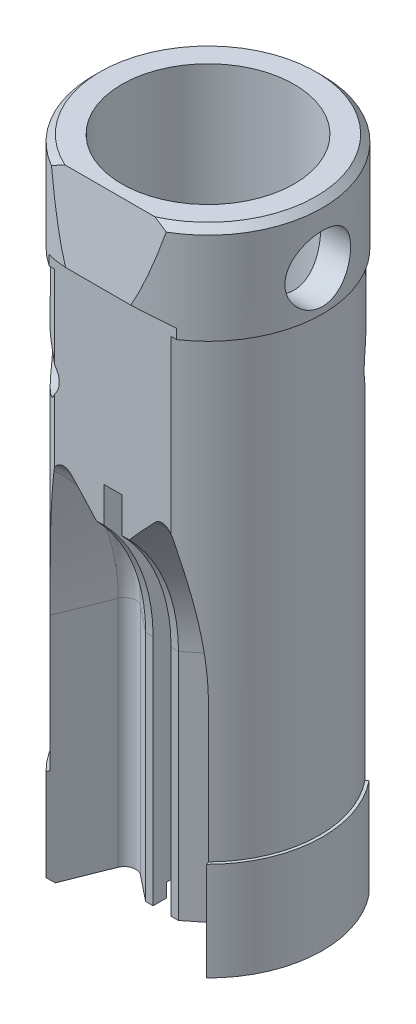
ISO-10303-21;
HEADER;
FILE_DESCRIPTION(('STEP AP214'),'2;1');
FILE_NAME('part.step','',(''),(''),'','','');
FILE_SCHEMA(('AUTOMOTIVE_DESIGN { 1 0 10303 214 1 1 1 1 }'));
ENDSEC;
DATA;
#1=APPLICATION_CONTEXT('core data for automotive mechanical design processes');
#2=APPLICATION_PROTOCOL_DEFINITION('international standard','automotive_design',2000,#1);
#3=PRODUCT_CONTEXT('',#1,'mechanical');
#4=PRODUCT('Part','Part','',(#3));
#5=PRODUCT_RELATED_PRODUCT_CATEGORY('part','',(#4));
#6=PRODUCT_DEFINITION_FORMATION('','',#4);
#7=PRODUCT_DEFINITION_CONTEXT('part definition',#1,'design');
#8=PRODUCT_DEFINITION('design','',#6,#7);
#9=PRODUCT_DEFINITION_SHAPE('','',#8);
#10=(LENGTH_UNIT() NAMED_UNIT(*) SI_UNIT(.MILLI.,.METRE.));
#11=(NAMED_UNIT(*) PLANE_ANGLE_UNIT() SI_UNIT($,.RADIAN.));
#12=(NAMED_UNIT(*) SI_UNIT($,.STERADIAN.) SOLID_ANGLE_UNIT());
#13=UNCERTAINTY_MEASURE_WITH_UNIT(LENGTH_MEASURE(1.E-05),#10,'distance_accuracy_value','');
#14=(GEOMETRIC_REPRESENTATION_CONTEXT(3) GLOBAL_UNCERTAINTY_ASSIGNED_CONTEXT((#13)) GLOBAL_UNIT_ASSIGNED_CONTEXT((#10,
#11,#12)) REPRESENTATION_CONTEXT('',''));
#15=CARTESIAN_POINT('',(0.,0.,0.));
#16=DIRECTION('',(0.,0.,1.));
#17=DIRECTION('',(1.,0.,0.));
#18=AXIS2_PLACEMENT_3D('',#15,#16,#17);
#19=CARTESIAN_POINT('',(0.,-73.3999999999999,-7.99999999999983));
#20=DIRECTION('',(0.,1.,0.));
#21=DIRECTION('',(-1.,0.,0.));
#22=AXIS2_PLACEMENT_3D('',#19,#20,#21);
#23=CYLINDRICAL_SURFACE('',#22,3.);
#24=CARTESIAN_POINT('',(0.,-95.8999999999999,-7.99999999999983));
#25=DIRECTION('',(0.,1.,0.));
#26=DIRECTION('',(-1.,0.,0.));
#27=AXIS2_PLACEMENT_3D('',#24,#25,#26);
#28=CIRCLE('',#27,3.);
#29=CARTESIAN_POINT('',(-2.99999999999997,-95.8999999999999,-7.99999999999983));
#30=VERTEX_POINT('',#29);
#31=EDGE_CURVE('E17',#30,#30,#28,.F.);
#32=ORIENTED_EDGE('',*,*,#31,.T.);
#33=EDGE_LOOP('',(#32));
#34=FACE_BOUND('',#33,.T.);
#35=CARTESIAN_POINT('',(0.,-50.8999999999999,-7.99999999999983));
#36=DIRECTION('',(0.,1.,0.));
#37=DIRECTION('',(-1.,0.,0.));
#38=AXIS2_PLACEMENT_3D('',#35,#36,#37);
#39=CIRCLE('',#38,3.);
#40=CARTESIAN_POINT('',(0.,-50.8999999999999,-4.99999999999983));
#41=VERTEX_POINT('',#40);
#42=EDGE_CURVE('E383',#41,#41,#39,.T.);
#43=ORIENTED_EDGE('',*,*,#42,.T.);
#44=EDGE_LOOP('',(#43));
#45=FACE_BOUND('',#44,.T.);
#46=ADVANCED_FACE('F14',(#34,#45),#23,.F.);
#47=CARTESIAN_POINT('',(0.,-95.8999999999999,-7.99999999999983));
#48=DIRECTION('',(0.,-1.,0.));
#49=DIRECTION('',(1.,0.,0.));
#50=AXIS2_PLACEMENT_3D('',#47,#48,#49);
#51=PLANE('',#50);
#52=ORIENTED_EDGE('',*,*,#31,.F.);
#53=EDGE_LOOP('',(#52));
#54=FACE_BOUND('',#53,.T.);
#55=CARTESIAN_POINT('',(0.,-95.8999999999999,-7.99999999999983));
#56=DIRECTION('',(0.,1.,0.));
#57=DIRECTION('',(-1.,0.,0.));
#58=AXIS2_PLACEMENT_3D('',#55,#56,#57);
#59=CIRCLE('',#58,1.45);
#60=CARTESIAN_POINT('',(-1.44999999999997,-95.8999999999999,-7.99999999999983));
#61=VERTEX_POINT('',#60);
#62=EDGE_CURVE('E261',#61,#61,#59,.F.);
#63=ORIENTED_EDGE('',*,*,#62,.T.);
#64=EDGE_LOOP('',(#63));
#65=FACE_BOUND('',#64,.T.);
#66=ADVANCED_FACE('F484',(#54,#65),#51,.F.);
#67=CARTESIAN_POINT('',(0.,-37.9999999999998,-7.99999999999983));
#68=DIRECTION('',(0.,1.,0.));
#69=DIRECTION('',(0.,0.,1.));
#70=AXIS2_PLACEMENT_3D('',#67,#68,#69);
#71=CONICAL_SURFACE('',#70,9.,0.4353532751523);
#72=CARTESIAN_POINT('',(0.,-37.9999999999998,-7.99999999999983));
#73=DIRECTION('',(0.,1.,0.));
#74=DIRECTION('',(0.,0.,1.));
#75=AXIS2_PLACEMENT_3D('',#72,#73,#74);
#76=CIRCLE('',#75,9.);
#77=CARTESIAN_POINT('',(0.,-37.9999999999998,1.00000000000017));
#78=VERTEX_POINT('',#77);
#79=EDGE_CURVE('E466',#78,#78,#76,.T.);
#80=CARTESIAN_POINT('',(0.,-50.8999999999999,-4.99999999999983));
#81=CARTESIAN_POINT('',(0.,-50.7656249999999,-4.93749999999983));
#82=CARTESIAN_POINT('',(0.,-50.6312499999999,-4.87499999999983));
#83=CARTESIAN_POINT('',(0.,-50.3624999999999,-4.74999999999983));
#84=CARTESIAN_POINT('',(0.,-50.2281249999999,-4.68749999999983));
#85=CARTESIAN_POINT('',(0.,-49.9593749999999,-4.56249999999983));
#86=CARTESIAN_POINT('',(0.,-49.8249999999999,-4.49999999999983));
#87=CARTESIAN_POINT('',(0.,-49.5562499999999,-4.37499999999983));
#88=CARTESIAN_POINT('',(0.,-49.4218749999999,-4.31249999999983));
#89=CARTESIAN_POINT('',(0.,-49.1531249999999,-4.18749999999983));
#90=CARTESIAN_POINT('',(0.,-49.0187499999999,-4.12499999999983));
#91=CARTESIAN_POINT('',(0.,-48.7499999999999,-3.99999999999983));
#92=CARTESIAN_POINT('',(0.,-48.6156249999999,-3.93749999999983));
#93=CARTESIAN_POINT('',(0.,-48.3468749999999,-3.81249999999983));
#94=CARTESIAN_POINT('',(0.,-48.2124999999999,-3.74999999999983));
#95=CARTESIAN_POINT('',(0.,-47.9437499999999,-3.62499999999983));
#96=CARTESIAN_POINT('',(0.,-47.8093749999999,-3.56249999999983));
#97=CARTESIAN_POINT('',(0.,-47.5406249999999,-3.43749999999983));
#98=CARTESIAN_POINT('',(0.,-47.4062499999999,-3.37499999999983));
#99=CARTESIAN_POINT('',(0.,-47.1374999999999,-3.24999999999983));
#100=CARTESIAN_POINT('',(0.,-47.0031249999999,-3.18749999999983));
#101=CARTESIAN_POINT('',(0.,-46.7343749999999,-3.06249999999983));
#102=CARTESIAN_POINT('',(0.,-46.5999999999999,-2.99999999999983));
#103=CARTESIAN_POINT('',(0.,-46.3312499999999,-2.87499999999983));
#104=CARTESIAN_POINT('',(0.,-46.1968749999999,-2.81249999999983));
#105=CARTESIAN_POINT('',(0.,-45.9281249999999,-2.68749999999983));
#106=CARTESIAN_POINT('',(0.,-45.7937499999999,-2.62499999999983));
#107=CARTESIAN_POINT('',(0.,-45.5249999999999,-2.49999999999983));
#108=CARTESIAN_POINT('',(0.,-45.3906249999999,-2.43749999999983));
#109=CARTESIAN_POINT('',(0.,-45.1218749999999,-2.31249999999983));
#110=CARTESIAN_POINT('',(0.,-44.9874999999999,-2.24999999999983));
#111=CARTESIAN_POINT('',(0.,-44.7187499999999,-2.12499999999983));
#112=CARTESIAN_POINT('',(0.,-44.5843749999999,-2.06249999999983));
#113=CARTESIAN_POINT('',(0.,-44.3156249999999,-1.93749999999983));
#114=CARTESIAN_POINT('',(0.,-44.1812499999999,-1.87499999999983));
#115=CARTESIAN_POINT('',(0.,-43.9124999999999,-1.74999999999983));
#116=CARTESIAN_POINT('',(0.,-43.7781249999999,-1.68749999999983));
#117=CARTESIAN_POINT('',(0.,-43.5093749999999,-1.56249999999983));
#118=CARTESIAN_POINT('',(0.,-43.3749999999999,-1.49999999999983));
#119=CARTESIAN_POINT('',(0.,-43.1062499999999,-1.37499999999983));
#120=CARTESIAN_POINT('',(0.,-42.9718749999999,-1.31249999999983));
#121=CARTESIAN_POINT('',(0.,-42.7031249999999,-1.18749999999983));
#122=CARTESIAN_POINT('',(0.,-42.5687499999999,-1.12499999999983));
#123=CARTESIAN_POINT('',(0.,-42.2999999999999,-0.999999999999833));
#124=CARTESIAN_POINT('',(0.,-42.1656249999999,-0.937499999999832));
#125=CARTESIAN_POINT('',(0.,-41.8968749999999,-0.812499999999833));
#126=CARTESIAN_POINT('',(0.,-41.7624999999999,-0.749999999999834));
#127=CARTESIAN_POINT('',(0.,-41.4937499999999,-0.624999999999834));
#128=CARTESIAN_POINT('',(0.,-41.3593749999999,-0.562499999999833));
#129=CARTESIAN_POINT('',(0.,-41.0906249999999,-0.437499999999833));
#130=CARTESIAN_POINT('',(0.,-40.9562499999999,-0.374999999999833));
#131=CARTESIAN_POINT('',(0.,-40.6874999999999,-0.249999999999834));
#132=CARTESIAN_POINT('',(0.,-40.5531249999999,-0.187499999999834));
#133=CARTESIAN_POINT('',(0.,-40.2843749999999,-0.0624999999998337));
#134=CARTESIAN_POINT('',(0.,-40.1499999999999,1.66872266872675E-13));
#135=CARTESIAN_POINT('',(0.,-39.8812499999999,0.125000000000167));
#136=CARTESIAN_POINT('',(0.,-39.7468749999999,0.187500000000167));
#137=CARTESIAN_POINT('',(0.,-39.4781249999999,0.312500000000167));
#138=CARTESIAN_POINT('',(0.,-39.3437499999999,0.375000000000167));
#139=CARTESIAN_POINT('',(0.,-39.0749999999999,0.500000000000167));
#140=CARTESIAN_POINT('',(0.,-38.9406249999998,0.562500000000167));
#141=CARTESIAN_POINT('',(0.,-38.6718749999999,0.687500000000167));
#142=CARTESIAN_POINT('',(0.,-38.5374999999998,0.750000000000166));
#143=CARTESIAN_POINT('',(0.,-38.2687499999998,0.875000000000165));
#144=CARTESIAN_POINT('',(0.,-38.1343749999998,0.937500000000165));
#145=CARTESIAN_POINT('',(0.,-37.9999999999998,1.00000000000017));
#146=B_SPLINE_CURVE_WITH_KNOTS('',3,(#80,#81,#82,#83,#84,#85,#86,#87,#88,#89,#90,#91,#92,#93,
#94,#95,#96,#97,#98,#99,#100,#101,#102,#103,#104,#105,#106,#107,#108,#109,#110,#111,#112,#113,
#114,#115,#116,#117,#118,#119,#120,#121,#122,#123,#124,#125,#126,#127,#128,#129,#130,#131,#132,
#133,#134,#135,#136,#137,#138,#139,#140,#141,#142,#143,#144,#145),.UNSPECIFIED.,.F.,.F.,(4,2,2,
2,2,2,2,2,2,2,2,2,2,2,2,2,2,2,2,2,2,2,2,2,2,2,2,2,2,2,2,2,4),(0.,0.44459646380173,
0.889192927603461,1.33378939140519,1.77838585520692,2.22298231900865,2.66757878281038,
3.11217524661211,3.55677171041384,4.00136817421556,4.44596463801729,4.89056110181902,
5.33515756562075,5.77975402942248,6.22435049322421,6.66894695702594,7.11354342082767,
7.5581398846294,8.00273634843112,8.44733281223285,8.89192927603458,9.33652573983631,
9.78112220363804,10.2257186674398,10.6703151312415,11.1149115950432,11.559508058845,
12.0041045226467,12.4487009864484,12.8932974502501,13.3378939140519,13.7824903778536,
14.2270868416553),.UNSPECIFIED.);
#147=EDGE_CURVE('BSEAM481',#41,#78,#146,.T.);
#148=ORIENTED_EDGE('',*,*,#42,.F.);
#149=ORIENTED_EDGE('',*,*,#79,.T.);
#150=ORIENTED_EDGE('',*,*,#147,.T.);
#151=ORIENTED_EDGE('',*,*,#147,.F.);
#152=EDGE_LOOP('',(#148,#150,#149,#151));
#153=FACE_BOUND('',#152,.T.);
#154=ADVANCED_FACE('F481',(#153),#71,.F.);
#155=CARTESIAN_POINT('',(-3.31469877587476E-13,-3044.,-7.99999999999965));
#156=DIRECTION('',(0.,1.,0.));
#157=DIRECTION('',(-1.,0.,0.));
#158=AXIS2_PLACEMENT_3D('',#155,#156,#157);
#159=CYLINDRICAL_SURFACE('',#158,1.45);
#160=CARTESIAN_POINT('',(0.,-96.8999999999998,-7.99999999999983));
#161=DIRECTION('',(0.,1.,0.));
#162=DIRECTION('',(-1.,0.,0.));
#163=AXIS2_PLACEMENT_3D('',#160,#161,#162);
#164=CIRCLE('',#163,1.45);
#165=CARTESIAN_POINT('',(-1.44999999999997,-96.8999999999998,-7.99999999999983));
#166=VERTEX_POINT('',#165);
#167=EDGE_CURVE('E317',#166,#166,#164,.F.);
#168=ORIENTED_EDGE('',*,*,#167,.T.);
#169=EDGE_LOOP('',(#168));
#170=FACE_BOUND('',#169,.T.);
#171=ORIENTED_EDGE('',*,*,#62,.F.);
#172=EDGE_LOOP('',(#171));
#173=FACE_BOUND('',#172,.T.);
#174=ADVANCED_FACE('F476',(#170,#173),#159,.F.);
#175=CARTESIAN_POINT('',(0.,-97.9999999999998,-7.99999999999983));
#176=DIRECTION('',(0.,1.,0.));
#177=DIRECTION('',(0.,0.,1.));
#178=AXIS2_PLACEMENT_3D('',#175,#176,#177);
#179=CONICAL_SURFACE('',#178,17.45,0.785398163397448);
#180=CARTESIAN_POINT('',(-11.8368869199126,-98.9999999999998,3.42324857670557));
#181=CARTESIAN_POINT('',(-11.9042449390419,-98.8338428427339,3.59268080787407));
#182=CARTESIAN_POINT('',(-11.9715167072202,-98.6674309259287,3.76189608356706));
#183=CARTESIAN_POINT('',(-12.105887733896,-98.3340975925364,4.0998927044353));
#184=CARTESIAN_POINT('',(-12.1729869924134,-98.1671761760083,4.26867404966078));
#185=CARTESIAN_POINT('',(-12.2399999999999,-97.9999999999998,4.43723843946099));
#186=B_SPLINE_CURVE_WITH_KNOTS('',3,(#180,#181,#182,#183,#184,#185),.UNSPECIFIED.,.F.,.F.,(4,2,
4),(0.,0.740047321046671,1.48009455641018),.UNSPECIFIED.);
#187=CARTESIAN_POINT('',(-11.8368869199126,-98.9999999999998,3.42324857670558));
#188=VERTEX_POINT('',#187);
#189=CARTESIAN_POINT('',(-12.2399999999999,-97.9999999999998,4.43723843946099));
#190=VERTEX_POINT('',#189);
#191=EDGE_CURVE('E260',#188,#190,#186,.T.);
#192=ORIENTED_EDGE('',*,*,#191,.T.);
#193=CARTESIAN_POINT('',(0.,-97.9999999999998,-7.99999999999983));
#194=DIRECTION('',(0.,-1.,0.));
#195=DIRECTION('',(1.,0.,0.));
#196=AXIS2_PLACEMENT_3D('',#193,#194,#195);
#197=CIRCLE('',#196,17.45);
#198=CARTESIAN_POINT('',(8.74599908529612,-97.9999999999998,-23.0999999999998));
#199=VERTEX_POINT('',#198);
#200=EDGE_CURVE('E258',#199,#190,#197,.F.);
#201=ORIENTED_EDGE('',*,*,#200,.F.);
#202=CARTESIAN_POINT('',(8.74599908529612,-97.9999999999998,-23.0999999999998));
#203=CARTESIAN_POINT('',(8.63588396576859,-98.1667566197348,-22.9710764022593));
#204=CARTESIAN_POINT('',(8.52574014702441,-98.3334682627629,-22.8421192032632));
#205=CARTESIAN_POINT('',(8.30539511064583,-98.6668015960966,-22.5841376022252));
#206=CARTESIAN_POINT('',(8.19519389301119,-98.8334232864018,-22.455113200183));
#207=CARTESIAN_POINT('',(8.08496397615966,-98.9999999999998,-22.326055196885));
#208=B_SPLINE_CURVE_WITH_KNOTS('',3,(#202,#203,#204,#205,#206,#207),.UNSPECIFIED.,.F.,.F.,(4,2,
4),(0.,0.713435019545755,1.42687004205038),.UNSPECIFIED.);
#209=CARTESIAN_POINT('',(8.08496397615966,-98.9999999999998,-22.326055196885));
#210=VERTEX_POINT('',#209);
#211=EDGE_CURVE('E249',#199,#210,#208,.T.);
#212=ORIENTED_EDGE('',*,*,#211,.T.);
#213=CARTESIAN_POINT('',(0.,-98.9999999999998,-7.99999999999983));
#214=DIRECTION('',(0.,1.,0.));
#215=DIRECTION('',(0.,0.,1.));
#216=AXIS2_PLACEMENT_3D('',#213,#214,#215);
#217=CIRCLE('',#216,16.45);
#218=EDGE_CURVE('E255',#188,#210,#217,.F.);
#219=ORIENTED_EDGE('',*,*,#218,.F.);
#220=EDGE_LOOP('',(#192,#201,#212,#219));
#221=FACE_BOUND('',#220,.T.);
#222=ADVANCED_FACE('F254',(#221),#179,.T.);
#223=CARTESIAN_POINT('',(-13.14,-37.9999999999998,-7.99999999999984));
#224=DIRECTION('',(0.,-1.,0.));
#225=DIRECTION('',(1.,0.,0.));
#226=AXIS2_PLACEMENT_3D('',#223,#224,#225);
#227=PLANE('',#226);
#228=CARTESIAN_POINT('',(0.,-37.9999999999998,-7.99999999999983));
#229=DIRECTION('',(0.,-1.,0.));
#230=DIRECTION('',(1.,0.,0.));
#231=AXIS2_PLACEMENT_3D('',#228,#229,#230);
#232=CIRCLE('',#231,13.14);
#233=CARTESIAN_POINT('',(13.14,-37.9999999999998,-7.99999999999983));
#234=VERTEX_POINT('',#233);
#235=EDGE_CURVE('E1070',#234,#234,#232,.F.);
#236=ORIENTED_EDGE('',*,*,#235,.T.);
#237=EDGE_LOOP('',(#236));
#238=FACE_BOUND('',#237,.T.);
#239=ORIENTED_EDGE('',*,*,#79,.F.);
#240=EDGE_LOOP('',(#239));
#241=FACE_BOUND('',#240,.T.);
#242=ADVANCED_FACE('F475',(#238,#241),#227,.F.);
#243=CARTESIAN_POINT('',(0.,0.,-7.99999999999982));
#244=DIRECTION('',(0.,1.,0.));
#245=DIRECTION('',(0.,0.,1.));
#246=AXIS2_PLACEMENT_3D('',#243,#244,#245);
#247=PLANE('',#246);
#248=CARTESIAN_POINT('',(0.,0.,-7.99999999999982));
#249=DIRECTION('',(0.,-1.,0.));
#250=DIRECTION('',(1.,0.,0.));
#251=AXIS2_PLACEMENT_3D('',#248,#249,#250);
#252=CIRCLE('',#251,16.45);
#253=CARTESIAN_POINT('',(-6.86294397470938,0.,6.95000000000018));
#254=VERTEX_POINT('',#253);
#255=CARTESIAN_POINT('',(6.86294397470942,0.,6.95000000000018));
#256=VERTEX_POINT('',#255);
#257=EDGE_CURVE('E505',#254,#256,#252,.T.);
#258=ORIENTED_EDGE('',*,*,#257,.F.);
#259=DIRECTION('',(1.,0.,0.));
#260=VECTOR('',#259,1.);
#261=CARTESIAN_POINT('',(-3.23433035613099,0.,6.95000000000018));
#262=LINE('',#261,#260);
#263=EDGE_CURVE('E379',#256,#254,#262,.F.);
#264=ORIENTED_EDGE('',*,*,#263,.F.);
#265=EDGE_LOOP('',(#258,#264));
#266=FACE_BOUND('',#265,.T.);
#267=CARTESIAN_POINT('',(0.,0.,-7.99999999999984));
#268=DIRECTION('',(0.,-1.,0.));
#269=DIRECTION('',(1.,0.,0.));
#270=AXIS2_PLACEMENT_3D('',#267,#268,#269);
#271=CIRCLE('',#270,13.14);
#272=CARTESIAN_POINT('',(13.14,0.,-7.99999999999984));
#273=VERTEX_POINT('',#272);
#274=EDGE_CURVE('E550',#273,#273,#271,.T.);
#275=ORIENTED_EDGE('',*,*,#274,.T.);
#276=EDGE_LOOP('',(#275));
#277=FACE_BOUND('',#276,.T.);
#278=ADVANCED_FACE('F532',(#266,#277),#247,.T.);
#279=CARTESIAN_POINT('',(22.45,-9.00000000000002,-7.99999999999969));
#280=DIRECTION('',(-1.,0.,0.));
#281=DIRECTION('',(0.,-1.,0.));
#282=AXIS2_PLACEMENT_3D('',#279,#280,#281);
#283=CYLINDRICAL_SURFACE('',#282,5.);
#284=CARTESIAN_POINT('',(16.7183282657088,-9.00000000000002,-2.99999999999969));
#285=CARTESIAN_POINT('',(16.7183285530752,-8.86281815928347,-3.00000037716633));
#286=CARTESIAN_POINT('',(16.7200213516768,-8.72562823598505,-3.00565052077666));
#287=CARTESIAN_POINT('',(16.7267416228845,-8.45220786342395,-3.02820446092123));
#288=CARTESIAN_POINT('',(16.7317704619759,-8.31597783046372,-3.04511286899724));
#289=CARTESIAN_POINT('',(16.7450172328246,-8.04532927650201,-3.09006652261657));
#290=CARTESIAN_POINT('',(16.7532396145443,-7.91091355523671,-3.11812730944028));
#291=CARTESIAN_POINT('',(16.772624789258,-7.64499478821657,-3.1851507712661));
#292=CARTESIAN_POINT('',(16.7837887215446,-7.51349289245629,-3.22411767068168));
#293=CARTESIAN_POINT('',(16.8086916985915,-7.25467466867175,-3.31251827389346));
#294=CARTESIAN_POINT('',(16.8224241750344,-7.127348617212,-3.36192532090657));
#295=CARTESIAN_POINT('',(16.8520822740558,-6.87735607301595,-3.47087143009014));
#296=CARTESIAN_POINT('',(16.8680087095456,-6.75469132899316,-3.53041424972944));
#297=CARTESIAN_POINT('',(16.9183986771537,-6.39502922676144,-3.72355082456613));
#298=CARTESIAN_POINT('',(16.9555054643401,-6.16604314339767,-3.8717628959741));
#299=CARTESIAN_POINT('',(17.0337477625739,-5.72991099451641,-4.20733561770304));
#300=CARTESIAN_POINT('',(17.074963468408,-5.52349617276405,-4.39562193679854));
#301=CARTESIAN_POINT('',(17.1561050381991,-5.14465200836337,-4.80408770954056));
#302=CARTESIAN_POINT('',(17.1960306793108,-4.9722285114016,-5.02427263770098));
#303=CARTESIAN_POINT('',(17.2709896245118,-4.6632332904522,-5.49535077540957));
#304=CARTESIAN_POINT('',(17.3059175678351,-4.52739170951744,-5.74674092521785));
#305=CARTESIAN_POINT('',(17.3660215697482,-4.30018420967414,-6.26996439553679));
#306=CARTESIAN_POINT('',(17.3911996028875,-4.20880928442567,-6.54179356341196));
#307=CARTESIAN_POINT('',(17.4284002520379,-4.07550567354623,-7.09060840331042));
#308=CARTESIAN_POINT('',(17.4407507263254,-4.0323424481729,-7.36727161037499));
#309=CARTESIAN_POINT('',(17.4520557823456,-3.99279183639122,-7.92417071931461));
#310=CARTESIAN_POINT('',(17.4510129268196,-3.99639550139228,-8.20440592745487));
#311=CARTESIAN_POINT('',(17.4358846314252,-4.04942828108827,-8.75185738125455));
#312=CARTESIAN_POINT('',(17.4221793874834,-4.09752161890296,-9.01921522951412));
#313=CARTESIAN_POINT('',(17.3837207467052,-4.23600621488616,-9.54190090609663));
#314=CARTESIAN_POINT('',(17.3589666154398,-4.32640028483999,-9.79722793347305));
#315=CARTESIAN_POINT('',(17.3006561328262,-4.54784222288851,-10.2918502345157));
#316=CARTESIAN_POINT('',(17.2670059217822,-4.67932648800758,-10.5309381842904));
#317=CARTESIAN_POINT('',(17.1944734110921,-4.97899755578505,-10.9841721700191));
#318=CARTESIAN_POINT('',(17.1555902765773,-5.14719021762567,-11.1983142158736));
#319=CARTESIAN_POINT('',(17.0956669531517,-5.42676479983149,-11.5002532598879));
#320=CARTESIAN_POINT('',(17.0750579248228,-5.5264651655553,-11.5992064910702));
#321=CARTESIAN_POINT('',(17.0340809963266,-5.73384953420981,-11.7883940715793));
#322=CARTESIAN_POINT('',(17.0137130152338,-5.84153076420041,-11.8786314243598));
#323=CARTESIAN_POINT('',(16.9737708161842,-6.06428699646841,-12.0498578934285));
#324=CARTESIAN_POINT('',(16.954197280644,-6.1793681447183,-12.1308391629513));
#325=CARTESIAN_POINT('',(16.9164294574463,-6.416063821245,-12.282878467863));
#326=CARTESIAN_POINT('',(16.898234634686,-6.53767578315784,-12.3539403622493));
#327=CARTESIAN_POINT('',(16.8635913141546,-6.78783037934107,-12.4862581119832));
#328=CARTESIAN_POINT('',(16.8471605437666,-6.9164267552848,-12.5474170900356));
#329=CARTESIAN_POINT('',(16.8167532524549,-7.17856465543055,-12.6586085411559));
#330=CARTESIAN_POINT('',(16.8027757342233,-7.31210414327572,-12.7086455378));
#331=CARTESIAN_POINT('',(16.7777307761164,-7.58299367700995,-12.7971202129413));
#332=CARTESIAN_POINT('',(16.7666585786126,-7.72033708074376,-12.8355768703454));
#333=CARTESIAN_POINT('',(16.7477584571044,-7.99796415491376,-12.9006364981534));
#334=CARTESIAN_POINT('',(16.7399290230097,-8.13824642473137,-12.9272449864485));
#335=CARTESIAN_POINT('',(16.7287156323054,-8.39865541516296,-12.9651681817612));
#336=CARTESIAN_POINT('',(16.7248285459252,-8.51851045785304,-12.9782217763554));
#337=CARTESIAN_POINT('',(16.7196347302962,-8.75890825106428,-12.9956378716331));
#338=CARTESIAN_POINT('',(16.7183280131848,-8.87945100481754,-13.0000003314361));
#339=CARTESIAN_POINT('',(16.7183285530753,-9.13718184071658,-12.9999996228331));
#340=CARTESIAN_POINT('',(16.7200213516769,-9.274371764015,-12.9943494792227));
#341=CARTESIAN_POINT('',(16.7267416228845,-9.5477921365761,-12.9717955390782));
#342=CARTESIAN_POINT('',(16.731770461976,-9.68402216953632,-12.9548871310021));
#343=CARTESIAN_POINT('',(16.7450172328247,-9.95467072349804,-12.9099334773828));
#344=CARTESIAN_POINT('',(16.7532396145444,-10.0890864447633,-12.8818726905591));
#345=CARTESIAN_POINT('',(16.7726247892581,-10.3550052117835,-12.8148492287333));
#346=CARTESIAN_POINT('',(16.7837887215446,-10.4865071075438,-12.7758823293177));
#347=CARTESIAN_POINT('',(16.8086916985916,-10.7453253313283,-12.6874817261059));
#348=CARTESIAN_POINT('',(16.8224241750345,-10.872651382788,-12.6380746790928));
#349=CARTESIAN_POINT('',(16.8520822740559,-11.1226439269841,-12.5291285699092));
#350=CARTESIAN_POINT('',(16.8680087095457,-11.2453086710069,-12.4695857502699));
#351=CARTESIAN_POINT('',(16.9183986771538,-11.6049707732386,-12.2764491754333));
#352=CARTESIAN_POINT('',(16.9555054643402,-11.8339568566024,-12.1282371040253));
#353=CARTESIAN_POINT('',(17.033747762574,-12.2700890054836,-11.7926643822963));
#354=CARTESIAN_POINT('',(17.0749634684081,-12.476503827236,-11.6043780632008));
#355=CARTESIAN_POINT('',(17.1561050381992,-12.8553479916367,-11.1959122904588));
#356=CARTESIAN_POINT('',(17.1960306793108,-13.0277714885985,-10.9757273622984));
#357=CARTESIAN_POINT('',(17.2709896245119,-13.3367667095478,-10.5046492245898));
#358=CARTESIAN_POINT('',(17.3059175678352,-13.4726082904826,-10.2532590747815));
#359=CARTESIAN_POINT('',(17.3660215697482,-13.6998157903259,-9.73003560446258));
#360=CARTESIAN_POINT('',(17.3911996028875,-13.7911907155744,-9.45820643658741));
#361=CARTESIAN_POINT('',(17.4284002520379,-13.9244943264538,-8.90939159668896));
#362=CARTESIAN_POINT('',(17.4407507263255,-13.9676575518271,-8.63272838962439));
#363=CARTESIAN_POINT('',(17.4520557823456,-14.0072081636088,-8.07582928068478));
#364=CARTESIAN_POINT('',(17.4510129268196,-14.0036044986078,-7.79559407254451));
#365=CARTESIAN_POINT('',(17.4358846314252,-13.9505717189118,-7.24814261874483));
#366=CARTESIAN_POINT('',(17.4221793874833,-13.9024783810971,-6.98078477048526));
#367=CARTESIAN_POINT('',(17.3837207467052,-13.7639937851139,-6.45809909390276));
#368=CARTESIAN_POINT('',(17.3589666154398,-13.6735997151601,-6.20277206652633));
#369=CARTESIAN_POINT('',(17.3006561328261,-13.4521577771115,-5.70814976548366));
#370=CARTESIAN_POINT('',(17.2670059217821,-13.3206735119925,-5.46906181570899));
#371=CARTESIAN_POINT('',(17.1944734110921,-13.021002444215,-5.01582782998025));
#372=CARTESIAN_POINT('',(17.1555902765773,-12.8528097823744,-4.80168578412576));
#373=CARTESIAN_POINT('',(17.0956669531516,-12.5732352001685,-4.49974674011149));
#374=CARTESIAN_POINT('',(17.0750579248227,-12.4735348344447,-4.40079350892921));
#375=CARTESIAN_POINT('',(17.0340809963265,-12.2661504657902,-4.21160592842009));
#376=CARTESIAN_POINT('',(17.0137130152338,-12.1584692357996,-4.12136857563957));
#377=CARTESIAN_POINT('',(16.9737708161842,-11.9357130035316,-3.95014210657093));
#378=CARTESIAN_POINT('',(16.9541972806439,-11.8206318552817,-3.86916083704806));
#379=CARTESIAN_POINT('',(16.9164294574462,-11.583936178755,-3.71712153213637));
#380=CARTESIAN_POINT('',(16.8982346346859,-11.4623242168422,-3.64605963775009));
#381=CARTESIAN_POINT('',(16.8635913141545,-11.212169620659,-3.51374188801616));
#382=CARTESIAN_POINT('',(16.8471605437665,-11.0835732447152,-3.4525829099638));
#383=CARTESIAN_POINT('',(16.8167532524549,-10.8214353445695,-3.34139145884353));
#384=CARTESIAN_POINT('',(16.8027757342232,-10.6878958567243,-3.29135446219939));
#385=CARTESIAN_POINT('',(16.7777307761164,-10.4170063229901,-3.20287978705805));
#386=CARTESIAN_POINT('',(16.7666585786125,-10.2796629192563,-3.16442312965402));
#387=CARTESIAN_POINT('',(16.7477584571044,-10.0020358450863,-3.099363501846));
#388=CARTESIAN_POINT('',(16.7399290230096,-9.86175357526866,-3.07275501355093));
#389=CARTESIAN_POINT('',(16.7287156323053,-9.60134458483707,-3.03483181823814));
#390=CARTESIAN_POINT('',(16.7248285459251,-9.48148954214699,-3.02177822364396));
#391=CARTESIAN_POINT('',(16.7196347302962,-9.24109174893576,-3.0043621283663));
#392=CARTESIAN_POINT('',(16.7183280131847,-9.1205489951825,-2.99999966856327));
#393=CARTESIAN_POINT('',(16.7183282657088,-9.00000000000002,-2.99999999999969));
#394=B_SPLINE_CURVE_WITH_KNOTS('',3,(#284,#285,#286,#287,#288,#289,#290,#291,#292,#293,#294,
#295,#296,#297,#298,#299,#300,#301,#302,#303,#304,#305,#306,#307,#308,#309,#310,#311,#312,#313,
#314,#315,#316,#317,#318,#319,#320,#321,#322,#323,#324,#325,#326,#327,#328,#329,#330,#331,#332,
#333,#334,#335,#336,#337,#338,#339,#340,#341,#342,#343,#344,#345,#346,#347,#348,#349,#350,#351,
#352,#353,#354,#355,#356,#357,#358,#359,#360,#361,#362,#363,#364,#365,#366,#367,#368,#369,#370,
#371,#372,#373,#374,#375,#376,#377,#378,#379,#380,#381,#382,#383,#384,#385,#386,#387,#388,#389,
#390,#391,#392,#393),.UNSPECIFIED.,.T.,.F.,(4,2,2,2,2,2,2,2,2,2,2,2,2,2,2,2,2,2,2,2,2,2,2,2,2,2,
2,2,2,2,2,2,2,2,2,2,2,2,2,2,2,2,2,2,2,2,2,2,2,2,2,2,2,2,4),(0.,0.411433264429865,
0.823035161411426,1.23521266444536,1.64755004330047,2.05884705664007,2.47029687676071,
3.29218641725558,4.1356543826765,4.97926727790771,5.83864416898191,6.69784692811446,
7.53450448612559,8.37100195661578,9.18317180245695,9.9953956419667,10.8165569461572,
11.637849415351,12.0633636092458,12.4887306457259,12.9144556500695,13.3400145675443,
13.7695133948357,14.1988372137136,14.6274535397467,15.0558700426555,15.4174166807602,
15.7789650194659,16.1903982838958,16.6020001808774,17.0141776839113,17.4265150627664,
17.837812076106,18.2492618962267,19.0711514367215,19.9146194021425,20.7582322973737,
21.6176091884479,22.4768119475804,23.3134695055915,24.1499669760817,24.9621368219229,
25.7743606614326,26.5955219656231,27.416814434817,27.8423286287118,28.2676956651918,
28.6934206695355,29.1189795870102,29.5484784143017,29.9778022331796,30.4064185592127,
30.8348350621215,31.1963817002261,31.5579300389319),.UNSPECIFIED.);
#395=CARTESIAN_POINT('',(16.7183282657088,-9.00000000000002,-2.99999999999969));
#396=VERTEX_POINT('',#395);
#397=EDGE_CURVE('E543',#396,#396,#394,.T.);
#398=ORIENTED_EDGE('',*,*,#397,.F.);
#399=EDGE_LOOP('',(#398));
#400=FACE_BOUND('',#399,.T.);
#401=CARTESIAN_POINT('',(13.14,-14.,-7.99999999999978));
#402=CARTESIAN_POINT('',(13.140002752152,-14.0000035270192,-7.86482547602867));
#403=CARTESIAN_POINT('',(13.1379107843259,-13.9945162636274,-7.72968854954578));
#404=CARTESIAN_POINT('',(13.1296057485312,-13.9726310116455,-7.4603884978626));
#405=CARTESIAN_POINT('',(13.1233920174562,-13.9562312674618,-7.32622553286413));
#406=CARTESIAN_POINT('',(13.1070030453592,-13.9126706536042,-7.0598429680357));
#407=CARTESIAN_POINT('',(13.0968258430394,-13.8855044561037,-6.92762436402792));
#408=CARTESIAN_POINT('',(13.0727777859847,-13.8206664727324,-6.66608265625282));
#409=CARTESIAN_POINT('',(13.0589055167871,-13.7829906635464,-6.53676068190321));
#410=CARTESIAN_POINT('',(13.0278714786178,-13.6975965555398,-6.28228566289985));
#411=CARTESIAN_POINT('',(13.0107189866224,-13.6499065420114,-6.15712200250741));
#412=CARTESIAN_POINT('',(12.9735370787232,-13.544829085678,-5.91135961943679));
#413=CARTESIAN_POINT('',(12.953506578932,-13.487437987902,-5.79076263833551));
#414=CARTESIAN_POINT('',(12.8898369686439,-13.301387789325,-5.43701206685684));
#415=CARTESIAN_POINT('',(12.8425886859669,-13.1587696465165,-5.21165585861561));
#416=CARTESIAN_POINT('',(12.7410968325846,-12.8341396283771,-4.77889146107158));
#417=CARTESIAN_POINT('',(12.6866514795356,-12.6508012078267,-4.57253497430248));
#418=CARTESIAN_POINT('',(12.5778250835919,-12.2524861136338,-4.1925065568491));
#419=CARTESIAN_POINT('',(12.5234440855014,-12.0374939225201,-4.01885075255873));
#420=CARTESIAN_POINT('',(12.4453209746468,-11.6906925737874,-3.78326811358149));
#421=CARTESIAN_POINT('',(12.419390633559,-11.5684272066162,-3.70769377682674));
#422=CARTESIAN_POINT('',(12.3699328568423,-11.3174871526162,-3.56717923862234));
#423=CARTESIAN_POINT('',(12.3464044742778,-11.1888150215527,-3.502234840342));
#424=CARTESIAN_POINT('',(12.3025336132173,-10.9260056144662,-3.38358658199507));
#425=CARTESIAN_POINT('',(12.2821883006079,-10.7918733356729,-3.32987270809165));
#426=CARTESIAN_POINT('',(12.2453578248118,-10.5190357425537,-3.23413868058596));
#427=CARTESIAN_POINT('',(12.2288716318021,-10.3803316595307,-3.19211540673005));
#428=CARTESIAN_POINT('',(12.1941501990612,-10.038186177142,-3.10454890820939));
#429=CARTESIAN_POINT('',(12.1782712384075,-9.8328192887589,-3.06541983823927));
#430=CARTESIAN_POINT('',(12.1569630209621,-9.41827080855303,-3.01315014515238));
#431=CARTESIAN_POINT('',(12.1515322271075,-9.2090897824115,-3.00000569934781));
#432=CARTESIAN_POINT('',(12.151523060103,-8.86522357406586,-2.99999632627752));
#433=CARTESIAN_POINT('',(12.1537736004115,-8.73048505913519,-3.00545169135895));
#434=CARTESIAN_POINT('',(12.1626918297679,-8.46199342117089,-3.02720618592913));
#435=CARTESIAN_POINT('',(12.1693602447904,-8.32824046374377,-3.04350709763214));
#436=CARTESIAN_POINT('',(12.1869020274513,-8.06268778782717,-3.08679746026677));
#437=CARTESIAN_POINT('',(12.1977777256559,-7.93088919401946,-3.11379283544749));
#438=CARTESIAN_POINT('',(12.223384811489,-7.67019862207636,-3.17820941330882));
#439=CARTESIAN_POINT('',(12.2381177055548,-7.54130780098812,-3.21563468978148));
#440=CARTESIAN_POINT('',(12.2709268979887,-7.28775108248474,-3.30042453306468));
#441=CARTESIAN_POINT('',(12.2889920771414,-7.16307271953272,-3.34775611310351));
#442=CARTESIAN_POINT('',(12.3279628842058,-6.91824490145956,-3.45203038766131));
#443=CARTESIAN_POINT('',(12.3488695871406,-6.79809718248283,-3.50897672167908));
#444=CARTESIAN_POINT('',(12.4149705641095,-6.44558571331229,-3.69358630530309));
#445=CARTESIAN_POINT('',(12.4635768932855,-6.22092563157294,-3.83509694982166));
#446=CARTESIAN_POINT('',(12.5671321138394,-5.78757196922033,-4.1585266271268));
#447=CARTESIAN_POINT('',(12.622270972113,-5.58010937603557,-4.34202071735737));
#448=CARTESIAN_POINT('',(12.7311443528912,-5.19789168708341,-4.7411352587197));
#449=CARTESIAN_POINT('',(12.7848783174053,-5.02314942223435,-4.95676825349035));
#450=CARTESIAN_POINT('',(12.8611039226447,-4.78642339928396,-5.30436539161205));
#451=CARTESIAN_POINT('',(12.8861781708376,-4.71066655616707,-5.42660651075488));
#452=CARTESIAN_POINT('',(12.9337540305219,-4.56978650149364,-5.67752776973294));
#453=CARTESIAN_POINT('',(12.9562566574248,-4.50465908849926,-5.80620533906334));
#454=CARTESIAN_POINT('',(12.9980257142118,-4.38565521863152,-6.06903689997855));
#455=CARTESIAN_POINT('',(13.017294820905,-4.33176944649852,-6.20318624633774));
#456=CARTESIAN_POINT('',(13.0520522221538,-4.23570940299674,-6.47603903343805));
#457=CARTESIAN_POINT('',(13.0675414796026,-4.19353214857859,-6.61474130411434));
#458=CARTESIAN_POINT('',(13.1001717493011,-4.10538218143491,-6.95770779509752));
#459=CARTESIAN_POINT('',(13.1150291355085,-4.06593746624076,-7.16391137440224));
#460=CARTESIAN_POINT('',(13.1349405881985,-4.01325054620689,-7.58010713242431));
#461=CARTESIAN_POINT('',(13.1399957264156,-4.00000547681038,-7.79009889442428));
#462=CARTESIAN_POINT('',(13.140002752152,-3.9999964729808,-8.13517452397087));
#463=CARTESIAN_POINT('',(13.1379107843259,-4.0054837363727,-8.27031145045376));
#464=CARTESIAN_POINT('',(13.1296057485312,-4.02736898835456,-8.53961150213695));
#465=CARTESIAN_POINT('',(13.1233920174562,-4.04376873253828,-8.67377446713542));
#466=CARTESIAN_POINT('',(13.1070030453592,-4.08732934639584,-8.94015703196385));
#467=CARTESIAN_POINT('',(13.0968258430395,-4.11449554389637,-9.07237563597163));
#468=CARTESIAN_POINT('',(13.0727777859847,-4.17933352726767,-9.33391734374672));
#469=CARTESIAN_POINT('',(13.0589055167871,-4.2170093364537,-9.46323931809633));
#470=CARTESIAN_POINT('',(13.0278714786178,-4.30240344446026,-9.71771433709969));
#471=CARTESIAN_POINT('',(13.0107189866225,-4.35009345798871,-9.84287799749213));
#472=CARTESIAN_POINT('',(12.9735370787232,-4.45517091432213,-10.0886403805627));
#473=CARTESIAN_POINT('',(12.953506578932,-4.51256201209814,-10.209237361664));
#474=CARTESIAN_POINT('',(12.889836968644,-4.69861221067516,-10.5629879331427));
#475=CARTESIAN_POINT('',(12.8425886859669,-4.84123035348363,-10.7883441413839));
#476=CARTESIAN_POINT('',(12.7410968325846,-5.16586037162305,-11.2211085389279));
#477=CARTESIAN_POINT('',(12.6866514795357,-5.34919879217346,-11.427465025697));
#478=CARTESIAN_POINT('',(12.577825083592,-5.74751388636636,-11.8074934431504));
#479=CARTESIAN_POINT('',(12.5234440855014,-5.9625060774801,-11.9811492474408));
#480=CARTESIAN_POINT('',(12.4453209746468,-6.30930742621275,-12.216731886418));
#481=CARTESIAN_POINT('',(12.4193906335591,-6.43157279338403,-12.2923062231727));
#482=CARTESIAN_POINT('',(12.3699328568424,-6.68251284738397,-12.4328207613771));
#483=CARTESIAN_POINT('',(12.3464044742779,-6.81118497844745,-12.4977651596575));
#484=CARTESIAN_POINT('',(12.3025336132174,-7.07399438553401,-12.6164134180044));
#485=CARTESIAN_POINT('',(12.282188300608,-7.20812666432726,-12.6701272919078));
#486=CARTESIAN_POINT('',(12.2453578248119,-7.48096425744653,-12.7658613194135));
#487=CARTESIAN_POINT('',(12.2288716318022,-7.61966834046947,-12.8078845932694));
#488=CARTESIAN_POINT('',(12.1941501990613,-7.96181382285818,-12.89545109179));
#489=CARTESIAN_POINT('',(12.1782712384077,-8.16718071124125,-12.9345801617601));
#490=CARTESIAN_POINT('',(12.1569630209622,-8.58172919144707,-12.986849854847));
#491=CARTESIAN_POINT('',(12.1515322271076,-8.79091021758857,-12.9999943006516));
#492=CARTESIAN_POINT('',(12.1515230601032,-9.13477642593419,-13.0000036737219));
#493=CARTESIAN_POINT('',(12.1537736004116,-9.26951494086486,-12.9945483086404));
#494=CARTESIAN_POINT('',(12.162691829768,-9.53800657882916,-12.9727938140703));
#495=CARTESIAN_POINT('',(12.1693602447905,-9.67175953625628,-12.9564929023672));
#496=CARTESIAN_POINT('',(12.1869020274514,-9.93731221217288,-12.9132025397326));
#497=CARTESIAN_POINT('',(12.197777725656,-10.0691108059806,-12.8862071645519));
#498=CARTESIAN_POINT('',(12.2233848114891,-10.3298013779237,-12.8217905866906));
#499=CARTESIAN_POINT('',(12.2381177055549,-10.4586921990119,-12.7843653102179));
#500=CARTESIAN_POINT('',(12.2709268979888,-10.7122489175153,-12.6995754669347));
#501=CARTESIAN_POINT('',(12.2889920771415,-10.8369272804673,-12.6522438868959));
#502=CARTESIAN_POINT('',(12.3279628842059,-11.0817550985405,-12.5479696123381));
#503=CARTESIAN_POINT('',(12.3488695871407,-11.2019028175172,-12.4910232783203));
#504=CARTESIAN_POINT('',(12.4149705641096,-11.5544142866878,-12.3064136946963));
#505=CARTESIAN_POINT('',(12.4635768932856,-11.7790743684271,-12.1649030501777));
#506=CARTESIAN_POINT('',(12.5671321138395,-12.2124280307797,-11.8414733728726));
#507=CARTESIAN_POINT('',(12.6222709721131,-12.4198906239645,-11.657979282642));
#508=CARTESIAN_POINT('',(12.7311443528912,-12.8021083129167,-11.2588647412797));
#509=CARTESIAN_POINT('',(12.7848783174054,-12.9768505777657,-11.043231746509));
#510=CARTESIAN_POINT('',(12.8611039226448,-13.2135766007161,-10.6956346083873));
#511=CARTESIAN_POINT('',(12.8861781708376,-13.289333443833,-10.5733934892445));
#512=CARTESIAN_POINT('',(12.9337540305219,-13.4302134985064,-10.3224722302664));
#513=CARTESIAN_POINT('',(12.9562566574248,-13.4953409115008,-10.193794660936));
#514=CARTESIAN_POINT('',(12.9980257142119,-13.6143447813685,-9.93096310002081));
#515=CARTESIAN_POINT('',(13.017294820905,-13.6682305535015,-9.79681375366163));
#516=CARTESIAN_POINT('',(13.0520522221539,-13.7642905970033,-9.52396096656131));
#517=CARTESIAN_POINT('',(13.0675414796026,-13.8064678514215,-9.38525869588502));
#518=CARTESIAN_POINT('',(13.1001717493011,-13.8946178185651,-9.04229220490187));
#519=CARTESIAN_POINT('',(13.1150291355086,-13.9340625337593,-8.83608862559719));
#520=CARTESIAN_POINT('',(13.1349405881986,-13.9867494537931,-8.41989286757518));
#521=CARTESIAN_POINT('',(13.1399957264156,-13.9999945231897,-8.20990110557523));
#522=CARTESIAN_POINT('',(13.14,-14.,-7.99999999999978));
#523=B_SPLINE_CURVE_WITH_KNOTS('',3,(#401,#402,#403,#404,#405,#406,#407,#408,#409,#410,#411,
#412,#413,#414,#415,#416,#417,#418,#419,#420,#421,#422,#423,#424,#425,#426,#427,#428,#429,#430,
#431,#432,#433,#434,#435,#436,#437,#438,#439,#440,#441,#442,#443,#444,#445,#446,#447,#448,#449,
#450,#451,#452,#453,#454,#455,#456,#457,#458,#459,#460,#461,#462,#463,#464,#465,#466,#467,#468,
#469,#470,#471,#472,#473,#474,#475,#476,#477,#478,#479,#480,#481,#482,#483,#484,#485,#486,#487,
#488,#489,#490,#491,#492,#493,#494,#495,#496,#497,#498,#499,#500,#501,#502,#503,#504,#505,#506,
#507,#508,#509,#510,#511,#512,#513,#514,#515,#516,#517,#518,#519,#520,#521,#522),.UNSPECIFIED.,
.T.,.F.,(4,2,2,2,2,2,2,2,2,2,2,2,2,2,2,2,2,2,2,2,2,2,2,2,2,2,2,2,2,2,2,2,2,2,2,2,2,2,2,2,2,2,2,
2,2,2,2,2,2,2,2,2,2,2,2,2,2,2,2,2,4),(0.,0.405331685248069,0.810728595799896,1.21632636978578,
1.62207962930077,2.0267018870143,2.43147693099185,3.24026105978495,4.08079149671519,
4.92173536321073,5.35945350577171,5.79699841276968,6.23415149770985,6.67118779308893,
7.29824860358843,7.92521715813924,8.32935254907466,8.7335543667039,9.13798040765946,
9.54256463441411,9.94582248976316,10.3492333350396,11.1553356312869,11.998982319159,
12.8429591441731,13.2804472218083,13.7177619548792,14.1547128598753,14.5915523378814,
15.2210265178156,15.8504318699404,16.2557635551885,16.6611604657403,17.0667582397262,
17.4725114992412,17.8771337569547,18.2819088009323,19.0906929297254,19.9312233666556,
20.7721672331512,21.2098853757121,21.6474302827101,22.0845833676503,22.5216196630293,
23.1486804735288,23.7756490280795,24.1797844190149,24.5839862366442,24.9884122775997,
25.3929965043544,25.7962543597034,26.1996652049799,27.0057675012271,27.8494141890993,
28.6933910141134,29.1308790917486,29.5681938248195,30.0051447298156,30.4419842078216,
31.0714583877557,31.7008637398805),.UNSPECIFIED.);
#524=CARTESIAN_POINT('',(13.14,-14.,-7.99999999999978));
#525=VERTEX_POINT('',#524);
#526=EDGE_CURVE('E536',#525,#525,#523,.T.);
#527=ORIENTED_EDGE('',*,*,#526,.T.);
#528=EDGE_LOOP('',(#527));
#529=FACE_BOUND('',#528,.T.);
#530=ADVANCED_FACE('F528',(#400,#529),#283,.F.);
#531=CARTESIAN_POINT('',(0.,-1.00000000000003,-7.99999999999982));
#532=DIRECTION('',(0.,-1.,0.));
#533=DIRECTION('',(1.,0.,0.));
#534=AXIS2_PLACEMENT_3D('',#531,#532,#533);
#535=CONICAL_SURFACE('',#534,17.45,0.785398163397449);
#536=CARTESIAN_POINT('',(8.74280107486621,-0.999999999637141,7.1018518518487));
#537=CARTESIAN_POINT('',(8.58909317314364,-0.911341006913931,7.08838881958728));
#538=CARTESIAN_POINT('',(8.43469020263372,-0.823852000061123,7.07510345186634));
#539=CARTESIAN_POINT('',(8.12447352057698,-0.651475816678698,7.04892780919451));
#540=CARTESIAN_POINT('',(7.96866029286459,-0.566587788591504,7.03603740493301));
#541=CARTESIAN_POINT('',(7.65549572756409,-0.399613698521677,7.0106820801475));
#542=CARTESIAN_POINT('',(7.4981443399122,-0.317527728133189,6.99821717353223));
#543=CARTESIAN_POINT('',(7.18178853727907,-0.156402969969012,6.97375008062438));
#544=CARTESIAN_POINT('',(7.02278359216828,-0.077365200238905,6.96174804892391));
#545=CARTESIAN_POINT('',(6.86294397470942,0.,6.95000000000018));
#546=B_SPLINE_CURVE_WITH_KNOTS('',3,(#536,#537,#538,#539,#540,#541,#542,#543,#544,#545),
.UNSPECIFIED.,.F.,.F.,(4,2,2,2,4),(0.,0.533863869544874,1.06755104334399,1.60125564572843,
2.13513697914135),.UNSPECIFIED.);
#547=CARTESIAN_POINT('',(8.74280107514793,-0.999999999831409,7.10185185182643));
#548=VERTEX_POINT('',#547);
#549=EDGE_CURVE('E382',#548,#256,#546,.T.);
#550=ORIENTED_EDGE('',*,*,#549,.F.);
#551=CARTESIAN_POINT('',(0.,-1.00000000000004,-7.99999999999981));
#552=DIRECTION('',(0.,-1.,0.));
#553=DIRECTION('',(1.,0.,0.));
#554=AXIS2_PLACEMENT_3D('',#551,#552,#553);
#555=CIRCLE('',#554,17.45);
#556=CARTESIAN_POINT('',(-8.74280107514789,-0.999999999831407,7.10185185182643));
#557=VERTEX_POINT('',#556);
#558=EDGE_CURVE('E769',#557,#548,#555,.T.);
#559=ORIENTED_EDGE('',*,*,#558,.F.);
#560=CARTESIAN_POINT('',(-6.86294397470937,0.,6.95000000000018));
#561=CARTESIAN_POINT('',(-7.02278359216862,-0.0773652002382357,6.96174804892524));
#562=CARTESIAN_POINT('',(-7.18178853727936,-0.156402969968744,6.97375008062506));
#563=CARTESIAN_POINT('',(-7.49814433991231,-0.317527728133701,6.99821717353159));
#564=CARTESIAN_POINT('',(-7.65549572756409,-0.399613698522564,7.0106820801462));
#565=CARTESIAN_POINT('',(-7.96866029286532,-0.566587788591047,7.03603740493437));
#566=CARTESIAN_POINT('',(-8.12447352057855,-0.651475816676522,7.04892780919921));
#567=CARTESIAN_POINT('',(-8.43469020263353,-0.82385200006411,7.07510345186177));
#568=CARTESIAN_POINT('',(-8.58909317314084,-0.911341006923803,7.08838881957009));
#569=CARTESIAN_POINT('',(-8.7428010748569,-0.999999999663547,7.10185185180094));
#570=B_SPLINE_CURVE_WITH_KNOTS('',3,(#560,#561,#562,#563,#564,#565,#566,#567,#568,#569),
.UNSPECIFIED.,.F.,.F.,(4,2,2,2,4),(0.,0.533881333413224,1.06758593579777,1.60127310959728,
2.13513697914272),.UNSPECIFIED.);
#571=EDGE_CURVE('E378',#254,#557,#570,.T.);
#572=ORIENTED_EDGE('',*,*,#571,.F.);
#573=ORIENTED_EDGE('',*,*,#257,.T.);
#574=EDGE_LOOP('',(#550,#559,#572,#573));
#575=FACE_BOUND('',#574,.T.);
#576=ADVANCED_FACE('F524',(#575),#535,.T.);
#577=CARTESIAN_POINT('',(-3.23433035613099,-6.75000000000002,7.97500000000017));
#578=DIRECTION('',(0.,0.15013078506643,0.988666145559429));
#579=DIRECTION('',(0.,-0.988666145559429,0.15013078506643));
#580=AXIS2_PLACEMENT_3D('',#577,#578,#579);
#581=PLANE('',#580);
#582=ORIENTED_EDGE('',*,*,#571,.T.);
#583=CARTESIAN_POINT('',(0.,98.4512195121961,-7.99999999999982));
#584=DIRECTION('',(0.,0.15013078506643,0.988666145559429));
#585=DIRECTION('',(0.,-0.988666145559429,0.15013078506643));
#586=AXIS2_PLACEMENT_3D('',#583,#584,#585);
#587=ELLIPSE('',#586,116.231990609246,17.45);
#588=CARTESIAN_POINT('',(-4.9635231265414,-11.7166446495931,8.72919418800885));
#589=VERTEX_POINT('',#588);
#590=EDGE_CURVE('E551',#589,#557,#587,.F.);
#591=ORIENTED_EDGE('',*,*,#590,.F.);
#592=DIRECTION('',(1.,0.,0.));
#593=VECTOR('',#592,1.);
#594=CARTESIAN_POINT('',(3.93732142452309,-11.7166446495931,8.72919418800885));
#595=LINE('',#594,#593);
#596=CARTESIAN_POINT('',(4.96352312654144,-11.7166446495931,8.72919418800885));
#597=VERTEX_POINT('',#596);
#598=EDGE_CURVE('E761',#589,#597,#595,.T.);
#599=ORIENTED_EDGE('',*,*,#598,.T.);
#600=CARTESIAN_POINT('',(0.,98.4512195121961,-7.99999999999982));
#601=DIRECTION('',(0.,0.15013078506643,0.988666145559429));
#602=DIRECTION('',(0.,-0.988666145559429,0.15013078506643));
#603=AXIS2_PLACEMENT_3D('',#600,#601,#602);
#604=ELLIPSE('',#603,116.231990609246,17.45);
#605=EDGE_CURVE('E764',#548,#597,#604,.F.);
#606=ORIENTED_EDGE('',*,*,#605,.F.);
#607=ORIENTED_EDGE('',*,*,#549,.T.);
#608=ORIENTED_EDGE('',*,*,#263,.T.);
#609=EDGE_LOOP('',(#582,#591,#599,#606,#607,#608));
#610=FACE_BOUND('',#609,.T.);
#611=ADVANCED_FACE('F521',(#610),#581,.T.);
#612=CARTESIAN_POINT('',(1.93500000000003,-63.4999999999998,25.5000000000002));
#613=DIRECTION('',(1.,0.,0.));
#614=DIRECTION('',(0.,1.,0.));
#615=AXIS2_PLACEMENT_3D('',#612,#613,#614);
#616=CYLINDRICAL_SURFACE('',#615,26.5);
#617=CARTESIAN_POINT('',(1.37000000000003,-63.4999999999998,25.5000000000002));
#618=DIRECTION('',(1.,0.,0.));
#619=DIRECTION('',(0.,1.,0.));
#620=AXIS2_PLACEMENT_3D('',#617,#618,#619);
#621=CIRCLE('',#620,26.5);
#622=CARTESIAN_POINT('',(1.37000000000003,-45.0270467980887,6.50000000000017));
#623=VERTEX_POINT('',#622);
#624=CARTESIAN_POINT('',(1.37000000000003,-63.4999999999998,-0.999999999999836));
#625=VERTEX_POINT('',#624);
#626=EDGE_CURVE('E752',#623,#625,#621,.F.);
#627=ORIENTED_EDGE('',*,*,#626,.T.);
#628=DIRECTION('',(1.,0.,0.));
#629=VECTOR('',#628,1.);
#630=CARTESIAN_POINT('',(1.37000000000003,-63.4999999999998,-0.999999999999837));
#631=LINE('',#630,#629);
#632=CARTESIAN_POINT('',(2.49999999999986,-63.4999999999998,-1.00000000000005));
#633=VERTEX_POINT('',#632);
#634=EDGE_CURVE('E347',#625,#633,#631,.T.);
#635=ORIENTED_EDGE('',*,*,#634,.T.);
#636=CARTESIAN_POINT('',(2.49999999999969,-63.4999999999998,25.5000000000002));
#637=DIRECTION('',(1.,0.,0.));
#638=DIRECTION('',(0.,0.,-1.));
#639=AXIS2_PLACEMENT_3D('',#636,#637,#638);
#640=CIRCLE('',#639,26.5000000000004);
#641=CARTESIAN_POINT('',(2.49999999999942,-45.0270467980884,6.50000000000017));
#642=VERTEX_POINT('',#641);
#643=EDGE_CURVE('E323',#633,#642,#640,.T.);
#644=ORIENTED_EDGE('',*,*,#643,.T.);
#645=DIRECTION('',(1.,0.,0.));
#646=VECTOR('',#645,1.);
#647=CARTESIAN_POINT('',(1.93500000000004,-45.0270467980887,6.50000000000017));
#648=LINE('',#647,#646);
#649=EDGE_CURVE('E374',#623,#642,#648,.T.);
#650=ORIENTED_EDGE('',*,*,#649,.F.);
#651=EDGE_LOOP('',(#627,#635,#644,#650));
#652=FACE_BOUND('',#651,.T.);
#653=ADVANCED_FACE('F832',(#652),#616,.F.);
#654=CARTESIAN_POINT('',(1.37000000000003,-98.9999999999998,-0.999999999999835));
#655=DIRECTION('',(0.,0.,-1.));
#656=DIRECTION('',(0.,1.,0.));
#657=AXIS2_PLACEMENT_3D('',#654,#655,#656);
#658=PLANE('',#657);
#659=DIRECTION('',(0.,1.,0.));
#660=VECTOR('',#659,1.);
#661=CARTESIAN_POINT('',(1.37000000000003,-98.9999999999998,-0.999999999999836));
#662=LINE('',#661,#660);
#663=CARTESIAN_POINT('',(1.37000000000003,-98.9999999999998,-0.999999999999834));
#664=VERTEX_POINT('',#663);
#665=EDGE_CURVE('E309',#625,#664,#662,.F.);
#666=ORIENTED_EDGE('',*,*,#665,.T.);
#667=DIRECTION('',(1.,0.,0.));
#668=VECTOR('',#667,1.);
#669=CARTESIAN_POINT('',(1.37000000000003,-98.9999999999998,-0.999999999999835));
#670=LINE('',#669,#668);
#671=CARTESIAN_POINT('',(2.50000000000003,-98.9999999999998,-0.999999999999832));
#672=VERTEX_POINT('',#671);
#673=EDGE_CURVE('E369',#672,#664,#670,.F.);
#674=ORIENTED_EDGE('',*,*,#673,.F.);
#675=DIRECTION('',(0.,1.,0.));
#676=VECTOR('',#675,1.);
#677=CARTESIAN_POINT('',(2.50000000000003,-98.9999999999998,-0.999999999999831));
#678=LINE('',#677,#676);
#679=EDGE_CURVE('E291',#672,#633,#678,.T.);
#680=ORIENTED_EDGE('',*,*,#679,.T.);
#681=ORIENTED_EDGE('',*,*,#634,.F.);
#682=EDGE_LOOP('',(#666,#674,#680,#681));
#683=FACE_BOUND('',#682,.T.);
#684=ADVANCED_FACE('F829',(#683),#658,.F.);
#685=CARTESIAN_POINT('',(-1.36999999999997,-98.9999999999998,-4.99999999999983));
#686=DIRECTION('',(0.,0.,-1.));
#687=DIRECTION('',(0.,1.,0.));
#688=AXIS2_PLACEMENT_3D('',#685,#686,#687);
#689=PLANE('',#688);
#690=DIRECTION('',(0.,1.,0.));
#691=VECTOR('',#690,1.);
#692=CARTESIAN_POINT('',(1.37000000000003,-98.9999999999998,-4.99999999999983));
#693=LINE('',#692,#691);
#694=CARTESIAN_POINT('',(1.37000000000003,-96.8999999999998,-4.99999999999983));
#695=VERTEX_POINT('',#694);
#696=CARTESIAN_POINT('',(1.37000000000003,-63.4999999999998,-4.99999999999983));
#697=VERTEX_POINT('',#696);
#698=EDGE_CURVE('E308',#695,#697,#693,.T.);
#699=ORIENTED_EDGE('',*,*,#698,.T.);
#700=DIRECTION('',(1.,0.,0.));
#701=VECTOR('',#700,1.);
#702=CARTESIAN_POINT('',(-1.36999999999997,-63.4999999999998,-4.99999999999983));
#703=LINE('',#702,#701);
#704=CARTESIAN_POINT('',(-1.36999999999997,-63.4999999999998,-4.99999999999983));
#705=VERTEX_POINT('',#704);
#706=EDGE_CURVE('E1047',#697,#705,#703,.F.);
#707=ORIENTED_EDGE('',*,*,#706,.T.);
#708=DIRECTION('',(0.,1.,0.));
#709=VECTOR('',#708,1.);
#710=CARTESIAN_POINT('',(-1.36999999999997,-98.9999999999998,-4.99999999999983));
#711=LINE('',#710,#709);
#712=CARTESIAN_POINT('',(-1.36999999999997,-96.8999999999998,-4.99999999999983));
#713=VERTEX_POINT('',#712);
#714=EDGE_CURVE('E366',#705,#713,#711,.F.);
#715=ORIENTED_EDGE('',*,*,#714,.T.);
#716=DIRECTION('',(1.,0.,0.));
#717=VECTOR('',#716,1.);
#718=CARTESIAN_POINT('',(-1.36999999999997,-96.8999999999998,-4.99999999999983));
#719=LINE('',#718,#717);
#720=EDGE_CURVE('E312',#713,#695,#719,.T.);
#721=ORIENTED_EDGE('',*,*,#720,.T.);
#722=EDGE_LOOP('',(#699,#707,#715,#721));
#723=FACE_BOUND('',#722,.T.);
#724=ADVANCED_FACE('F825',(#723),#689,.F.);
#725=CARTESIAN_POINT('',(-2.49999999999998,-98.9999999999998,-0.999999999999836));
#726=DIRECTION('',(0.,0.,-1.));
#727=DIRECTION('',(0.,1.,0.));
#728=AXIS2_PLACEMENT_3D('',#725,#726,#727);
#729=PLANE('',#728);
#730=DIRECTION('',(0.,1.,0.));
#731=VECTOR('',#730,1.);
#732=CARTESIAN_POINT('',(-2.49999999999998,-98.9999999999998,-0.999999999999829));
#733=LINE('',#732,#731);
#734=CARTESIAN_POINT('',(-2.49999999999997,-63.4999999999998,-0.999999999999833));
#735=VERTEX_POINT('',#734);
#736=CARTESIAN_POINT('',(-2.49999999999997,-98.9999999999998,-0.99999999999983));
#737=VERTEX_POINT('',#736);
#738=EDGE_CURVE('E337',#735,#737,#733,.F.);
#739=ORIENTED_EDGE('',*,*,#738,.T.);
#740=DIRECTION('',(1.,0.,0.));
#741=VECTOR('',#740,1.);
#742=CARTESIAN_POINT('',(0.,-98.9999999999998,-0.999999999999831));
#743=LINE('',#742,#741);
#744=CARTESIAN_POINT('',(-1.36999999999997,-98.9999999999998,-0.999999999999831));
#745=VERTEX_POINT('',#744);
#746=EDGE_CURVE('E359',#745,#737,#743,.F.);
#747=ORIENTED_EDGE('',*,*,#746,.F.);
#748=DIRECTION('',(0.,-1.,0.));
#749=VECTOR('',#748,1.);
#750=CARTESIAN_POINT('',(-1.36999999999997,-98.9999999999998,-0.999999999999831));
#751=LINE('',#750,#749);
#752=CARTESIAN_POINT('',(-1.36999999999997,-63.4999999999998,-0.999999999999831));
#753=VERTEX_POINT('',#752);
#754=EDGE_CURVE('E353',#745,#753,#751,.F.);
#755=ORIENTED_EDGE('',*,*,#754,.T.);
#756=DIRECTION('',(1.,0.,0.));
#757=VECTOR('',#756,1.);
#758=CARTESIAN_POINT('',(-1.93499999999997,-63.4999999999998,-0.999999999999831));
#759=LINE('',#758,#757);
#760=EDGE_CURVE('E344',#753,#735,#759,.F.);
#761=ORIENTED_EDGE('',*,*,#760,.T.);
#762=EDGE_LOOP('',(#739,#747,#755,#761));
#763=FACE_BOUND('',#762,.T.);
#764=ADVANCED_FACE('F821',(#763),#729,.F.);
#765=CARTESIAN_POINT('',(-1.93499999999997,-63.4999999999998,25.5000000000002));
#766=DIRECTION('',(1.,0.,0.));
#767=DIRECTION('',(0.,1.,0.));
#768=AXIS2_PLACEMENT_3D('',#765,#766,#767);
#769=CYLINDRICAL_SURFACE('',#768,26.5);
#770=CARTESIAN_POINT('',(-2.49999999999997,-63.4999999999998,25.5000000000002));
#771=DIRECTION('',(-1.,0.,0.));
#772=DIRECTION('',(0.,0.,-1.));
#773=AXIS2_PLACEMENT_3D('',#770,#771,#772);
#774=CIRCLE('',#773,26.5);
#775=CARTESIAN_POINT('',(-2.49999999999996,-45.0270467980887,6.50000000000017));
#776=VERTEX_POINT('',#775);
#777=EDGE_CURVE('E334',#776,#735,#774,.T.);
#778=ORIENTED_EDGE('',*,*,#777,.T.);
#779=ORIENTED_EDGE('',*,*,#760,.F.);
#780=CARTESIAN_POINT('',(-1.36999999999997,-63.4999999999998,25.5000000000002));
#781=DIRECTION('',(1.,0.,0.));
#782=DIRECTION('',(0.,1.,0.));
#783=AXIS2_PLACEMENT_3D('',#780,#781,#782);
#784=CIRCLE('',#783,26.5);
#785=CARTESIAN_POINT('',(-1.36999999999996,-45.0270467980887,6.50000000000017));
#786=VERTEX_POINT('',#785);
#787=EDGE_CURVE('E858',#753,#786,#784,.T.);
#788=ORIENTED_EDGE('',*,*,#787,.T.);
#789=DIRECTION('',(1.,0.,0.));
#790=VECTOR('',#789,1.);
#791=CARTESIAN_POINT('',(-1.93499999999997,-45.0270467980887,6.50000000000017));
#792=LINE('',#791,#790);
#793=EDGE_CURVE('E340',#776,#786,#792,.T.);
#794=ORIENTED_EDGE('',*,*,#793,.F.);
#795=EDGE_LOOP('',(#778,#779,#788,#794));
#796=FACE_BOUND('',#795,.T.);
#797=ADVANCED_FACE('F814',(#796),#769,.F.);
#798=CARTESIAN_POINT('',(-6.45568954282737,-98.9999999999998,-4.15424914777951));
#799=DIRECTION('',(0.623452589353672,0.,-0.781861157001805));
#800=DIRECTION('',(-0.781861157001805,0.,-0.623452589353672));
#801=AXIS2_PLACEMENT_3D('',#798,#799,#800);
#802=PLANE('',#801);
#803=DIRECTION('',(0.,1.,0.));
#804=VECTOR('',#803,1.);
#805=CARTESIAN_POINT('',(-6.45568954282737,-98.9999999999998,-4.15424914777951));
#806=LINE('',#805,#804);
#807=CARTESIAN_POINT('',(-6.45568954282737,-63.4999999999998,-4.15424914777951));
#808=VERTEX_POINT('',#807);
#809=CARTESIAN_POINT('',(-6.45568954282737,-98.9999999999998,-4.15424914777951));
#810=VERTEX_POINT('',#809);
#811=EDGE_CURVE('E273',#808,#810,#806,.F.);
#812=ORIENTED_EDGE('',*,*,#811,.T.);
#813=DIRECTION('',(-0.781861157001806,0.,-0.623452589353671));
#814=VECTOR('',#813,1.);
#815=CARTESIAN_POINT('',(-2.49999999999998,-98.9999999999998,-0.999999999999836));
#816=LINE('',#815,#814);
#817=EDGE_CURVE('E362',#737,#810,#816,.T.);
#818=ORIENTED_EDGE('',*,*,#817,.F.);
#819=ORIENTED_EDGE('',*,*,#738,.F.);
#820=DIRECTION('',(0.781861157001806,0.,0.623452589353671));
#821=VECTOR('',#820,1.);
#822=CARTESIAN_POINT('',(-4.47784477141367,-63.4999999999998,-2.57712457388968));
#823=LINE('',#822,#821);
#824=EDGE_CURVE('E330',#735,#808,#823,.F.);
#825=ORIENTED_EDGE('',*,*,#824,.T.);
#826=EDGE_LOOP('',(#812,#818,#819,#825));
#827=FACE_BOUND('',#826,.T.);
#828=ADVANCED_FACE('F805',(#827),#802,.F.);
#829=CARTESIAN_POINT('',(-5.14999999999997,-96.8999999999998,-7.99999999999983));
#830=DIRECTION('',(0.,1.,0.));
#831=DIRECTION('',(0.,0.,1.));
#832=AXIS2_PLACEMENT_3D('',#829,#830,#831);
#833=PLANE('',#832);
#834=DIRECTION('',(0.649461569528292,0.,-0.760394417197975));
#835=VECTOR('',#834,1.);
#836=CARTESIAN_POINT('',(5.04301334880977,-96.8999999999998,-9.04427791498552));
#837=LINE('',#836,#835);
#838=CARTESIAN_POINT('',(5.04301334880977,-96.8999999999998,-9.04427791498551));
#839=VERTEX_POINT('',#838);
#840=CARTESIAN_POINT('',(5.42803984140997,-96.8999999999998,-9.49506978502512));
#841=VERTEX_POINT('',#840);
#842=EDGE_CURVE('E295',#839,#841,#837,.T.);
#843=ORIENTED_EDGE('',*,*,#842,.F.);
#844=CARTESIAN_POINT('',(0.,-96.8999999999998,-7.99999999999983));
#845=DIRECTION('',(0.,1.,0.));
#846=DIRECTION('',(-1.,0.,0.));
#847=AXIS2_PLACEMENT_3D('',#844,#845,#846);
#848=CIRCLE('',#847,5.15);
#849=CARTESIAN_POINT('',(1.37000000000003,-96.8999999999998,-3.03556649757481));
#850=VERTEX_POINT('',#849);
#851=EDGE_CURVE('E290',#839,#850,#848,.F.);
#852=ORIENTED_EDGE('',*,*,#851,.T.);
#853=DIRECTION('',(0.,0.,1.));
#854=VECTOR('',#853,1.);
#855=CARTESIAN_POINT('',(1.37000000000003,-96.8999999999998,-4.99999999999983));
#856=LINE('',#855,#854);
#857=EDGE_CURVE('E305',#850,#695,#856,.F.);
#858=ORIENTED_EDGE('',*,*,#857,.T.);
#859=ORIENTED_EDGE('',*,*,#720,.F.);
#860=DIRECTION('',(0.,0.,1.));
#861=VECTOR('',#860,1.);
#862=CARTESIAN_POINT('',(-1.36999999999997,-96.8999999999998,-0.999999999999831));
#863=LINE('',#862,#861);
#864=CARTESIAN_POINT('',(-1.36999999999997,-96.8999999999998,-3.03556649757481));
#865=VERTEX_POINT('',#864);
#866=EDGE_CURVE('E358',#713,#865,#863,.T.);
#867=ORIENTED_EDGE('',*,*,#866,.T.);
#868=CARTESIAN_POINT('',(0.,-96.8999999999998,-7.99999999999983));
#869=DIRECTION('',(0.,1.,0.));
#870=DIRECTION('',(-1.,0.,0.));
#871=AXIS2_PLACEMENT_3D('',#868,#869,#870);
#872=CIRCLE('',#871,5.15);
#873=CARTESIAN_POINT('',(0.242702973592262,-96.8999999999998,-13.1442779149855));
#874=VERTEX_POINT('',#873);
#875=EDGE_CURVE('E294',#865,#874,#872,.F.);
#876=ORIENTED_EDGE('',*,*,#875,.T.);
#877=DIRECTION('',(-0.649461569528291,0.,0.760394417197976));
#878=VECTOR('',#877,1.);
#879=CARTESIAN_POINT('',(0.627729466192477,-96.8999999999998,-13.5950697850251));
#880=LINE('',#879,#878);
#881=CARTESIAN_POINT('',(0.627729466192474,-96.8999999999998,-13.5950697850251));
#882=VERTEX_POINT('',#881);
#883=EDGE_CURVE('E315',#882,#874,#880,.T.);
#884=ORIENTED_EDGE('',*,*,#883,.F.);
#885=DIRECTION('',(0.760394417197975,0.,0.649461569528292));
#886=VECTOR('',#885,1.);
#887=CARTESIAN_POINT('',(5.42803984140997,-96.8999999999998,-9.49506978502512));
#888=LINE('',#887,#886);
#889=EDGE_CURVE('E628',#882,#841,#888,.T.);
#890=ORIENTED_EDGE('',*,*,#889,.T.);
#891=EDGE_LOOP('',(#843,#852,#858,#859,#867,#876,#884,#890));
#892=FACE_BOUND('',#891,.T.);
#893=ORIENTED_EDGE('',*,*,#167,.F.);
#894=EDGE_LOOP('',(#893));
#895=FACE_BOUND('',#894,.T.);
#896=ADVANCED_FACE('F802',(#892,#895),#833,.F.);
#897=CARTESIAN_POINT('',(2.50000000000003,-98.9999999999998,-0.999999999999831));
#898=DIRECTION('',(-0.623567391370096,0.,-0.781769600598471));
#899=DIRECTION('',(-0.781769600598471,0.,0.623567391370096));
#900=AXIS2_PLACEMENT_3D('',#897,#898,#899);
#901=PLANE('',#900);
#902=ORIENTED_EDGE('',*,*,#679,.F.);
#903=DIRECTION('',(-0.781769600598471,0.,0.623567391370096));
#904=VECTOR('',#903,1.);
#905=CARTESIAN_POINT('',(6.4324941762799,-98.9999999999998,-4.1366979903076));
#906=LINE('',#905,#904);
#907=CARTESIAN_POINT('',(6.43249417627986,-98.9999999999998,-4.13669799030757));
#908=VERTEX_POINT('',#907);
#909=EDGE_CURVE('E617',#908,#672,#906,.T.);
#910=ORIENTED_EDGE('',*,*,#909,.F.);
#911=DIRECTION('',(0.,1.,0.));
#912=VECTOR('',#911,1.);
#913=CARTESIAN_POINT('',(6.4324941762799,-98.9999999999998,-4.1366979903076));
#914=LINE('',#913,#912);
#915=CARTESIAN_POINT('',(6.43249417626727,-63.4999999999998,-4.1366979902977));
#916=VERTEX_POINT('',#915);
#917=EDGE_CURVE('E298',#908,#916,#914,.T.);
#918=ORIENTED_EDGE('',*,*,#917,.T.);
#919=DIRECTION('',(-0.781769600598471,0.,0.623567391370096));
#920=VECTOR('',#919,1.);
#921=CARTESIAN_POINT('',(4.46624708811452,-63.4999999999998,-2.56834899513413));
#922=LINE('',#921,#920);
#923=EDGE_CURVE('E320',#916,#633,#922,.T.);
#924=ORIENTED_EDGE('',*,*,#923,.T.);
#925=EDGE_LOOP('',(#902,#910,#918,#924));
#926=FACE_BOUND('',#925,.T.);
#927=ADVANCED_FACE('F804',(#926),#901,.F.);
#928=CARTESIAN_POINT('',(0.,-104.15,-7.99999999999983));
#929=DIRECTION('',(0.,1.,0.));
#930=DIRECTION('',(-1.,0.,0.));
#931=AXIS2_PLACEMENT_3D('',#928,#929,#930);
#932=CYLINDRICAL_SURFACE('',#931,5.15);
#933=ORIENTED_EDGE('',*,*,#875,.F.);
#934=DIRECTION('',(0.,-1.,0.));
#935=VECTOR('',#934,1.);
#936=CARTESIAN_POINT('',(-1.36999999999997,-98.9999999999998,-3.03556649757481));
#937=LINE('',#936,#935);
#938=CARTESIAN_POINT('',(-1.36999999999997,-98.9999999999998,-3.03556649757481));
#939=VERTEX_POINT('',#938);
#940=EDGE_CURVE('E354',#865,#939,#937,.T.);
#941=ORIENTED_EDGE('',*,*,#940,.T.);
#942=CARTESIAN_POINT('',(0.,-98.9999999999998,-7.99999999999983));
#943=DIRECTION('',(0.,1.,0.));
#944=DIRECTION('',(-1.,0.,0.));
#945=AXIS2_PLACEMENT_3D('',#942,#943,#944);
#946=CIRCLE('',#945,5.15);
#947=CARTESIAN_POINT('',(0.24270297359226,-98.9999999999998,-13.1442779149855));
#948=VERTEX_POINT('',#947);
#949=EDGE_CURVE('E272',#948,#939,#946,.T.);
#950=ORIENTED_EDGE('',*,*,#949,.F.);
#951=DIRECTION('',(0.,1.,0.));
#952=VECTOR('',#951,1.);
#953=CARTESIAN_POINT('',(0.242702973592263,-98.9999999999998,-13.1442779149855));
#954=LINE('',#953,#952);
#955=EDGE_CURVE('E278',#948,#874,#954,.T.);
#956=ORIENTED_EDGE('',*,*,#955,.T.);
#957=EDGE_LOOP('',(#933,#941,#950,#956));
#958=FACE_BOUND('',#957,.T.);
#959=ADVANCED_FACE('F811',(#958),#932,.F.);
#960=CARTESIAN_POINT('',(0.,-91.4999999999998,-7.99999999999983));
#961=DIRECTION('',(0.,-1.,0.));
#962=DIRECTION('',(1.,0.,0.));
#963=AXIS2_PLACEMENT_3D('',#960,#961,#962);
#964=CYLINDRICAL_SURFACE('',#963,17.45);
#965=CARTESIAN_POINT('',(0.,-83.9999999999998,-7.99999999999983));
#966=DIRECTION('',(0.,-1.,0.));
#967=DIRECTION('',(1.,0.,0.));
#968=AXIS2_PLACEMENT_3D('',#965,#966,#967);
#969=CIRCLE('',#968,17.45);
#970=CARTESIAN_POINT('',(8.74599908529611,-83.9999999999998,-23.0999999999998));
#971=VERTEX_POINT('',#970);
#972=CARTESIAN_POINT('',(-12.2399999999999,-83.9999999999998,4.43723843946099));
#973=VERTEX_POINT('',#972);
#974=EDGE_CURVE('E909',#971,#973,#969,.F.);
#975=ORIENTED_EDGE('',*,*,#974,.F.);
#976=DIRECTION('',(0.,1.,0.));
#977=VECTOR('',#976,1.);
#978=CARTESIAN_POINT('',(8.74599908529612,-98.9999999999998,-23.0999999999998));
#979=LINE('',#978,#977);
#980=EDGE_CURVE('E279',#971,#199,#979,.F.);
#981=ORIENTED_EDGE('',*,*,#980,.T.);
#982=ORIENTED_EDGE('',*,*,#200,.T.);
#983=DIRECTION('',(0.,1.,0.));
#984=VECTOR('',#983,1.);
#985=CARTESIAN_POINT('',(-12.2399999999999,-98.9999999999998,4.43723843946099));
#986=LINE('',#985,#984);
#987=EDGE_CURVE('E907',#190,#973,#986,.T.);
#988=ORIENTED_EDGE('',*,*,#987,.T.);
#989=EDGE_LOOP('',(#975,#981,#982,#988));
#990=FACE_BOUND('',#989,.T.);
#991=ADVANCED_FACE('F1005',(#990),#964,.T.);
#992=CARTESIAN_POINT('',(-7.49999999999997,-98.9999999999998,-2.74999999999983));
#993=DIRECTION('',(0.,1.,0.));
#994=DIRECTION('',(-1.,0.,0.));
#995=AXIS2_PLACEMENT_3D('',#992,#993,#994);
#996=CYLINDRICAL_SURFACE('',#995,1.75);
#997=DIRECTION('',(0.,1.,0.));
#998=VECTOR('',#997,1.);
#999=CARTESIAN_POINT('',(-9.11060810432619,-98.9999999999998,-3.43442788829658));
#1000=LINE('',#999,#998);
#1001=CARTESIAN_POINT('',(-9.11060810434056,-63.4999999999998,-3.43442788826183));
#1002=VERTEX_POINT('',#1001);
#1003=CARTESIAN_POINT('',(-9.11060810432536,-98.9999999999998,-3.43442788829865));
#1004=VERTEX_POINT('',#1003);
#1005=EDGE_CURVE('E775',#1002,#1004,#1000,.F.);
#1006=ORIENTED_EDGE('',*,*,#1005,.T.);
#1007=CARTESIAN_POINT('',(-7.49999999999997,-98.9999999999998,-2.74999999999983));
#1008=DIRECTION('',(0.,1.,0.));
#1009=DIRECTION('',(-1.,0.,0.));
#1010=AXIS2_PLACEMENT_3D('',#1007,#1008,#1009);
#1011=CIRCLE('',#1010,1.75);
#1012=EDGE_CURVE('E788',#810,#1004,#1011,.T.);
#1013=ORIENTED_EDGE('',*,*,#1012,.F.);
#1014=ORIENTED_EDGE('',*,*,#811,.F.);
#1015=CARTESIAN_POINT('',(-7.49999999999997,-63.4999999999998,-2.74999999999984));
#1016=DIRECTION('',(0.,1.,0.));
#1017=DIRECTION('',(0.,0.,-1.));
#1018=AXIS2_PLACEMENT_3D('',#1015,#1016,#1017);
#1019=CIRCLE('',#1018,1.75);
#1020=EDGE_CURVE('E780',#808,#1002,#1019,.T.);
#1021=ORIENTED_EDGE('',*,*,#1020,.T.);
#1022=EDGE_LOOP('',(#1006,#1013,#1014,#1021));
#1023=FACE_BOUND('',#1022,.T.);
#1024=ADVANCED_FACE('F881',(#1023),#996,.F.);
#1025=CARTESIAN_POINT('',(0.,-98.9999999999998,-7.99999999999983));
#1026=DIRECTION('',(0.,-1.,0.));
#1027=DIRECTION('',(1.,0.,0.));
#1028=AXIS2_PLACEMENT_3D('',#1025,#1026,#1027);
#1029=PLANE('',#1028);
#1030=ORIENTED_EDGE('',*,*,#1012,.T.);
#1031=DIRECTION('',(-0.369428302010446,0.,0.929259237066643));
#1032=VECTOR('',#1031,1.);
#1033=CARTESIAN_POINT('',(-12.2399999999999,-98.9999999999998,4.43723843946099));
#1034=LINE('',#1033,#1032);
#1035=EDGE_CURVE('E271',#1004,#188,#1034,.T.);
#1036=ORIENTED_EDGE('',*,*,#1035,.T.);
#1037=ORIENTED_EDGE('',*,*,#218,.T.);
#1038=DIRECTION('',(-0.649461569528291,0.,0.760394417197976));
#1039=VECTOR('',#1038,1.);
#1040=CARTESIAN_POINT('',(0.242702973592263,-98.9999999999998,-13.1442779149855));
#1041=LINE('',#1040,#1039);
#1042=EDGE_CURVE('E268',#210,#948,#1041,.T.);
#1043=ORIENTED_EDGE('',*,*,#1042,.T.);
#1044=ORIENTED_EDGE('',*,*,#949,.T.);
#1045=DIRECTION('',(0.,0.,1.));
#1046=VECTOR('',#1045,1.);
#1047=CARTESIAN_POINT('',(-1.36999999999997,-98.9999999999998,-0.999999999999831));
#1048=LINE('',#1047,#1046);
#1049=EDGE_CURVE('E350',#939,#745,#1048,.T.);
#1050=ORIENTED_EDGE('',*,*,#1049,.T.);
#1051=ORIENTED_EDGE('',*,*,#746,.T.);
#1052=ORIENTED_EDGE('',*,*,#817,.T.);
#1053=EDGE_LOOP('',(#1030,#1036,#1037,#1043,#1044,#1050,#1051,#1052));
#1054=FACE_BOUND('',#1053,.T.);
#1055=ADVANCED_FACE('F266',(#1054),#1029,.T.);
#1056=CARTESIAN_POINT('',(0.,5.14000000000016,-7.99999999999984));
#1057=DIRECTION('',(0.,-1.,0.));
#1058=DIRECTION('',(1.,0.,0.));
#1059=AXIS2_PLACEMENT_3D('',#1056,#1057,#1058);
#1060=CYLINDRICAL_SURFACE('',#1059,13.14);
#1061=ORIENTED_EDGE('',*,*,#526,.F.);
#1062=EDGE_LOOP('',(#1061));
#1063=FACE_BOUND('',#1062,.T.);
#1064=ORIENTED_EDGE('',*,*,#274,.F.);
#1065=EDGE_LOOP('',(#1064));
#1066=FACE_BOUND('',#1065,.T.);
#1067=CARTESIAN_POINT('',(-8.93602460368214,-33.3592290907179,1.63364231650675));
#1068=CARTESIAN_POINT('',(-8.85983284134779,-33.3592290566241,1.70431663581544));
#1069=CARTESIAN_POINT('',(-8.78279996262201,-33.354963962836,1.77408572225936));
#1070=CARTESIAN_POINT('',(-8.62760430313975,-33.3379241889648,1.91134603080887));
#1071=CARTESIAN_POINT('',(-8.5494411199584,-33.3251464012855,1.97883641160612));
#1072=CARTESIAN_POINT('',(-8.39253591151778,-33.2911574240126,2.11115647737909));
#1073=CARTESIAN_POINT('',(-8.31379331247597,-33.2699363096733,2.17598293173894));
#1074=CARTESIAN_POINT('',(-8.15643617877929,-33.21922462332,2.30254095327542));
#1075=CARTESIAN_POINT('',(-8.07782170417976,-33.189730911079,2.36427133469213));
#1076=CARTESIAN_POINT('',(-7.92157998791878,-33.1227846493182,2.48417094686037));
#1077=CARTESIAN_POINT('',(-7.84395090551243,-33.0853503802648,2.5423479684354));
#1078=CARTESIAN_POINT('',(-7.69014671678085,-33.0027778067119,2.65506251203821));
#1079=CARTESIAN_POINT('',(-7.61397216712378,-32.9576366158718,2.70959865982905));
#1080=CARTESIAN_POINT('',(-7.38865502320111,-32.8111437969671,2.86742272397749));
#1081=CARTESIAN_POINT('',(-7.24257532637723,-32.6986613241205,2.9650353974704));
#1082=CARTESIAN_POINT('',(-6.96094182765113,-32.4445288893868,3.14601429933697));
#1083=CARTESIAN_POINT('',(-6.82569130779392,-32.3022902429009,3.22901875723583));
#1084=CARTESIAN_POINT('',(-6.57450530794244,-31.9940186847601,3.37790785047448));
#1085=CARTESIAN_POINT('',(-6.45854532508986,-31.8280164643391,3.44381426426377));
#1086=CARTESIAN_POINT('',(-6.29383577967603,-31.5496692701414,3.5348193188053));
#1087=CARTESIAN_POINT('',(-6.23717986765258,-31.4436890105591,3.56549538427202));
#1088=CARTESIAN_POINT('',(-6.13282828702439,-31.2259265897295,3.62116669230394));
#1089=CARTESIAN_POINT('',(-6.08513306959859,-31.1141441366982,3.64616164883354));
#1090=CARTESIAN_POINT('',(-6.00644239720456,-30.9043481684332,3.68691067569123));
#1091=CARTESIAN_POINT('',(-5.97399328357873,-30.8070378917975,3.70350581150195));
#1092=CARTESIAN_POINT('',(-5.9163251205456,-30.609723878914,3.73276369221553));
#1093=CARTESIAN_POINT('',(-5.89110527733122,-30.5097204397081,3.74542686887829));
#1094=CARTESIAN_POINT('',(-5.84817998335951,-30.3075585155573,3.76685888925));
#1095=CARTESIAN_POINT('',(-5.83048488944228,-30.2053972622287,3.77562236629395));
#1096=CARTESIAN_POINT('',(-5.80289324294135,-29.9998133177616,3.78924371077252));
#1097=CARTESIAN_POINT('',(-5.79299330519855,-29.8963911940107,3.79410327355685));
#1098=CARTESIAN_POINT('',(-5.78110779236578,-29.6889331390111,3.79993376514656));
#1099=CARTESIAN_POINT('',(-5.77912606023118,-29.5848969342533,3.8009028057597));
#1100=CARTESIAN_POINT('',(-5.78311331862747,-29.3770503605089,3.79894932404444));
#1101=CARTESIAN_POINT('',(-5.7890795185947,-29.2732399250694,3.79602816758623));
#1102=CARTESIAN_POINT('',(-5.80887949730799,-29.0665429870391,3.78629035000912));
#1103=CARTESIAN_POINT('',(-5.8227143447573,-28.9636566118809,3.77947315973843));
#1104=CARTESIAN_POINT('',(-5.85806452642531,-28.7595895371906,3.76193302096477));
#1105=CARTESIAN_POINT('',(-5.8795771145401,-28.6584082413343,3.75121146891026));
#1106=CARTESIAN_POINT('',(-5.92988281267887,-28.4589185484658,3.7259062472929));
#1107=CARTESIAN_POINT('',(-5.95863863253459,-28.360598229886,3.71134234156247));
#1108=CARTESIAN_POINT('',(-6.02312719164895,-28.1669769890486,3.67830681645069));
#1109=CARTESIAN_POINT('',(-6.05885835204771,-28.0716753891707,3.65983608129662));
#1110=CARTESIAN_POINT('',(-6.13688825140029,-27.8846892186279,3.61895608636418));
#1111=CARTESIAN_POINT('',(-6.17918583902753,-27.7930040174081,3.5965475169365));
#1112=CARTESIAN_POINT('',(-6.26991451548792,-27.6137415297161,3.54774552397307));
#1113=CARTESIAN_POINT('',(-6.31835128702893,-27.5261681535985,3.52134840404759));
#1114=CARTESIAN_POINT('',(-6.47496211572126,-27.2657669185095,3.43455197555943));
#1115=CARTESIAN_POINT('',(-6.5922674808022,-27.1004205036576,3.36765089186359));
#1116=CARTESIAN_POINT('',(-6.84592628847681,-26.7939203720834,3.21670980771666));
#1117=CARTESIAN_POINT('',(-6.98228077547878,-26.652767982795,3.13266886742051));
#1118=CARTESIAN_POINT('',(-7.19860644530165,-26.4606879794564,2.99305617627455));
#1119=CARTESIAN_POINT('',(-7.27354904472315,-26.3993897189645,2.9436553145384));
#1120=CARTESIAN_POINT('',(-7.42628153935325,-26.28454532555,2.84059084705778));
#1121=CARTESIAN_POINT('',(-7.50406875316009,-26.2309921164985,2.78693120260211));
#1122=CARTESIAN_POINT('',(-7.66180875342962,-26.132010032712,2.67546753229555));
#1123=CARTESIAN_POINT('',(-7.74176142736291,-26.0865807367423,2.61766372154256));
#1124=CARTESIAN_POINT('',(-7.90308673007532,-26.0042056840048,2.49813903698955));
#1125=CARTESIAN_POINT('',(-7.98445954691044,-25.9672610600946,2.43641764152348));
#1126=CARTESIAN_POINT('',(-8.21171201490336,-25.876781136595,2.2596887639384));
#1127=CARTESIAN_POINT('',(-8.35840802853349,-25.832776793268,2.14066374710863));
#1128=CARTESIAN_POINT('',(-8.64971030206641,-25.7739995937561,1.89336507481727));
#1129=CARTESIAN_POINT('',(-8.7943168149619,-25.7592231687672,1.76509255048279));
#1130=CARTESIAN_POINT('',(-9.08978818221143,-25.7592355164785,1.49100895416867));
#1131=CARTESIAN_POINT('',(-9.24013883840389,-25.7766464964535,1.34463419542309));
#1132=CARTESIAN_POINT('',(-9.52983323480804,-25.8455655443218,1.04902091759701));
#1133=CARTESIAN_POINT('',(-9.66917313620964,-25.8970854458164,0.899781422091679));
#1134=CARTESIAN_POINT('',(-9.93353234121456,-26.032269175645,0.60371359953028));
#1135=CARTESIAN_POINT('',(-10.0585737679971,-26.1158824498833,0.456881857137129));
#1136=CARTESIAN_POINT('',(-10.2926064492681,-26.312684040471,0.170440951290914));
#1137=CARTESIAN_POINT('',(-10.4015957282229,-26.4258759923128,0.0308326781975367));
#1138=CARTESIAN_POINT('',(-10.6050915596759,-26.6821854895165,-0.239774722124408));
#1139=CARTESIAN_POINT('',(-10.6991271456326,-26.8260290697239,-0.370439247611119));
#1140=CARTESIAN_POINT('',(-10.8684970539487,-27.1381545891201,-0.61370292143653));
#1141=CARTESIAN_POINT('',(-10.9438285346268,-27.3064402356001,-0.726299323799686));
#1142=CARTESIAN_POINT('',(-11.0431138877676,-27.575471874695,-0.878693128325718));
#1143=CARTESIAN_POINT('',(-11.0741522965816,-27.6688921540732,-0.927121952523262));
#1144=CARTESIAN_POINT('',(-11.1312676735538,-27.8603213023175,-1.01735514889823));
#1145=CARTESIAN_POINT('',(-11.1573466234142,-27.9583283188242,-1.05916216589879));
#1146=CARTESIAN_POINT('',(-11.204529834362,-28.1582878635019,-1.13558951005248));
#1147=CARTESIAN_POINT('',(-11.2256328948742,-28.2602413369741,-1.1702081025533));
#1148=CARTESIAN_POINT('',(-11.2628333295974,-28.4672953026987,-1.23173001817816));
#1149=CARTESIAN_POINT('',(-11.278932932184,-28.5723943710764,-1.25863677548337));
#1150=CARTESIAN_POINT('',(-11.3056747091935,-28.7814833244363,-1.30358444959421));
#1151=CARTESIAN_POINT('',(-11.3164788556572,-28.885396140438,-1.32188768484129));
#1152=CARTESIAN_POINT('',(-11.3333866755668,-29.0946399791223,-1.35062225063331));
#1153=CARTESIAN_POINT('',(-11.3394922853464,-29.1999703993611,-1.36105682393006));
#1154=CARTESIAN_POINT('',(-11.3470010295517,-29.4112614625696,-1.37389809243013));
#1155=CARTESIAN_POINT('',(-11.3484055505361,-29.5172219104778,-1.37630715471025));
#1156=CARTESIAN_POINT('',(-11.3465177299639,-29.7289457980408,-1.37307560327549));
#1157=CARTESIAN_POINT('',(-11.3432258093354,-29.8347092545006,-1.36743571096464));
#1158=CARTESIAN_POINT('',(-11.3278171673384,-30.1222204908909,-1.34112565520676));
#1159=CARTESIAN_POINT('',(-11.3110124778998,-30.3030729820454,-1.31248867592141));
#1160=CARTESIAN_POINT('',(-11.2633930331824,-30.6577047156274,-1.23260085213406));
#1161=CARTESIAN_POINT('',(-11.2325763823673,-30.8314829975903,-1.18134694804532));
#1162=CARTESIAN_POINT('',(-11.1500043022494,-31.1996171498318,-1.04699146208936));
#1163=CARTESIAN_POINT('',(-11.0954341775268,-31.3918518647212,-0.959758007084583));
#1164=CARTESIAN_POINT('',(-10.9668519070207,-31.7563401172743,-0.761098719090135));
#1165=CARTESIAN_POINT('',(-10.8928276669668,-31.9285811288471,-0.64965784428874));
#1166=CARTESIAN_POINT('',(-10.7257370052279,-32.2484706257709,-0.407917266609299));
#1167=CARTESIAN_POINT('',(-10.6326930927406,-32.3961478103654,-0.277639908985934));
#1168=CARTESIAN_POINT('',(-10.4279638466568,-32.6634307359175,-0.00335473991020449));
#1169=CARTESIAN_POINT('',(-10.3162745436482,-32.7830304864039,0.140655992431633));
#1170=CARTESIAN_POINT('',(-10.1353269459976,-32.939134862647,0.363257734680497));
#1171=CARTESIAN_POINT('',(-10.0724277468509,-32.9874688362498,0.438950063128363));
#1172=CARTESIAN_POINT('',(-9.94248522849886,-33.0757105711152,0.591659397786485));
#1173=CARTESIAN_POINT('',(-9.87544360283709,-33.1156217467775,0.668675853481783));
#1174=CARTESIAN_POINT('',(-9.73763194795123,-33.1866176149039,0.823198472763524));
#1175=CARTESIAN_POINT('',(-9.66686767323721,-33.2177154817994,0.900703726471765));
#1176=CARTESIAN_POINT('',(-9.5219390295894,-33.2708679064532,1.05557922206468));
#1177=CARTESIAN_POINT('',(-9.44777614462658,-33.2929263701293,1.13294950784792));
#1178=CARTESIAN_POINT('',(-9.30171004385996,-33.3265955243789,1.28158883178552));
#1179=CARTESIAN_POINT('',(-9.23000230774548,-33.3388205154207,1.35291146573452));
#1180=CARTESIAN_POINT('',(-9.08447358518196,-33.3551373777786,1.4943263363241));
#1181=CARTESIAN_POINT('',(-9.01065256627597,-33.3592291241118,1.56441855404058));
#1182=CARTESIAN_POINT('',(-8.93602460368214,-33.3592290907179,1.63364231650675));
#1183=B_SPLINE_CURVE_WITH_KNOTS('',3,(#1067,#1068,#1069,#1070,#1071,#1072,#1073,#1074,#1075,
#1076,#1077,#1078,#1079,#1080,#1081,#1082,#1083,#1084,#1085,#1086,#1087,#1088,#1089,#1090,#1091,
#1092,#1093,#1094,#1095,#1096,#1097,#1098,#1099,#1100,#1101,#1102,#1103,#1104,#1105,#1106,#1107,
#1108,#1109,#1110,#1111,#1112,#1113,#1114,#1115,#1116,#1117,#1118,#1119,#1120,#1121,#1122,#1123,
#1124,#1125,#1126,#1127,#1128,#1129,#1130,#1131,#1132,#1133,#1134,#1135,#1136,#1137,#1138,#1139,
#1140,#1141,#1142,#1143,#1144,#1145,#1146,#1147,#1148,#1149,#1150,#1151,#1152,#1153,#1154,#1155,
#1156,#1157,#1158,#1159,#1160,#1161,#1162,#1163,#1164,#1165,#1166,#1167,#1168,#1169,#1170,#1171,
#1172,#1173,#1174,#1175,#1176,#1177,#1178,#1179,#1180,#1181,#1182),.UNSPECIFIED.,.T.,.F.,(4,2,2,
2,2,2,2,2,2,2,2,2,2,2,2,2,2,2,2,2,2,2,2,2,2,2,2,2,2,2,2,2,2,2,2,2,2,2,2,2,2,2,2,2,2,2,2,2,2,2,2,
2,2,2,2,2,2,4),(0.,0.311676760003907,0.623467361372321,0.935625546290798,1.24790238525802,
1.55946796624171,1.87115048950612,2.49395069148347,3.13048957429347,3.76621364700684,
4.13778957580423,4.50938420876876,4.8207774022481,5.13213639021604,5.44392254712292,
5.75557323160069,6.06737515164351,6.37906762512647,6.69080244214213,7.00242587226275,
7.31247664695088,7.62245732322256,7.9323837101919,8.24259910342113,8.87994694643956,
9.51732974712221,9.84307544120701,10.168521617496,10.4939509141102,10.8194236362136,
11.3987220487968,11.9779497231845,12.6064551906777,13.2351788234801,13.862916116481,
14.4907306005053,15.1355108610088,15.7803890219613,16.1091791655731,16.4378376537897,
16.7665753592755,17.095166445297,17.4129581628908,17.7306188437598,18.0481858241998,
18.3657243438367,18.915076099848,19.4645021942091,20.1153259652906,20.7665553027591,
21.4170183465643,22.0676200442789,22.3962142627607,22.7246750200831,23.0526421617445,
23.3804674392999,23.6857424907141,23.9910222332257),.UNSPECIFIED.);
#1184=CARTESIAN_POINT('',(-8.93602460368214,-33.3592290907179,1.63364231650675));
#1185=VERTEX_POINT('',#1184);
#1186=EDGE_CURVE('E894',#1185,#1185,#1183,.T.);
#1187=ORIENTED_EDGE('',*,*,#1186,.T.);
#1188=EDGE_LOOP('',(#1187));
#1189=FACE_BOUND('',#1188,.T.);
#1190=ORIENTED_EDGE('',*,*,#235,.F.);
#1191=EDGE_LOOP('',(#1190));
#1192=FACE_BOUND('',#1191,.T.);
#1193=CARTESIAN_POINT('',(8.45732239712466,-33.3592290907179,-18.0565052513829));
#1194=CARTESIAN_POINT('',(8.3771199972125,-33.3592290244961,-18.1239538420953));
#1195=CARTESIAN_POINT('',(8.29610852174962,-33.3548919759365,-18.1904409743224));
#1196=CARTESIAN_POINT('',(8.1330545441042,-33.3375964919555,-18.3210436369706));
#1197=CARTESIAN_POINT('',(8.05101167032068,-33.3246348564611,-18.3851582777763));
#1198=CARTESIAN_POINT('',(7.88646220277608,-33.2901917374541,-18.5106625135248));
#1199=CARTESIAN_POINT('',(7.80395516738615,-33.2686999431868,-18.5720487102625));
#1200=CARTESIAN_POINT('',(7.63923571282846,-33.2174027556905,-18.6916822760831));
#1201=CARTESIAN_POINT('',(7.5570234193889,-33.187594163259,-18.7499284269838));
#1202=CARTESIAN_POINT('',(7.31227423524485,-33.0862199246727,-18.9192197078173));
#1203=CARTESIAN_POINT('',(7.15107036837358,-33.0025885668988,-19.0252379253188));
#1204=CARTESIAN_POINT('',(6.83788826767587,-32.8057738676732,-19.2221762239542));
#1205=CARTESIAN_POINT('',(6.68591176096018,-32.6925850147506,-19.313093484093));
#1206=CARTESIAN_POINT('',(6.39215312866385,-32.4361722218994,-19.48170066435));
#1207=CARTESIAN_POINT('',(6.2507717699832,-32.2922008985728,-19.5589526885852));
#1208=CARTESIAN_POINT('',(5.98849853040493,-31.9800414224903,-19.6969855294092));
#1209=CARTESIAN_POINT('',(5.8675779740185,-31.8118877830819,-19.7577894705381));
#1210=CARTESIAN_POINT('',(5.6986769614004,-31.5339355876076,-19.8401539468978));
#1211=CARTESIAN_POINT('',(5.64197799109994,-31.4309212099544,-19.8672248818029));
#1212=CARTESIAN_POINT('',(5.53731602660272,-31.2193635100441,-19.9164204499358));
#1213=CARTESIAN_POINT('',(5.48935362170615,-31.110819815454,-19.9385447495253));
#1214=CARTESIAN_POINT('',(5.40941095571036,-30.9057468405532,-19.9749531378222));
#1215=CARTESIAN_POINT('',(5.37611334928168,-30.8098472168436,-19.9899148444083));
#1216=CARTESIAN_POINT('',(5.31679925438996,-30.615354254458,-20.016334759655));
#1217=CARTESIAN_POINT('',(5.29078195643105,-30.5167612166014,-20.0277933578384));
#1218=CARTESIAN_POINT('',(5.24633056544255,-30.3174041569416,-20.0472488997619));
#1219=CARTESIAN_POINT('',(5.22790667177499,-30.2166374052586,-20.0552411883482));
#1220=CARTESIAN_POINT('',(5.19894431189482,-30.0138072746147,-20.0677598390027));
#1221=CARTESIAN_POINT('',(5.18840240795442,-29.9117444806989,-20.072287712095));
#1222=CARTESIAN_POINT('',(5.17533183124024,-29.7069402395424,-20.0778968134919));
#1223=CARTESIAN_POINT('',(5.17280877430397,-29.604198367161,-20.07897562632));
#1224=CARTESIAN_POINT('',(5.1758264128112,-29.3988911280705,-20.0776828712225));
#1225=CARTESIAN_POINT('',(5.18136427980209,-29.2963257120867,-20.0753125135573));
#1226=CARTESIAN_POINT('',(5.20042280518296,-29.0920650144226,-20.0671168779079));
#1227=CARTESIAN_POINT('',(5.21394458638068,-28.9903698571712,-20.0612911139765));
#1228=CARTESIAN_POINT('',(5.2487808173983,-28.7886239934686,-20.0461719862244));
#1229=CARTESIAN_POINT('',(5.2700925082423,-28.6885727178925,-20.0368798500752));
#1230=CARTESIAN_POINT('',(5.32004530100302,-28.4914882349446,-20.0148847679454));
#1231=CARTESIAN_POINT('',(5.34863181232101,-28.3944383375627,-20.0022071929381));
#1232=CARTESIAN_POINT('',(5.41284554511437,-28.2032541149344,-19.9733846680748));
#1233=CARTESIAN_POINT('',(5.44847123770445,-28.1091191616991,-19.9572404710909));
#1234=CARTESIAN_POINT('',(5.52635013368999,-27.9243331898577,-19.9214465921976));
#1235=CARTESIAN_POINT('',(5.5686024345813,-27.8336816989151,-19.901797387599));
#1236=CARTESIAN_POINT('',(5.659296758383,-27.6563293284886,-19.8589408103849));
#1237=CARTESIAN_POINT('',(5.70774424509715,-27.5696320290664,-19.8357302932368));
#1238=CARTESIAN_POINT('',(5.86543928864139,-27.3100260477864,-19.7588365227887));
#1239=CARTESIAN_POINT('',(5.98413565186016,-27.1444543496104,-19.699183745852));
#1240=CARTESIAN_POINT('',(6.2412783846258,-26.8367543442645,-19.5640415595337));
#1241=CARTESIAN_POINT('',(6.3797279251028,-26.6946298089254,-19.4885496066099));
#1242=CARTESIAN_POINT('',(6.60091650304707,-26.4994013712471,-19.3620026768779));
#1243=CARTESIAN_POINT('',(6.67837486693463,-26.4363887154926,-19.3166877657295));
#1244=CARTESIAN_POINT('',(6.83645637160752,-26.3180686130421,-19.2218955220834));
#1245=CARTESIAN_POINT('',(6.91707650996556,-26.2627540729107,-19.1724220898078));
#1246=CARTESIAN_POINT('',(7.08081328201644,-26.1601961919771,-19.0693737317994));
#1247=CARTESIAN_POINT('',(7.16393020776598,-26.1129537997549,-19.0157983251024));
#1248=CARTESIAN_POINT('',(7.33189562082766,-26.026926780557,-18.9047270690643));
#1249=CARTESIAN_POINT('',(7.41674439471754,-25.988143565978,-18.8472305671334));
#1250=CARTESIAN_POINT('',(7.66110425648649,-25.8897277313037,-18.6772846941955));
#1251=CARTESIAN_POINT('',(7.82192938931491,-25.8409395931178,-18.5601874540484));
#1252=CARTESIAN_POINT('',(8.14196626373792,-25.7756917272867,-18.315454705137));
#1253=CARTESIAN_POINT('',(8.30117835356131,-25.7592248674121,-18.1878215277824));
#1254=CARTESIAN_POINT('',(8.6165254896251,-25.7592333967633,-17.9226163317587));
#1255=CARTESIAN_POINT('',(8.77253914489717,-25.7763604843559,-17.7848985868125));
#1256=CARTESIAN_POINT('',(9.07387038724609,-25.8443817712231,-17.5061373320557));
#1257=CARTESIAN_POINT('',(9.21918638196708,-25.8952809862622,-17.365093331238));
#1258=CARTESIAN_POINT('',(9.49561082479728,-26.0291185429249,-17.0846970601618));
#1259=CARTESIAN_POINT('',(9.62673554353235,-26.112019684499,-16.9453430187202));
#1260=CARTESIAN_POINT('',(9.87269558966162,-26.3073599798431,-16.6731298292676));
#1261=CARTESIAN_POINT('',(9.98752861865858,-26.419803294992,-16.5402715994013));
#1262=CARTESIAN_POINT('',(10.2017611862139,-26.6738318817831,-16.2832533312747));
#1263=CARTESIAN_POINT('',(10.3007791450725,-26.8159877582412,-16.159339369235));
#1264=CARTESIAN_POINT('',(10.4795482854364,-27.1241800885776,-15.9284321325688));
#1265=CARTESIAN_POINT('',(10.5592967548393,-27.2902198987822,-15.8214412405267));
#1266=CARTESIAN_POINT('',(10.7006716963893,-27.6459492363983,-15.6269292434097));
#1267=CARTESIAN_POINT('',(10.7618514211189,-27.836085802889,-15.5398988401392));
#1268=CARTESIAN_POINT('',(10.8633543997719,-28.2317861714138,-15.3929131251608));
#1269=CARTESIAN_POINT('',(10.9036800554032,-28.4373481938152,-15.3329546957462));
#1270=CARTESIAN_POINT('',(10.962736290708,-28.8538707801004,-15.2443645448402));
#1271=CARTESIAN_POINT('',(10.9818700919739,-29.0646496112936,-15.2151484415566));
#1272=CARTESIAN_POINT('',(10.9998313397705,-29.4890112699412,-15.1877402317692));
#1273=CARTESIAN_POINT('',(10.998668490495,-29.7025927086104,-15.189533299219));
#1274=CARTESIAN_POINT('',(10.9774202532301,-30.1008795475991,-15.2219186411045));
#1275=CARTESIAN_POINT('',(10.9596006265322,-30.2859995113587,-15.2490622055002));
#1276=CARTESIAN_POINT('',(10.9082994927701,-30.6492205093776,-15.326031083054));
#1277=CARTESIAN_POINT('',(10.8748162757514,-30.8273207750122,-15.3758588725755));
#1278=CARTESIAN_POINT('',(10.7859737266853,-31.198995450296,-15.50529360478));
#1279=CARTESIAN_POINT('',(10.7280581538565,-31.3907916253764,-15.5882815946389));
#1280=CARTESIAN_POINT('',(10.5917497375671,-31.7547583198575,-15.7774006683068));
#1281=CARTESIAN_POINT('',(10.5133465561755,-31.9269188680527,-15.8835434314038));
#1282=CARTESIAN_POINT('',(10.3365585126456,-32.2469208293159,-16.113951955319));
#1283=CARTESIAN_POINT('',(10.2381870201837,-32.3947783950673,-16.2382055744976));
#1284=CARTESIAN_POINT('',(10.0220903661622,-32.6624094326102,-16.4997620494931));
#1285=CARTESIAN_POINT('',(9.90436173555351,-32.7821778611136,-16.6370672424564));
#1286=CARTESIAN_POINT('',(9.71450921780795,-32.9380558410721,-16.8485580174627));
#1287=CARTESIAN_POINT('',(9.64892741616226,-32.9860965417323,-16.9200672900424));
#1288=CARTESIAN_POINT('',(9.51361728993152,-33.0738596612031,-17.0642392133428));
#1289=CARTESIAN_POINT('',(9.44389066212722,-33.1135854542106,-17.1369013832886));
#1290=CARTESIAN_POINT('',(9.30073830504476,-33.1843379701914,-17.28257974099));
#1291=CARTESIAN_POINT('',(9.22731796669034,-33.2153769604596,-17.3555952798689));
#1292=CARTESIAN_POINT('',(9.07713810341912,-33.2685589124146,-17.50137393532));
#1293=CARTESIAN_POINT('',(9.00037995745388,-33.2907055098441,-17.5741371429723));
#1294=CARTESIAN_POINT('',(8.84701852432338,-33.3252463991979,-17.7159842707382));
#1295=CARTESIAN_POINT('',(8.77052347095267,-33.3379839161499,-17.7851018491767));
#1296=CARTESIAN_POINT('',(8.61539092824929,-33.3549752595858,-17.9219623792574));
#1297=CARTESIAN_POINT('',(8.53675345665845,-33.3592291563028,-17.9897053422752));
#1298=CARTESIAN_POINT('',(8.45732239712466,-33.3592290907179,-18.0565052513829));
#1299=B_SPLINE_CURVE_WITH_KNOTS('',3,(#1193,#1194,#1195,#1196,#1197,#1198,#1199,#1200,#1201,
#1202,#1203,#1204,#1205,#1206,#1207,#1208,#1209,#1210,#1211,#1212,#1213,#1214,#1215,#1216,#1217,
#1218,#1219,#1220,#1221,#1222,#1223,#1224,#1225,#1226,#1227,#1228,#1229,#1230,#1231,#1232,#1233,
#1234,#1235,#1236,#1237,#1238,#1239,#1240,#1241,#1242,#1243,#1244,#1245,#1246,#1247,#1248,#1249,
#1250,#1251,#1252,#1253,#1254,#1255,#1256,#1257,#1258,#1259,#1260,#1261,#1262,#1263,#1264,#1265,
#1266,#1267,#1268,#1269,#1270,#1271,#1272,#1273,#1274,#1275,#1276,#1277,#1278,#1279,#1280,#1281,
#1282,#1283,#1284,#1285,#1286,#1287,#1288,#1289,#1290,#1291,#1292,#1293,#1294,#1295,#1296,#1297,
#1298),.UNSPECIFIED.,.T.,.F.,(4,2,2,2,2,2,2,2,2,2,2,2,2,2,2,2,2,2,2,2,2,2,2,2,2,2,2,2,2,2,2,2,2,
2,2,2,2,2,2,2,2,2,2,2,2,2,2,2,2,2,2,2,4),(0.,0.314284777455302,0.628686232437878,
0.943468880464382,1.25837278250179,1.88609010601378,2.51392456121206,3.15920976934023,
3.80358299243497,4.16511013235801,4.52666164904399,4.8341641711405,5.1416324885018,
5.44951245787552,5.75725806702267,6.06521915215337,6.37307220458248,6.68096856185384,
6.98875597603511,7.29429854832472,7.59977483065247,7.90520954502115,8.21091551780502,
8.84471955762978,9.47862545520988,9.80724990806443,10.1355695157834,10.4639276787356,
10.7923406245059,11.4038386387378,12.0152017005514,12.6385420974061,13.2619750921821,
13.8846855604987,14.5074837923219,15.143570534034,15.779746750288,16.4301967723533,
17.0805718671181,17.7183474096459,18.3558180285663,18.9175122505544,19.479267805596,
20.1266346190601,20.7743287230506,21.4215905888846,22.0689685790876,22.3934463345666,
22.7177921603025,23.0416776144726,23.3654305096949,23.676695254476,23.9879574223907),.UNSPECIFIED.);
#1300=CARTESIAN_POINT('',(8.45732239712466,-33.3592290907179,-18.0565052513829));
#1301=VERTEX_POINT('',#1300);
#1302=EDGE_CURVE('E570',#1301,#1301,#1299,.T.);
#1303=ORIENTED_EDGE('',*,*,#1302,.T.);
#1304=EDGE_LOOP('',(#1303));
#1305=FACE_BOUND('',#1304,.T.);
#1306=ADVANCED_FACE('F558',(#1063,#1066,#1189,#1192,#1305),#1060,.F.);
#1307=CARTESIAN_POINT('',(0.,-7.50000000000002,-7.99999999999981));
#1308=DIRECTION('',(0.,-1.,0.));
#1309=DIRECTION('',(1.,0.,0.));
#1310=AXIS2_PLACEMENT_3D('',#1307,#1308,#1309);
#1311=CYLINDRICAL_SURFACE('',#1310,17.45);
#1312=ORIENTED_EDGE('',*,*,#558,.T.);
#1313=ORIENTED_EDGE('',*,*,#605,.T.);
#1314=CARTESIAN_POINT('',(0.,-25.0999999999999,-7.99999999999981));
#1315=DIRECTION('',(0.,0.780868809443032,-0.624695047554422));
#1316=DIRECTION('',(0.,-0.624695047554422,-0.780868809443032));
#1317=AXIS2_PLACEMENT_3D('',#1314,#1315,#1316);
#1318=ELLIPSE('',#1317,22.3469035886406,17.45);
#1319=CARTESIAN_POINT('',(9.7083726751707,-13.5,6.50000000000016));
#1320=VERTEX_POINT('',#1319);
#1321=EDGE_CURVE('E763',#597,#1320,#1318,.T.);
#1322=ORIENTED_EDGE('',*,*,#1321,.T.);
#1323=DIRECTION('',(0.,-1.,0.));
#1324=VECTOR('',#1323,1.);
#1325=CARTESIAN_POINT('',(9.7083726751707,-7.50000000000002,6.50000000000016));
#1326=LINE('',#1325,#1324);
#1327=CARTESIAN_POINT('',(9.7083726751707,-15.,6.50000000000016));
#1328=VERTEX_POINT('',#1327);
#1329=EDGE_CURVE('E549',#1320,#1328,#1326,.T.);
#1330=ORIENTED_EDGE('',*,*,#1329,.T.);
#1331=CARTESIAN_POINT('',(0.,-15.,-7.99999999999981));
#1332=DIRECTION('',(0.,-1.,0.));
#1333=DIRECTION('',(1.,0.,0.));
#1334=AXIS2_PLACEMENT_3D('',#1331,#1332,#1333);
#1335=CIRCLE('',#1334,17.45);
#1336=CARTESIAN_POINT('',(-9.70837267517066,-15.,6.50000000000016));
#1337=VERTEX_POINT('',#1336);
#1338=EDGE_CURVE('E695',#1337,#1328,#1335,.T.);
#1339=ORIENTED_EDGE('',*,*,#1338,.F.);
#1340=DIRECTION('',(0.,-1.,0.));
#1341=VECTOR('',#1340,1.);
#1342=CARTESIAN_POINT('',(-9.70837267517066,-7.50000000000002,6.50000000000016));
#1343=LINE('',#1342,#1341);
#1344=CARTESIAN_POINT('',(-9.70837267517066,-13.5,6.50000000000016));
#1345=VERTEX_POINT('',#1344);
#1346=EDGE_CURVE('E772',#1337,#1345,#1343,.F.);
#1347=ORIENTED_EDGE('',*,*,#1346,.T.);
#1348=CARTESIAN_POINT('',(0.,-25.0999999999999,-7.99999999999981));
#1349=DIRECTION('',(0.,0.780868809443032,-0.624695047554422));
#1350=DIRECTION('',(0.,-0.624695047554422,-0.780868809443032));
#1351=AXIS2_PLACEMENT_3D('',#1348,#1349,#1350);
#1352=ELLIPSE('',#1351,22.3469035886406,17.45);
#1353=EDGE_CURVE('E324',#1345,#589,#1352,.T.);
#1354=ORIENTED_EDGE('',*,*,#1353,.T.);
#1355=ORIENTED_EDGE('',*,*,#590,.T.);
#1356=EDGE_LOOP('',(#1312,#1313,#1322,#1330,#1339,#1347,#1354,#1355));
#1357=FACE_BOUND('',#1356,.T.);
#1358=ORIENTED_EDGE('',*,*,#397,.T.);
#1359=EDGE_LOOP('',(#1358));
#1360=FACE_BOUND('',#1359,.T.);
#1361=ADVANCED_FACE('F553',(#1357,#1360),#1311,.T.);
#1362=CARTESIAN_POINT('',(3.93732142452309,-11.5,9.00000000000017));
#1363=DIRECTION('',(0.,0.780868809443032,-0.624695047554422));
#1364=DIRECTION('',(0.,0.624695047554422,0.780868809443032));
#1365=AXIS2_PLACEMENT_3D('',#1362,#1363,#1364);
#1366=PLANE('',#1365);
#1367=DIRECTION('',(1.,0.,0.));
#1368=VECTOR('',#1367,1.);
#1369=CARTESIAN_POINT('',(-3.79273600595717,-13.5,6.50000000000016));
#1370=LINE('',#1369,#1368);
#1371=EDGE_CURVE('E765',#1345,#1320,#1370,.T.);
#1372=ORIENTED_EDGE('',*,*,#1371,.T.);
#1373=ORIENTED_EDGE('',*,*,#1321,.F.);
#1374=ORIENTED_EDGE('',*,*,#598,.F.);
#1375=ORIENTED_EDGE('',*,*,#1353,.F.);
#1376=EDGE_LOOP('',(#1372,#1373,#1374,#1375));
#1377=FACE_BOUND('',#1376,.T.);
#1378=ADVANCED_FACE('F557',(#1377),#1366,.F.);
#1379=CARTESIAN_POINT('',(6.43249417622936,-63.4999999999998,25.5000000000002));
#1380=DIRECTION('',(1.,0.,0.));
#1381=DIRECTION('',(0.,1.,0.));
#1382=AXIS2_PLACEMENT_3D('',#1379,#1380,#1381);
#1383=CONICAL_SURFACE('',#1382,29.6366979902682,0.673297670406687);
#1384=ORIENTED_EDGE('',*,*,#643,.F.);
#1385=ORIENTED_EDGE('',*,*,#923,.F.);
#1386=CARTESIAN_POINT('',(6.43249417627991,-63.4999999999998,25.5000000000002));
#1387=DIRECTION('',(1.,0.,0.));
#1388=DIRECTION('',(0.,-1.,0.));
#1389=AXIS2_PLACEMENT_3D('',#1386,#1387,#1388);
#1390=CIRCLE('',#1389,29.6366979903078);
#1391=CARTESIAN_POINT('',(6.43249417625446,-40.7550254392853,6.50000000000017));
#1392=VERTEX_POINT('',#1391);
#1393=EDGE_CURVE('E302',#916,#1392,#1390,.T.);
#1394=ORIENTED_EDGE('',*,*,#1393,.T.);
#1395=CARTESIAN_POINT('',(6.43249417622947,-40.7550254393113,6.50000000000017));
#1396=CARTESIAN_POINT('',(6.09696686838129,-41.1037649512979,6.50000000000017));
#1397=CARTESIAN_POINT('',(5.76306300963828,-41.4540747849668,6.50000000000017));
#1398=CARTESIAN_POINT('',(5.09902219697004,-42.1581513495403,6.50000000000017));
#1399=CARTESIAN_POINT('',(4.76888471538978,-42.5119175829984,6.50000000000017));
#1400=CARTESIAN_POINT('',(4.11279329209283,-43.2233305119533,6.50000000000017));
#1401=CARTESIAN_POINT('',(3.78683945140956,-43.5809773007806,6.50000000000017));
#1402=CARTESIAN_POINT('',(3.13968767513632,-44.3006377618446,6.50000000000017));
#1403=CARTESIAN_POINT('',(2.81849042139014,-44.6626520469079,6.50000000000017));
#1404=CARTESIAN_POINT('',(2.49999999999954,-45.0270467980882,6.50000000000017));
#1405=B_SPLINE_CURVE_WITH_KNOTS('',3,(#1395,#1396,#1397,#1398,#1399,#1400,#1401,#1402,#1403,
#1404),.UNSPECIFIED.,.F.,.F.,(4,2,2,2,4),(0.,1.45182303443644,2.90344011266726,4.35509218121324,
5.80695036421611),.UNSPECIFIED.);
#1406=EDGE_CURVE('E689',#1392,#642,#1405,.T.);
#1407=ORIENTED_EDGE('',*,*,#1406,.T.);
#1408=EDGE_LOOP('',(#1384,#1385,#1394,#1407));
#1409=FACE_BOUND('',#1408,.T.);
#1410=ADVANCED_FACE('F736',(#1409),#1383,.F.);
#1411=CARTESIAN_POINT('',(1.37000000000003,-98.9999999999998,-4.99999999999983));
#1412=DIRECTION('',(1.,0.,0.));
#1413=DIRECTION('',(0.,1.,0.));
#1414=AXIS2_PLACEMENT_3D('',#1411,#1412,#1413);
#1415=PLANE('',#1414);
#1416=CARTESIAN_POINT('',(1.37000000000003,-63.4999999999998,25.5000000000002));
#1417=DIRECTION('',(1.,0.,0.));
#1418=DIRECTION('',(0.,1.,0.));
#1419=AXIS2_PLACEMENT_3D('',#1416,#1417,#1418);
#1420=CIRCLE('',#1419,30.5);
#1421=CARTESIAN_POINT('',(1.37000000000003,-39.6410394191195,6.50000000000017));
#1422=VERTEX_POINT('',#1421);
#1423=EDGE_CURVE('E1049',#1422,#697,#1420,.F.);
#1424=ORIENTED_EDGE('',*,*,#1423,.T.);
#1425=ORIENTED_EDGE('',*,*,#698,.F.);
#1426=ORIENTED_EDGE('',*,*,#857,.F.);
#1427=DIRECTION('',(0.,1.,0.));
#1428=VECTOR('',#1427,1.);
#1429=CARTESIAN_POINT('',(1.37000000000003,-104.15,-3.03556649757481));
#1430=LINE('',#1429,#1428);
#1431=CARTESIAN_POINT('',(1.37000000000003,-98.9999999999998,-3.03556649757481));
#1432=VERTEX_POINT('',#1431);
#1433=EDGE_CURVE('E287',#850,#1432,#1430,.F.);
#1434=ORIENTED_EDGE('',*,*,#1433,.T.);
#1435=DIRECTION('',(0.,0.,1.));
#1436=VECTOR('',#1435,1.);
#1437=CARTESIAN_POINT('',(1.37000000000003,-98.9999999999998,-7.99999999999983));
#1438=LINE('',#1437,#1436);
#1439=EDGE_CURVE('E613',#664,#1432,#1438,.F.);
#1440=ORIENTED_EDGE('',*,*,#1439,.F.);
#1441=ORIENTED_EDGE('',*,*,#665,.F.);
#1442=ORIENTED_EDGE('',*,*,#626,.F.);
#1443=DIRECTION('',(0.,1.,0.));
#1444=VECTOR('',#1443,1.);
#1445=CARTESIAN_POINT('',(1.37000000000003,-30.3484893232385,6.50000000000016));
#1446=LINE('',#1445,#1444);
#1447=EDGE_CURVE('E849',#623,#1422,#1446,.T.);
#1448=ORIENTED_EDGE('',*,*,#1447,.T.);
#1449=EDGE_LOOP('',(#1424,#1425,#1426,#1434,#1440,#1441,#1442,#1448));
#1450=FACE_BOUND('',#1449,.T.);
#1451=ADVANCED_FACE('F733',(#1450),#1415,.F.);
#1452=CARTESIAN_POINT('',(0.,-63.4999999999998,25.5000000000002));
#1453=DIRECTION('',(1.,0.,0.));
#1454=DIRECTION('',(0.,1.,0.));
#1455=AXIS2_PLACEMENT_3D('',#1452,#1453,#1454);
#1456=CYLINDRICAL_SURFACE('',#1455,30.5);
#1457=CARTESIAN_POINT('',(-1.36999999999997,-63.4999999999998,25.5000000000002));
#1458=DIRECTION('',(1.,0.,0.));
#1459=DIRECTION('',(0.,1.,0.));
#1460=AXIS2_PLACEMENT_3D('',#1457,#1458,#1459);
#1461=CIRCLE('',#1460,30.5);
#1462=CARTESIAN_POINT('',(-1.36999999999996,-39.6410394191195,6.50000000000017));
#1463=VERTEX_POINT('',#1462);
#1464=EDGE_CURVE('E1044',#1463,#705,#1461,.F.);
#1465=ORIENTED_EDGE('',*,*,#1464,.T.);
#1466=ORIENTED_EDGE('',*,*,#706,.F.);
#1467=ORIENTED_EDGE('',*,*,#1423,.F.);
#1468=DIRECTION('',(1.,0.,0.));
#1469=VECTOR('',#1468,1.);
#1470=CARTESIAN_POINT('',(-3.79273600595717,-39.6410394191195,6.50000000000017));
#1471=LINE('',#1470,#1469);
#1472=EDGE_CURVE('E851',#1422,#1463,#1471,.F.);
#1473=ORIENTED_EDGE('',*,*,#1472,.T.);
#1474=EDGE_LOOP('',(#1465,#1466,#1467,#1473));
#1475=FACE_BOUND('',#1474,.T.);
#1476=ADVANCED_FACE('F729',(#1475),#1456,.F.);
#1477=CARTESIAN_POINT('',(-1.36999999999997,-98.9999999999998,-0.999999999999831));
#1478=DIRECTION('',(-1.,0.,0.));
#1479=DIRECTION('',(0.,-1.,0.));
#1480=AXIS2_PLACEMENT_3D('',#1477,#1478,#1479);
#1481=PLANE('',#1480);
#1482=ORIENTED_EDGE('',*,*,#787,.F.);
#1483=ORIENTED_EDGE('',*,*,#754,.F.);
#1484=ORIENTED_EDGE('',*,*,#1049,.F.);
#1485=ORIENTED_EDGE('',*,*,#940,.F.);
#1486=ORIENTED_EDGE('',*,*,#866,.F.);
#1487=ORIENTED_EDGE('',*,*,#714,.F.);
#1488=ORIENTED_EDGE('',*,*,#1464,.F.);
#1489=DIRECTION('',(0.,1.,0.));
#1490=VECTOR('',#1489,1.);
#1491=CARTESIAN_POINT('',(-1.36999999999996,-30.3484893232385,6.50000000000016));
#1492=LINE('',#1491,#1490);
#1493=EDGE_CURVE('E720',#1463,#786,#1492,.F.);
#1494=ORIENTED_EDGE('',*,*,#1493,.T.);
#1495=EDGE_LOOP('',(#1482,#1483,#1484,#1485,#1486,#1487,#1488,#1494));
#1496=FACE_BOUND('',#1495,.T.);
#1497=ADVANCED_FACE('F725',(#1496),#1481,.F.);
#1498=CARTESIAN_POINT('',(-6.45568954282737,-63.4999999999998,25.5000000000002));
#1499=DIRECTION('',(-1.,0.,0.));
#1500=DIRECTION('',(0.,-1.,0.));
#1501=AXIS2_PLACEMENT_3D('',#1498,#1499,#1500);
#1502=CONICAL_SURFACE('',#1501,29.6542491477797,0.67315083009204);
#1503=CARTESIAN_POINT('',(-6.45568954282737,-63.4999999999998,25.5000000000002));
#1504=DIRECTION('',(1.,0.,0.));
#1505=DIRECTION('',(0.,-1.,0.));
#1506=AXIS2_PLACEMENT_3D('',#1503,#1504,#1505);
#1507=CIRCLE('',#1506,29.6542491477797);
#1508=CARTESIAN_POINT('',(-6.45568954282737,-40.7321610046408,6.50000000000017));
#1509=VERTEX_POINT('',#1508);
#1510=EDGE_CURVE('E333',#1509,#808,#1507,.F.);
#1511=ORIENTED_EDGE('',*,*,#1510,.T.);
#1512=ORIENTED_EDGE('',*,*,#824,.F.);
#1513=ORIENTED_EDGE('',*,*,#777,.F.);
#1514=CARTESIAN_POINT('',(-2.49999999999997,-45.0270467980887,6.50000000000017));
#1515=CARTESIAN_POINT('',(-2.82033036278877,-44.6606578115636,6.50000000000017));
#1516=CARTESIAN_POINT('',(-3.14339696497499,-44.2966760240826,6.50000000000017));
#1517=CARTESIAN_POINT('',(-3.79433616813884,-43.5731276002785,6.50000000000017));
#1518=CARTESIAN_POINT('',(-4.12220807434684,-43.2135603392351,6.50000000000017));
#1519=CARTESIAN_POINT('',(-4.78217542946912,-42.4983457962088,6.50000000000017));
#1520=CARTESIAN_POINT('',(-5.1142707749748,-42.1426984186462,6.50000000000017));
#1521=CARTESIAN_POINT('',(-5.78226130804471,-41.4348925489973,6.50000000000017));
#1522=CARTESIAN_POINT('',(-6.11815703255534,-41.0827345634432,6.50000000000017));
#1523=CARTESIAN_POINT('',(-6.45568954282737,-40.7321610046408,6.50000000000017));
#1524=B_SPLINE_CURVE_WITH_KNOTS('',3,(#1514,#1515,#1516,#1517,#1518,#1519,#1520,#1521,#1522,
#1523),.UNSPECIFIED.,.F.,.F.,(4,2,2,2,4),(0.,1.45999480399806,2.91978055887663,4.37953064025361,
5.83948960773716),.UNSPECIFIED.);
#1525=EDGE_CURVE('E716',#776,#1509,#1524,.T.);
#1526=ORIENTED_EDGE('',*,*,#1525,.T.);
#1527=EDGE_LOOP('',(#1511,#1512,#1513,#1526));
#1528=FACE_BOUND('',#1527,.T.);
#1529=ADVANCED_FACE('F721',(#1528),#1502,.F.);
#1530=CARTESIAN_POINT('',(-7.49999999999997,-63.4999999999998,25.5000000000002));
#1531=DIRECTION('',(1.,0.,0.));
#1532=DIRECTION('',(0.,-1.,0.));
#1533=AXIS2_PLACEMENT_3D('',#1530,#1531,#1532);
#1534=TOROIDAL_SURFACE('',#1533,28.25,1.75);
#1535=CARTESIAN_POINT('',(-9.1106081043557,-41.8071951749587,6.35258931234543));
#1536=CARTESIAN_POINT('',(-9.10038468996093,-41.7693806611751,6.35907874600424));
#1537=CARTESIAN_POINT('',(-9.08965390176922,-41.731756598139,6.36587510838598));
#1538=CARTESIAN_POINT('',(-9.06721775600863,-41.6569885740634,6.38004654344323));
#1539=CARTESIAN_POINT('',(-9.05551424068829,-41.6198438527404,6.38742052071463));
#1540=CARTESIAN_POINT('',(-9.03114591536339,-41.5460270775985,6.40272926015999));
#1541=CARTESIAN_POINT('',(-9.01848199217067,-41.5093546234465,6.41066350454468));
#1542=CARTESIAN_POINT('',(-8.99219816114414,-41.4364784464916,6.42707913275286));
#1543=CARTESIAN_POINT('',(-8.97857826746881,-41.4002747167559,6.43556050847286));
#1544=CARTESIAN_POINT('',(-8.95038086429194,-41.3283328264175,6.45306051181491));
#1545=CARTESIAN_POINT('',(-8.93580247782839,-41.2925951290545,6.46207963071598));
#1546=CARTESIAN_POINT('',(-8.9056794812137,-41.2215870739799,6.48064867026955));
#1547=CARTESIAN_POINT('',(-8.89013314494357,-41.1863176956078,6.49019953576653));
#1548=CARTESIAN_POINT('',(-8.87411967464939,-41.1513319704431,6.50000000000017));
#1549=B_SPLINE_CURVE_WITH_KNOTS('',3,(#1535,#1536,#1537,#1538,#1539,#1540,#1541,#1542,#1543,
#1544,#1545,#1546,#1547,#1548),.UNSPECIFIED.,.F.,.F.,(4,2,2,2,2,2,4),(0.,0.119112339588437,
0.238004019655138,0.356787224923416,0.475568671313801,0.594460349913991,0.713570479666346),.UNSPECIFIED.);
#1550=CARTESIAN_POINT('',(-9.11060810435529,-41.8071951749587,6.35258931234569));
#1551=VERTEX_POINT('',#1550);
#1552=CARTESIAN_POINT('',(-8.87411967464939,-41.1513319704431,6.50000000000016));
#1553=VERTEX_POINT('',#1552);
#1554=EDGE_CURVE('E783',#1551,#1553,#1549,.T.);
#1555=ORIENTED_EDGE('',*,*,#1554,.F.);
#1556=CARTESIAN_POINT('',(-9.11060810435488,-63.4999999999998,25.5000000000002));
#1557=DIRECTION('',(1.,0.,0.));
#1558=DIRECTION('',(0.,0.,-1.));
#1559=AXIS2_PLACEMENT_3D('',#1556,#1557,#1558);
#1560=CIRCLE('',#1559,28.9344278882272);
#1561=EDGE_CURVE('E885',#1551,#1002,#1560,.F.);
#1562=ORIENTED_EDGE('',*,*,#1561,.T.);
#1563=ORIENTED_EDGE('',*,*,#1020,.F.);
#1564=ORIENTED_EDGE('',*,*,#1510,.F.);
#1565=CARTESIAN_POINT('',(-6.45568954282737,-40.7321610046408,6.50000000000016));
#1566=CARTESIAN_POINT('',(-6.48712990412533,-40.7017103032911,6.50000000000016));
#1567=CARTESIAN_POINT('',(-6.51964203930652,-40.6723785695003,6.50000000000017));
#1568=CARTESIAN_POINT('',(-6.58679087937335,-40.6162009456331,6.50000000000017));
#1569=CARTESIAN_POINT('',(-6.62142934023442,-40.5893571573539,6.50000000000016));
#1570=CARTESIAN_POINT('',(-6.72877209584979,-40.5127557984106,6.50000000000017));
#1571=CARTESIAN_POINT('',(-6.80459575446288,-40.4672312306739,6.50000000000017));
#1572=CARTESIAN_POINT('',(-6.96343368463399,-40.3898223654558,6.50000000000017));
#1573=CARTESIAN_POINT('',(-7.04648238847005,-40.3580082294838,6.50000000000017));
#1574=CARTESIAN_POINT('',(-7.21689233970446,-40.3105899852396,6.50000000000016));
#1575=CARTESIAN_POINT('',(-7.30423956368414,-40.2949364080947,6.50000000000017));
#1576=CARTESIAN_POINT('',(-7.47197542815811,-40.2815585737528,6.50000000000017));
#1577=CARTESIAN_POINT('',(-7.55224278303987,-40.2822816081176,6.50000000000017));
#1578=CARTESIAN_POINT('',(-7.71144693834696,-40.2978258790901,6.50000000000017));
#1579=CARTESIAN_POINT('',(-7.79038286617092,-40.3126560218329,6.50000000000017));
#1580=CARTESIAN_POINT('',(-7.94144318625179,-40.3546087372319,6.50000000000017));
#1581=CARTESIAN_POINT('',(-8.01371386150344,-40.3812125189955,6.50000000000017));
#1582=CARTESIAN_POINT('',(-8.15328779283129,-40.4451402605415,6.50000000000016));
#1583=CARTESIAN_POINT('',(-8.22059158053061,-40.4824630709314,6.50000000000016));
#1584=CARTESIAN_POINT('',(-8.35532919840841,-40.5702005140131,6.50000000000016));
#1585=CARTESIAN_POINT('',(-8.422169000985,-40.6215215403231,6.50000000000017));
#1586=CARTESIAN_POINT('',(-8.54802897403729,-40.7330485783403,6.50000000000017));
#1587=CARTESIAN_POINT('',(-8.60704056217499,-40.7932641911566,6.50000000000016));
#1588=CARTESIAN_POINT('',(-8.70161116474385,-40.9028847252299,6.50000000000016));
#1589=CARTESIAN_POINT('',(-8.73912553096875,-40.9506320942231,6.50000000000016));
#1590=CARTESIAN_POINT('',(-8.80981074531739,-41.0489646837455,6.50000000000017));
#1591=CARTESIAN_POINT('',(-8.84299792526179,-41.0995381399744,6.50000000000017));
#1592=CARTESIAN_POINT('',(-8.87411967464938,-41.1513319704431,6.50000000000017));
#1593=B_SPLINE_CURVE_WITH_KNOTS('',3,(#1565,#1566,#1567,#1568,#1569,#1570,#1571,#1572,#1573,
#1574,#1575,#1576,#1577,#1578,#1579,#1580,#1581,#1582,#1583,#1584,#1585,#1586,#1587,#1588,#1589,
#1590,#1591,#1592),.UNSPECIFIED.,.F.,.F.,(4,2,2,2,2,2,2,2,2,2,2,2,2,4),(0.,0.131255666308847,
0.262621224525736,0.526634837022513,0.791983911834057,1.05651829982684,1.2960863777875,
1.53580580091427,1.76587660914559,1.99592275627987,2.24780446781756,2.49996008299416,
2.68191397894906,2.86315993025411),.UNSPECIFIED.);
#1594=EDGE_CURVE('E712',#1509,#1553,#1593,.T.);
#1595=ORIENTED_EDGE('',*,*,#1594,.T.);
#1596=EDGE_LOOP('',(#1555,#1562,#1563,#1564,#1595));
#1597=FACE_BOUND('',#1596,.T.);
#1598=ADVANCED_FACE('F675',(#1597),#1534,.F.);
#1599=CARTESIAN_POINT('',(7.50000000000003,-63.4999999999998,25.5000000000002));
#1600=DIRECTION('',(1.,0.,0.));
#1601=DIRECTION('',(0.,-1.,0.));
#1602=AXIS2_PLACEMENT_3D('',#1599,#1600,#1601);
#1603=TOROIDAL_SURFACE('',#1602,28.25,1.75);
#1604=ORIENTED_EDGE('',*,*,#1393,.F.);
#1605=CARTESIAN_POINT('',(7.50000000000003,-63.4999999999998,-2.74999999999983));
#1606=DIRECTION('',(0.,1.,0.));
#1607=DIRECTION('',(-1.,0.,0.));
#1608=AXIS2_PLACEMENT_3D('',#1605,#1606,#1607);
#1609=CIRCLE('',#1608,1.75);
#1610=CARTESIAN_POINT('',(8.97908264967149,-63.4999999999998,-3.68531519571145));
#1611=VERTEX_POINT('',#1610);
#1612=EDGE_CURVE('E301',#916,#1611,#1609,.F.);
#1613=ORIENTED_EDGE('',*,*,#1612,.T.);
#1614=CARTESIAN_POINT('',(8.97908264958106,-63.4999999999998,25.5000000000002));
#1615=DIRECTION('',(-1.,0.,0.));
#1616=DIRECTION('',(0.,0.,-1.));
#1617=AXIS2_PLACEMENT_3D('',#1614,#1615,#1616);
#1618=CIRCLE('',#1617,29.1853151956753);
#1619=CARTESIAN_POINT('',(8.97908264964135,-41.4020941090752,6.43523726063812));
#1620=VERTEX_POINT('',#1619);
#1621=EDGE_CURVE('E652',#1611,#1620,#1618,.F.);
#1622=ORIENTED_EDGE('',*,*,#1621,.T.);
#1623=CARTESIAN_POINT('',(8.87411967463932,-41.1513319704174,6.50000000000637));
#1624=CARTESIAN_POINT('',(8.87881624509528,-41.1615928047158,6.49712565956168));
#1625=CARTESIAN_POINT('',(8.88347267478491,-41.171878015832,6.49427275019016));
#1626=CARTESIAN_POINT('',(8.8927044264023,-41.1924951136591,6.48861060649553));
#1627=CARTESIAN_POINT('',(8.89727975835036,-41.2028269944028,6.48580136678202));
#1628=CARTESIAN_POINT('',(8.90634944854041,-41.2235374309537,6.48022678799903));
#1629=CARTESIAN_POINT('',(8.91084381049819,-41.2339159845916,6.4774614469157));
#1630=CARTESIAN_POINT('',(8.91975169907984,-41.2547197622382,6.47197488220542));
#1631=CARTESIAN_POINT('',(8.92416522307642,-41.26514498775,6.46925366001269));
#1632=CARTESIAN_POINT('',(8.93291157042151,-41.2860421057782,6.46385554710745));
#1633=CARTESIAN_POINT('',(8.93724438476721,-41.2965140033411,6.46117866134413));
#1634=CARTESIAN_POINT('',(8.94582944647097,-41.3175044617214,6.45586943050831));
#1635=CARTESIAN_POINT('',(8.95008167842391,-41.3280230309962,6.45323709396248));
#1636=CARTESIAN_POINT('',(8.95850570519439,-41.3491068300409,6.44801716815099));
#1637=CARTESIAN_POINT('',(8.96267747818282,-41.3596720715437,6.44542959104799));
#1638=CARTESIAN_POINT('',(8.97094072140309,-41.3808492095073,6.44029938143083));
#1639=CARTESIAN_POINT('',(8.97503216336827,-41.3914611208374,6.43775676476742));
#1640=CARTESIAN_POINT('',(8.97908264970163,-41.4020941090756,6.43523726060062));
#1641=B_SPLINE_CURVE_WITH_KNOTS('',3,(#1623,#1624,#1625,#1626,#1627,#1628,#1629,#1630,#1631,
#1632,#1633,#1634,#1635,#1636,#1637,#1638,#1639,#1640),.UNSPECIFIED.,.F.,.F.,(4,2,2,2,2,2,2,2,
4),(0.,0.0349346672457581,0.0698649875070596,0.104793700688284,0.13972354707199,
0.174657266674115,0.209597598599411,0.244547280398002,0.279509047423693),.UNSPECIFIED.);
#1642=CARTESIAN_POINT('',(8.87411967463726,-41.1513319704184,6.50000000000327));
#1643=VERTEX_POINT('',#1642);
#1644=EDGE_CURVE('E425',#1643,#1620,#1641,.T.);
#1645=ORIENTED_EDGE('',*,*,#1644,.F.);
#1646=CARTESIAN_POINT('',(8.8741196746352,-41.1513319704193,6.50000000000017));
#1647=CARTESIAN_POINT('',(8.81937322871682,-41.0601222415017,6.50000000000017));
#1648=CARTESIAN_POINT('',(8.75794914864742,-40.9724554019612,6.50000000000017));
#1649=CARTESIAN_POINT('',(8.62161987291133,-40.8073256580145,6.50000000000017));
#1650=CARTESIAN_POINT('',(8.54662092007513,-40.7299406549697,6.50000000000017));
#1651=CARTESIAN_POINT('',(8.39816306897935,-40.6022543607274,6.50000000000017));
#1652=CARTESIAN_POINT('',(8.32676326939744,-40.5495834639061,6.50000000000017));
#1653=CARTESIAN_POINT('',(8.1763817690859,-40.4568393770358,6.50000000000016));
#1654=CARTESIAN_POINT('',(8.09742110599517,-40.4167324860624,6.50000000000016));
#1655=CARTESIAN_POINT('',(7.93287044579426,-40.3510858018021,6.50000000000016));
#1656=CARTESIAN_POINT('',(7.84723376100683,-40.3256614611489,6.50000000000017));
#1657=CARTESIAN_POINT('',(7.67261355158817,-40.291766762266,6.50000000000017));
#1658=CARTESIAN_POINT('',(7.58363027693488,-40.283295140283,6.50000000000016));
#1659=CARTESIAN_POINT('',(7.41637436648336,-40.2839377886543,6.50000000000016));
#1660=CARTESIAN_POINT('',(7.33808758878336,-40.2910788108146,6.50000000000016));
#1661=CARTESIAN_POINT('',(7.18389945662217,-40.3185605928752,6.50000000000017));
#1662=CARTESIAN_POINT('',(7.10799753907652,-40.3388982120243,6.50000000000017));
#1663=CARTESIAN_POINT('',(6.96120672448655,-40.3913349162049,6.50000000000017));
#1664=CARTESIAN_POINT('',(6.89027860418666,-40.4233256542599,6.50000000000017));
#1665=CARTESIAN_POINT('',(6.75399067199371,-40.4975454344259,6.50000000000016));
#1666=CARTESIAN_POINT('',(6.68863308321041,-40.5397785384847,6.50000000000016));
#1667=CARTESIAN_POINT('',(6.59211331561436,-40.6119962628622,6.50000000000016));
#1668=CARTESIAN_POINT('',(6.55869913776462,-40.6390444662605,6.50000000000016));
#1669=CARTESIAN_POINT('',(6.49401374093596,-40.6953959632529,6.50000000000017));
#1670=CARTESIAN_POINT('',(6.46273605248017,-40.7246918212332,6.50000000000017));
#1671=CARTESIAN_POINT('',(6.43249417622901,-40.7550254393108,6.50000000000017));
#1672=B_SPLINE_CURVE_WITH_KNOTS('',3,(#1646,#1647,#1648,#1649,#1650,#1651,#1652,#1653,#1654,
#1655,#1656,#1657,#1658,#1659,#1660,#1661,#1662,#1663,#1664,#1665,#1666,#1667,#1668,#1669,#1670,
#1671),.UNSPECIFIED.,.F.,.F.,(4,2,2,2,2,2,2,2,2,2,2,2,4),(0.,0.319509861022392,
0.641317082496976,0.906395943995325,1.17075756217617,1.4371705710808,1.70356371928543,
1.93824763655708,2.17287572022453,2.40537577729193,2.63796819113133,2.76683902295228,
2.89530052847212),.UNSPECIFIED.);
#1673=EDGE_CURVE('E682',#1643,#1392,#1672,.T.);
#1674=ORIENTED_EDGE('',*,*,#1673,.T.);
#1675=EDGE_LOOP('',(#1604,#1613,#1622,#1645,#1674));
#1676=FACE_BOUND('',#1675,.T.);
#1677=ADVANCED_FACE('F669',(#1676),#1603,.F.);
#1678=CARTESIAN_POINT('',(7.50000000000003,-98.9999999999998,-2.74999999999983));
#1679=DIRECTION('',(0.,1.,0.));
#1680=DIRECTION('',(-1.,0.,0.));
#1681=AXIS2_PLACEMENT_3D('',#1678,#1679,#1680);
#1682=CYLINDRICAL_SURFACE('',#1681,1.75);
#1683=ORIENTED_EDGE('',*,*,#917,.F.);
#1684=CARTESIAN_POINT('',(7.50000000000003,-98.9999999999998,-2.74999999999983));
#1685=DIRECTION('',(0.,1.,0.));
#1686=DIRECTION('',(-1.,0.,0.));
#1687=AXIS2_PLACEMENT_3D('',#1684,#1685,#1686);
#1688=CIRCLE('',#1687,1.75);
#1689=CARTESIAN_POINT('',(8.97908264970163,-98.9999999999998,-3.68531519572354));
#1690=VERTEX_POINT('',#1689);
#1691=EDGE_CURVE('E289',#1690,#908,#1688,.T.);
#1692=ORIENTED_EDGE('',*,*,#1691,.F.);
#1693=DIRECTION('',(0.,1.,0.));
#1694=VECTOR('',#1693,1.);
#1695=CARTESIAN_POINT('',(8.97908264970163,-98.9999999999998,-3.68531519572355));
#1696=LINE('',#1695,#1694);
#1697=EDGE_CURVE('E653',#1690,#1611,#1696,.T.);
#1698=ORIENTED_EDGE('',*,*,#1697,.T.);
#1699=ORIENTED_EDGE('',*,*,#1612,.F.);
#1700=EDGE_LOOP('',(#1683,#1692,#1698,#1699));
#1701=FACE_BOUND('',#1700,.T.);
#1702=ADVANCED_FACE('F674',(#1701),#1682,.F.);
#1703=CARTESIAN_POINT('',(11.6513412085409,-31.6750634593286,-16.781357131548));
#1704=DIRECTION('',(0.,1.,0.));
#1705=DIRECTION('',(0.,0.,1.));
#1706=AXIS2_PLACEMENT_3D('',#1703,#1704,#1705);
#1707=PLANE('',#1706);
#1708=DIRECTION('',(0.649461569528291,0.,-0.760394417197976));
#1709=VECTOR('',#1708,1.);
#1710=CARTESIAN_POINT('',(5.42803984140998,-31.6750634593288,-9.49506978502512));
#1711=LINE('',#1710,#1709);
#1712=CARTESIAN_POINT('',(13.2490166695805,-31.6750634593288,-18.6519273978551));
#1713=VERTEX_POINT('',#1712);
#1714=CARTESIAN_POINT('',(11.6513412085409,-31.6750634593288,-16.781357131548));
#1715=VERTEX_POINT('',#1714);
#1716=EDGE_CURVE('E641',#1713,#1715,#1711,.F.);
#1717=ORIENTED_EDGE('',*,*,#1716,.T.);
#1718=DIRECTION('',(0.760394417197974,0.,0.649461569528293));
#1719=VECTOR('',#1718,1.);
#1720=CARTESIAN_POINT('',(11.6513412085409,-31.6750634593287,-16.781357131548));
#1721=LINE('',#1720,#1719);
#1722=CARTESIAN_POINT('',(11.5889888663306,-31.6750634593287,-16.8346129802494));
#1723=VERTEX_POINT('',#1722);
#1724=EDGE_CURVE('E635',#1715,#1723,#1721,.F.);
#1725=ORIENTED_EDGE('',*,*,#1724,.T.);
#1726=DIRECTION('',(-0.662042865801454,0.,0.749465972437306));
#1727=VECTOR('',#1726,1.);
#1728=CARTESIAN_POINT('',(14.8118684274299,-31.6750634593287,-20.4830754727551));
#1729=LINE('',#1728,#1727);
#1730=CARTESIAN_POINT('',(13.2229200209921,-31.6750634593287,-18.6843055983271));
#1731=VERTEX_POINT('',#1730);
#1732=EDGE_CURVE('E577',#1723,#1731,#1729,.F.);
#1733=ORIENTED_EDGE('',*,*,#1732,.T.);
#1734=CARTESIAN_POINT('',(0.,-31.6750634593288,-7.99999999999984));
#1735=DIRECTION('',(0.,-1.,0.));
#1736=DIRECTION('',(1.,0.,0.));
#1737=AXIS2_PLACEMENT_3D('',#1734,#1735,#1736);
#1738=CIRCLE('',#1737,17.);
#1739=EDGE_CURVE('E638',#1713,#1731,#1738,.F.);
#1740=ORIENTED_EDGE('',*,*,#1739,.F.);
#1741=EDGE_LOOP('',(#1717,#1725,#1733,#1740));
#1742=FACE_BOUND('',#1741,.T.);
#1743=ADVANCED_FACE('F941',(#1742),#1707,.F.);
#1744=CARTESIAN_POINT('',(11.6513412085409,-42.3592290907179,-16.781357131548));
#1745=DIRECTION('',(-0.649461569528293,0.,0.760394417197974));
#1746=DIRECTION('',(0.760394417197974,0.,0.649461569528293));
#1747=AXIS2_PLACEMENT_3D('',#1744,#1745,#1746);
#1748=PLANE('',#1747);
#1749=CARTESIAN_POINT('',(6.85103083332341,-31.7925429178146,-20.881357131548));
#1750=CARTESIAN_POINT('',(6.89877203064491,-31.8789922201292,-20.8405808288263));
#1751=CARTESIAN_POINT('',(6.94929589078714,-31.9627773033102,-20.7974278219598));
#1752=CARTESIAN_POINT('',(7.0555236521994,-32.1244562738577,-20.7066974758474));
#1753=CARTESIAN_POINT('',(7.111227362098,-32.202350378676,-20.6591203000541));
#1754=CARTESIAN_POINT('',(7.22743007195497,-32.3516871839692,-20.5598702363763));
#1755=CARTESIAN_POINT('',(7.28792882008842,-32.4231302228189,-20.5081975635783));
#1756=CARTESIAN_POINT('',(7.41326568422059,-32.5590477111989,-20.4011459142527));
#1757=CARTESIAN_POINT('',(7.47810370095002,-32.6235223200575,-20.3457670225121));
#1758=CARTESIAN_POINT('',(7.67853774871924,-32.8058531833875,-20.1745740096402));
#1759=CARTESIAN_POINT('',(7.82009087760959,-32.9126640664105,-20.0536718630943));
#1760=CARTESIAN_POINT('',(8.11463337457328,-33.0933449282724,-19.8020997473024));
#1761=CARTESIAN_POINT('',(8.26761065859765,-33.1672491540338,-19.6714400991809));
#1762=CARTESIAN_POINT('',(8.54855486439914,-33.2686457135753,-19.4314824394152));
#1763=CARTESIAN_POINT('',(8.67520289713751,-33.3025539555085,-19.3233109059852));
#1764=CARTESIAN_POINT('',(8.93083120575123,-33.3478509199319,-19.1049758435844));
#1765=CARTESIAN_POINT('',(9.05981199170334,-33.3592346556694,-18.9948118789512));
#1766=CARTESIAN_POINT('',(9.35122616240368,-33.3592220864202,-18.7459117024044));
#1767=CARTESIAN_POINT('',(9.51368344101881,-33.3411723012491,-18.6071550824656));
#1768=CARTESIAN_POINT('',(9.83403474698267,-33.2694509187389,-18.3335393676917));
#1769=CARTESIAN_POINT('',(9.9919264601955,-33.2157615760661,-18.1986822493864));
#1770=CARTESIAN_POINT('',(10.2985916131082,-33.0742891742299,-17.9367560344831));
#1771=CARTESIAN_POINT('',(10.4473668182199,-32.9865127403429,-17.8096854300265));
#1772=CARTESIAN_POINT('',(10.7315807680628,-32.779371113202,-17.566935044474));
#1773=CARTESIAN_POINT('',(10.8670209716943,-32.6600093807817,-17.4512540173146));
#1774=CARTESIAN_POINT('',(11.1088050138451,-32.405627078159,-17.2447435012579));
#1775=CARTESIAN_POINT('',(11.2166875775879,-32.2731375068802,-17.1525997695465));
#1776=CARTESIAN_POINT('',(11.3660113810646,-32.0594991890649,-17.0250606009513));
#1777=CARTESIAN_POINT('',(11.4137161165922,-31.9857760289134,-16.9843154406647));
#1778=CARTESIAN_POINT('',(11.5047177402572,-31.8337531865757,-16.906589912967));
#1779=CARTESIAN_POINT('',(11.5480141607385,-31.755453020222,-16.8696099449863));
#1780=CARTESIAN_POINT('',(11.5889888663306,-31.6750634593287,-16.8346129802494));
#1781=B_SPLINE_CURVE_WITH_KNOTS('',3,(#1749,#1750,#1751,#1752,#1753,#1754,#1755,#1756,#1757,
#1758,#1759,#1760,#1761,#1762,#1763,#1764,#1765,#1766,#1767,#1768,#1769,#1770,#1771,#1772,#1773,
#1774,#1775,#1776,#1777,#1778,#1779,#1780),.UNSPECIFIED.,.F.,.F.,(4,2,2,2,2,2,2,2,2,2,2,2,2,2,2,
4),(0.,0.320424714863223,0.640837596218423,0.961233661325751,1.28162239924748,1.92219798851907,
2.56210534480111,3.07054132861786,3.57908986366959,4.21917186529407,4.85957281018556,
5.49984934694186,6.14005575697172,6.72000905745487,7.01017444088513,7.30037057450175),.UNSPECIFIED.);
#1782=CARTESIAN_POINT('',(6.85103083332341,-31.7925429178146,-20.881357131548));
#1783=VERTEX_POINT('',#1782);
#1784=EDGE_CURVE('E576',#1783,#1723,#1781,.T.);
#1785=ORIENTED_EDGE('',*,*,#1784,.T.);
#1786=ORIENTED_EDGE('',*,*,#1724,.F.);
#1787=DIRECTION('',(0.,1.,0.));
#1788=VECTOR('',#1787,1.);
#1789=CARTESIAN_POINT('',(11.6513412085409,-98.9999999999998,-16.781357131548));
#1790=LINE('',#1789,#1788);
#1791=CARTESIAN_POINT('',(11.6513412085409,-45.1174488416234,-16.781357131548));
#1792=VERTEX_POINT('',#1791);
#1793=EDGE_CURVE('E644',#1715,#1792,#1790,.F.);
#1794=ORIENTED_EDGE('',*,*,#1793,.T.);
#1795=DIRECTION('',(0.760394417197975,0.,0.649461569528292));
#1796=VECTOR('',#1795,1.);
#1797=CARTESIAN_POINT('',(9.25118602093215,-45.1174488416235,-18.831357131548));
#1798=LINE('',#1797,#1796);
#1799=CARTESIAN_POINT('',(6.8510308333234,-45.1174488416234,-20.881357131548));
#1800=VERTEX_POINT('',#1799);
#1801=EDGE_CURVE('E629',#1792,#1800,#1798,.F.);
#1802=ORIENTED_EDGE('',*,*,#1801,.T.);
#1803=DIRECTION('',(0.,1.,0.));
#1804=VECTOR('',#1803,1.);
#1805=CARTESIAN_POINT('',(6.85103083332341,-98.9999999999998,-20.881357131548));
#1806=LINE('',#1805,#1804);
#1807=EDGE_CURVE('E601',#1800,#1783,#1806,.T.);
#1808=ORIENTED_EDGE('',*,*,#1807,.T.);
#1809=EDGE_LOOP('',(#1785,#1786,#1794,#1802,#1808));
#1810=FACE_BOUND('',#1809,.T.);
#1811=ADVANCED_FACE('F937',(#1810),#1748,.F.);
#1812=CARTESIAN_POINT('',(30.6300013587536,-71.9999999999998,-43.8618325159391));
#1813=DIRECTION('',(0.760394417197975,0.,0.649461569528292));
#1814=DIRECTION('',(0.649461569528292,0.,-0.760394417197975));
#1815=AXIS2_PLACEMENT_3D('',#1812,#1813,#1814);
#1816=CYLINDRICAL_SURFACE('',#1815,42.5);
#1817=CARTESIAN_POINT('',(33.0301565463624,-71.9999999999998,-41.8118325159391));
#1818=DIRECTION('',(0.760394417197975,0.,0.649461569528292));
#1819=DIRECTION('',(0.649461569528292,0.,-0.760394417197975));
#1820=AXIS2_PLACEMENT_3D('',#1817,#1818,#1819);
#1821=CIRCLE('',#1820,42.5);
#1822=CARTESIAN_POINT('',(5.42803984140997,-71.9999999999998,-9.49506978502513));
#1823=VERTEX_POINT('',#1822);
#1824=EDGE_CURVE('E982',#1792,#1823,#1821,.T.);
#1825=ORIENTED_EDGE('',*,*,#1824,.T.);
#1826=DIRECTION('',(0.760394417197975,0.,0.649461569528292));
#1827=VECTOR('',#1826,1.);
#1828=CARTESIAN_POINT('',(5.42803984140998,-71.9999999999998,-9.49506978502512));
#1829=LINE('',#1828,#1827);
#1830=CARTESIAN_POINT('',(0.627729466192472,-71.9999999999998,-13.5950697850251));
#1831=VERTEX_POINT('',#1830);
#1832=EDGE_CURVE('E626',#1823,#1831,#1829,.F.);
#1833=ORIENTED_EDGE('',*,*,#1832,.T.);
#1834=CARTESIAN_POINT('',(28.2298461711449,-71.9999999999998,-45.9118325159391));
#1835=DIRECTION('',(0.760394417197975,0.,0.649461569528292));
#1836=DIRECTION('',(0.649461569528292,0.,-0.760394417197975));
#1837=AXIS2_PLACEMENT_3D('',#1834,#1835,#1836);
#1838=CIRCLE('',#1837,42.5);
#1839=EDGE_CURVE('E914',#1831,#1800,#1838,.F.);
#1840=ORIENTED_EDGE('',*,*,#1839,.T.);
#1841=ORIENTED_EDGE('',*,*,#1801,.F.);
#1842=EDGE_LOOP('',(#1825,#1833,#1840,#1841));
#1843=FACE_BOUND('',#1842,.T.);
#1844=ADVANCED_FACE('F990',(#1843),#1816,.F.);
#1845=CARTESIAN_POINT('',(5.42803984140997,-98.9999999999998,-9.49506978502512));
#1846=DIRECTION('',(-0.649461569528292,0.,0.760394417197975));
#1847=DIRECTION('',(0.760394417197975,0.,0.649461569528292));
#1848=AXIS2_PLACEMENT_3D('',#1845,#1846,#1847);
#1849=PLANE('',#1848);
#1850=DIRECTION('',(0.,1.,0.));
#1851=VECTOR('',#1850,1.);
#1852=CARTESIAN_POINT('',(0.627729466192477,-98.9999999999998,-13.5950697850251));
#1853=LINE('',#1852,#1851);
#1854=EDGE_CURVE('E281',#882,#1831,#1853,.T.);
#1855=ORIENTED_EDGE('',*,*,#1854,.T.);
#1856=ORIENTED_EDGE('',*,*,#1832,.F.);
#1857=DIRECTION('',(0.,1.,0.));
#1858=VECTOR('',#1857,1.);
#1859=CARTESIAN_POINT('',(5.42803984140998,-98.9999999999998,-9.49506978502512));
#1860=LINE('',#1859,#1858);
#1861=EDGE_CURVE('E625',#1823,#841,#1860,.F.);
#1862=ORIENTED_EDGE('',*,*,#1861,.T.);
#1863=ORIENTED_EDGE('',*,*,#889,.F.);
#1864=EDGE_LOOP('',(#1855,#1856,#1862,#1863));
#1865=FACE_BOUND('',#1864,.T.);
#1866=ADVANCED_FACE('F993',(#1865),#1849,.F.);
#1867=CARTESIAN_POINT('',(0.,-104.15,-7.99999999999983));
#1868=DIRECTION('',(0.,1.,0.));
#1869=DIRECTION('',(-1.,0.,0.));
#1870=AXIS2_PLACEMENT_3D('',#1867,#1868,#1869);
#1871=CYLINDRICAL_SURFACE('',#1870,5.15);
#1872=CARTESIAN_POINT('',(0.,-98.9999999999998,-7.99999999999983));
#1873=DIRECTION('',(0.,1.,0.));
#1874=DIRECTION('',(-1.,0.,0.));
#1875=AXIS2_PLACEMENT_3D('',#1872,#1873,#1874);
#1876=CIRCLE('',#1875,5.15);
#1877=CARTESIAN_POINT('',(5.04301334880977,-98.9999999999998,-9.04427791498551));
#1878=VERTEX_POINT('',#1877);
#1879=EDGE_CURVE('E616',#1432,#1878,#1876,.T.);
#1880=ORIENTED_EDGE('',*,*,#1879,.F.);
#1881=ORIENTED_EDGE('',*,*,#1433,.F.);
#1882=ORIENTED_EDGE('',*,*,#851,.F.);
#1883=DIRECTION('',(0.,1.,0.));
#1884=VECTOR('',#1883,1.);
#1885=CARTESIAN_POINT('',(5.04301334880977,-98.9999999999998,-9.04427791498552));
#1886=LINE('',#1885,#1884);
#1887=EDGE_CURVE('E612',#839,#1878,#1886,.F.);
#1888=ORIENTED_EDGE('',*,*,#1887,.T.);
#1889=EDGE_LOOP('',(#1880,#1881,#1882,#1888));
#1890=FACE_BOUND('',#1889,.T.);
#1891=ADVANCED_FACE('F1155',(#1890),#1871,.F.);
#1892=CARTESIAN_POINT('',(0.,-98.9999999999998,-7.99999999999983));
#1893=DIRECTION('',(0.,-1.,0.));
#1894=DIRECTION('',(1.,0.,0.));
#1895=AXIS2_PLACEMENT_3D('',#1892,#1893,#1894);
#1896=PLANE('',#1895);
#1897=ORIENTED_EDGE('',*,*,#1439,.T.);
#1898=ORIENTED_EDGE('',*,*,#1879,.T.);
#1899=DIRECTION('',(0.649461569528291,0.,-0.760394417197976));
#1900=VECTOR('',#1899,1.);
#1901=CARTESIAN_POINT('',(5.42803984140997,-98.9999999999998,-9.49506978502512));
#1902=LINE('',#1901,#1900);
#1903=CARTESIAN_POINT('',(13.5463094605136,-98.9999999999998,-18.9999999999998));
#1904=VERTEX_POINT('',#1903);
#1905=EDGE_CURVE('E610',#1878,#1904,#1902,.T.);
#1906=ORIENTED_EDGE('',*,*,#1905,.T.);
#1907=CARTESIAN_POINT('',(0.,-98.9999999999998,-7.99999999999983));
#1908=DIRECTION('',(0.,-1.,0.));
#1909=DIRECTION('',(1.,0.,0.));
#1910=AXIS2_PLACEMENT_3D('',#1907,#1908,#1909);
#1911=CIRCLE('',#1910,17.45);
#1912=CARTESIAN_POINT('',(12.24,-98.9999999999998,4.43723843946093));
#1913=VERTEX_POINT('',#1912);
#1914=EDGE_CURVE('E583',#1913,#1904,#1911,.F.);
#1915=ORIENTED_EDGE('',*,*,#1914,.F.);
#1916=DIRECTION('',(-0.372562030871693,0.,-0.928007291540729));
#1917=VECTOR('',#1916,1.);
#1918=CARTESIAN_POINT('',(8.97908264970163,-98.9999999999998,-3.68531519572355));
#1919=LINE('',#1918,#1917);
#1920=EDGE_CURVE('E651',#1913,#1690,#1919,.T.);
#1921=ORIENTED_EDGE('',*,*,#1920,.T.);
#1922=ORIENTED_EDGE('',*,*,#1691,.T.);
#1923=ORIENTED_EDGE('',*,*,#909,.T.);
#1924=ORIENTED_EDGE('',*,*,#673,.T.);
#1925=EDGE_LOOP('',(#1897,#1898,#1906,#1915,#1921,#1922,#1923,#1924));
#1926=FACE_BOUND('',#1925,.T.);
#1927=ADVANCED_FACE('F1030',(#1926),#1896,.T.);
#1928=CARTESIAN_POINT('',(0.,-91.4999999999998,-7.99999999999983));
#1929=DIRECTION('',(0.,-1.,0.));
#1930=DIRECTION('',(1.,0.,0.));
#1931=AXIS2_PLACEMENT_3D('',#1928,#1929,#1930);
#1932=CYLINDRICAL_SURFACE('',#1931,17.45);
#1933=DIRECTION('',(0.,1.,0.));
#1934=VECTOR('',#1933,1.);
#1935=CARTESIAN_POINT('',(12.24,-98.9999999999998,4.43723843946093));
#1936=LINE('',#1935,#1934);
#1937=CARTESIAN_POINT('',(12.24,-83.9999999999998,4.43723843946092));
#1938=VERTEX_POINT('',#1937);
#1939=EDGE_CURVE('E648',#1938,#1913,#1936,.F.);
#1940=ORIENTED_EDGE('',*,*,#1939,.T.);
#1941=ORIENTED_EDGE('',*,*,#1914,.T.);
#1942=DIRECTION('',(0.,1.,0.));
#1943=VECTOR('',#1942,1.);
#1944=CARTESIAN_POINT('',(13.5463094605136,-98.9999999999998,-18.9999999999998));
#1945=LINE('',#1944,#1943);
#1946=CARTESIAN_POINT('',(13.5463094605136,-83.9999999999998,-18.9999999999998));
#1947=VERTEX_POINT('',#1946);
#1948=EDGE_CURVE('E608',#1904,#1947,#1945,.T.);
#1949=ORIENTED_EDGE('',*,*,#1948,.T.);
#1950=CARTESIAN_POINT('',(0.,-83.9999999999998,-7.99999999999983));
#1951=DIRECTION('',(0.,-1.,0.));
#1952=DIRECTION('',(1.,0.,0.));
#1953=AXIS2_PLACEMENT_3D('',#1950,#1951,#1952);
#1954=CIRCLE('',#1953,17.45);
#1955=EDGE_CURVE('E645',#1938,#1947,#1954,.F.);
#1956=ORIENTED_EDGE('',*,*,#1955,.F.);
#1957=EDGE_LOOP('',(#1940,#1941,#1949,#1956));
#1958=FACE_BOUND('',#1957,.T.);
#1959=ADVANCED_FACE('F590',(#1958),#1932,.T.);
#1960=CARTESIAN_POINT('',(12.4465369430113,-33.3592290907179,-22.5724976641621));
#1961=CARTESIAN_POINT('',(15.2941121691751,-33.3592290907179,-20.0570841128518));
#1962=CARTESIAN_POINT('',(15.2941121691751,-29.5592290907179,-20.0570841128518));
#1963=CARTESIAN_POINT('',(15.2941121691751,-25.7592290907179,-20.0570841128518));
#1964=CARTESIAN_POINT('',(12.4465369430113,-25.7592290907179,-22.5724976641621));
#1965=CARTESIAN_POINT('',(9.5989617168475,-25.7592290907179,-25.0879112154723));
#1966=CARTESIAN_POINT('',(9.5989617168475,-29.5592290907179,-25.0879112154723));
#1967=CARTESIAN_POINT('',(9.5989617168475,-33.3592290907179,-25.0879112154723));
#1968=CARTESIAN_POINT('',(12.4465369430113,-33.3592290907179,-22.5724976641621));
#1969=(BOUNDED_CURVE() B_SPLINE_CURVE(2,(#1960,#1961,#1962,#1963,#1964,#1965,#1966,#1967,#1968),
.UNSPECIFIED.,.T.,.F.) B_SPLINE_CURVE_WITH_KNOTS((3,2,2,2,3),(0.,1.5707963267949,
3.14159265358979,4.71238898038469,6.28318530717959),
.UNSPECIFIED.) CURVE() GEOMETRIC_REPRESENTATION_ITEM() RATIONAL_B_SPLINE_CURVE((1.,
0.707106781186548,1.,0.707106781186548,1.,0.707106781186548,1.,0.707106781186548,1.)) REPRESENTATION_ITEM(''));
#1970=DIRECTION('',(-0.662042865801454,0.,0.749465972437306));
#1971=VECTOR('',#1970,1.);
#1972=SURFACE_OF_LINEAR_EXTRUSION('',#1969,#1971);
#1973=CARTESIAN_POINT('',(6.85103083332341,-31.7925429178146,-20.881357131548));
#1974=CARTESIAN_POINT('',(7.1173129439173,-31.7831382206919,-21.1931221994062));
#1975=CARTESIAN_POINT('',(7.38359362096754,-31.7736391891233,-21.5048855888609));
#1976=CARTESIAN_POINT('',(7.91615210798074,-31.754452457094,-22.1284090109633));
#1977=CARTESIAN_POINT('',(8.1824299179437,-31.7447647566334,-22.4401690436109));
#1978=CARTESIAN_POINT('',(8.44870629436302,-31.7349827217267,-22.7519273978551));
#1979=B_SPLINE_CURVE_WITH_KNOTS('',3,(#1973,#1974,#1975,#1976,#1977,#1978),.UNSPECIFIED.,.F.,
.F.,(4,2,4),(0.,1.23033669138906,2.46067338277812),.UNSPECIFIED.);
#1980=CARTESIAN_POINT('',(8.44870629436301,-31.7349827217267,-22.7519273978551));
#1981=VERTEX_POINT('',#1980);
#1982=EDGE_CURVE('E283',#1783,#1981,#1979,.T.);
#1983=ORIENTED_EDGE('',*,*,#1982,.T.);
#1984=CARTESIAN_POINT('',(13.2229200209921,-31.6750634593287,-18.6843055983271));
#1985=CARTESIAN_POINT('',(13.2603796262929,-31.5873943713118,-18.6379407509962));
#1986=CARTESIAN_POINT('',(13.2953047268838,-31.4972403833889,-18.5942229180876));
#1987=CARTESIAN_POINT('',(13.3600047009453,-31.3125859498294,-18.5125172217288));
#1988=CARTESIAN_POINT('',(13.3897792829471,-31.2180852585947,-18.4745296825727));
#1989=CARTESIAN_POINT('',(13.4440893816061,-31.0253827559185,-18.404730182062));
#1990=CARTESIAN_POINT('',(13.4686255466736,-30.9271814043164,-18.3729174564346));
#1991=CARTESIAN_POINT('',(13.5123979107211,-30.7277468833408,-18.3158324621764));
#1992=CARTESIAN_POINT('',(13.5316343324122,-30.6265138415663,-18.2905599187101));
#1993=CARTESIAN_POINT('',(13.56477078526,-30.4216319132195,-18.2468408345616));
#1994=CARTESIAN_POINT('',(13.5786661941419,-30.3179810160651,-18.2284002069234));
#1995=CARTESIAN_POINT('',(13.6010631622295,-30.1090503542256,-18.1985993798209));
#1996=CARTESIAN_POINT('',(13.6095627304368,-30.0037700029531,-18.1872417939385));
#1997=CARTESIAN_POINT('',(13.6211311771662,-29.7924745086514,-18.1717687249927));
#1998=CARTESIAN_POINT('',(13.6242047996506,-29.6864600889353,-18.1676469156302));
#1999=CARTESIAN_POINT('',(13.6249274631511,-29.4743404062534,-18.1666785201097));
#2000=CARTESIAN_POINT('',(13.6225745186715,-29.368235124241,-18.1698345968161));
#2001=CARTESIAN_POINT('',(13.6125086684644,-29.1580484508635,-18.1833038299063));
#2002=CARTESIAN_POINT('',(13.6048619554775,-29.0539582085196,-18.1935285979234));
#2003=CARTESIAN_POINT('',(13.584296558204,-28.8471848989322,-18.2209187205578));
#2004=CARTESIAN_POINT('',(13.571375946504,-28.7445023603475,-18.2380866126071));
#2005=CARTESIAN_POINT('',(13.5402957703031,-28.5413043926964,-18.279156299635));
#2006=CARTESIAN_POINT('',(13.5221367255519,-28.4407887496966,-18.3030574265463));
#2007=CARTESIAN_POINT('',(13.4806308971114,-28.2425962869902,-18.357304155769));
#2008=CARTESIAN_POINT('',(13.4572821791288,-28.144920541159,-18.3876521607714));
#2009=CARTESIAN_POINT('',(13.3792747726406,-27.856248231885,-18.4881972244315));
#2010=CARTESIAN_POINT('',(13.3167825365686,-27.6704495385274,-18.5677224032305));
#2011=CARTESIAN_POINT('',(13.1717370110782,-27.3181021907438,-18.7479603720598));
#2012=CARTESIAN_POINT('',(13.0891841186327,-27.1515531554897,-18.8486727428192));
#2013=CARTESIAN_POINT('',(12.9032003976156,-26.8389620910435,-19.0692640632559));
#2014=CARTESIAN_POINT('',(12.7994043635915,-26.693367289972,-19.1894693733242));
#2015=CARTESIAN_POINT('',(12.5732490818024,-26.4304541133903,-19.4429952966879));
#2016=CARTESIAN_POINT('',(12.4508825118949,-26.3131469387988,-19.576321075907));
#2017=CARTESIAN_POINT('',(12.2550797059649,-26.1609958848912,-19.7822789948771));
#2018=CARTESIAN_POINT('',(12.1876545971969,-26.1141925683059,-19.8520405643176));
#2019=CARTESIAN_POINT('',(12.0490632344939,-26.0289140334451,-19.9929066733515));
#2020=CARTESIAN_POINT('',(11.9778984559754,-25.9904355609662,-20.0640106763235));
#2021=CARTESIAN_POINT('',(11.8323272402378,-25.9221591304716,-20.2068185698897));
#2022=CARTESIAN_POINT('',(11.7579256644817,-25.8923486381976,-20.278521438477));
#2023=CARTESIAN_POINT('',(11.6062631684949,-25.8415761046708,-20.4219781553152));
#2024=CARTESIAN_POINT('',(11.5290034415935,-25.8206104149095,-20.4937319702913));
#2025=CARTESIAN_POINT('',(11.3793704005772,-25.7892033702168,-20.6300914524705));
#2026=CARTESIAN_POINT('',(11.3072057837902,-25.7779681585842,-20.694744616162));
#2027=CARTESIAN_POINT('',(11.1613402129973,-25.7629809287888,-20.8231792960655));
#2028=CARTESIAN_POINT('',(11.0876392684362,-25.7592288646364,-20.886960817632));
#2029=CARTESIAN_POINT('',(10.9329905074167,-25.7592293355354,-21.0184812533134));
#2030=CARTESIAN_POINT('',(10.8519482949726,-25.7636295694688,-21.086110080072));
#2031=CARTESIAN_POINT('',(10.6891611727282,-25.7811871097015,-21.2194141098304));
#2032=CARTESIAN_POINT('',(10.6074160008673,-25.7943478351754,-21.2850885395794));
#2033=CARTESIAN_POINT('',(10.4437627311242,-25.8293410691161,-21.4141225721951));
#2034=CARTESIAN_POINT('',(10.3618545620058,-25.8511852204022,-21.4774789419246));
#2035=CARTESIAN_POINT('',(10.1986270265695,-25.9033534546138,-21.6014168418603));
#2036=CARTESIAN_POINT('',(10.1173078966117,-25.9336807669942,-21.6619973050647));
#2037=CARTESIAN_POINT('',(9.87553743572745,-26.0369286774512,-21.8388366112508));
#2038=CARTESIAN_POINT('',(9.71683157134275,-26.1222103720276,-21.9505396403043));
#2039=CARTESIAN_POINT('',(9.4096998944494,-26.3230901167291,-22.1595260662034));
#2040=CARTESIAN_POINT('',(9.26127162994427,-26.4386809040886,-22.2568129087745));
#2041=CARTESIAN_POINT('',(8.97714701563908,-26.6992307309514,-22.437439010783));
#2042=CARTESIAN_POINT('',(8.8417047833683,-26.8446481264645,-22.5205181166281));
#2043=CARTESIAN_POINT('',(8.59137299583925,-27.1597415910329,-22.6700248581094));
#2044=CARTESIAN_POINT('',(8.47648602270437,-27.3294207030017,-22.736450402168));
#2045=CARTESIAN_POINT('',(8.27074822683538,-27.6904220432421,-22.8529082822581));
#2046=CARTESIAN_POINT('',(8.18015416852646,-27.8819471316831,-22.9027667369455));
#2047=CARTESIAN_POINT('',(8.02858061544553,-28.2798974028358,-22.9849718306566));
#2048=CARTESIAN_POINT('',(7.96759640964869,-28.4863202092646,-23.0173212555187));
#2049=CARTESIAN_POINT('',(7.87907416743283,-28.9037410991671,-23.0639525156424));
#2050=CARTESIAN_POINT('',(7.85088007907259,-29.1145603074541,-23.0785889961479));
#2051=CARTESIAN_POINT('',(7.82710368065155,-29.5385309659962,-23.0909457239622));
#2052=CARTESIAN_POINT('',(7.83151937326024,-29.7516822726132,-23.0886670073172));
#2053=CARTESIAN_POINT('',(7.87227206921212,-30.1693594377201,-23.0674424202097));
#2054=CARTESIAN_POINT('',(7.90791898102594,-30.3739721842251,-23.0488568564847));
#2055=CARTESIAN_POINT('',(8.00855521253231,-30.7736047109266,-22.9955411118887));
#2056=CARTESIAN_POINT('',(8.07352781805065,-30.9686298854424,-22.9608201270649));
#2057=CARTESIAN_POINT('',(8.19389256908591,-31.257518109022,-22.8950463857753));
#2058=CARTESIAN_POINT('',(8.23997290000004,-31.3566941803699,-22.8696366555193));
#2059=CARTESIAN_POINT('',(8.33918247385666,-31.5498345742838,-22.8142243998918));
#2060=CARTESIAN_POINT('',(8.39229664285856,-31.6438094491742,-22.7842316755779));
#2061=CARTESIAN_POINT('',(8.448706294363,-31.7349827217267,-22.7519273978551));
#2062=B_SPLINE_CURVE_WITH_KNOTS('',3,(#1984,#1985,#1986,#1987,#1988,#1989,#1990,#1991,#1992,
#1993,#1994,#1995,#1996,#1997,#1998,#1999,#2000,#2001,#2002,#2003,#2004,#2005,#2006,#2007,#2008,
#2009,#2010,#2011,#2012,#2013,#2014,#2015,#2016,#2017,#2018,#2019,#2020,#2021,#2022,#2023,#2024,
#2025,#2026,#2027,#2028,#2029,#2030,#2031,#2032,#2033,#2034,#2035,#2036,#2037,#2038,#2039,#2040,
#2041,#2042,#2043,#2044,#2045,#2046,#2047,#2048,#2049,#2050,#2051,#2052,#2053,#2054,#2055,#2056,
#2057,#2058,#2059,#2060,#2061),.UNSPECIFIED.,.F.,.F.,(4,2,2,2,2,2,2,2,2,2,2,2,2,2,2,2,2,2,2,2,2,
2,2,2,2,2,2,2,2,2,2,2,2,2,2,2,2,2,4),(0.,0.317950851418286,0.635919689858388,0.953849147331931,
1.27176524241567,1.58995585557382,1.90826380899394,2.22629332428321,2.54443922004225,
2.85867725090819,3.17303022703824,3.48735202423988,3.80179117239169,4.43324702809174,
5.06469038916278,5.70807162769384,6.35170720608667,6.67453863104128,6.99724363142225,
7.31947963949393,7.64158259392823,7.93390345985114,8.22622252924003,8.54276700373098,
8.859435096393,9.17652922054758,9.49374422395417,10.1264885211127,10.7590813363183,
11.402242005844,12.0454834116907,12.6952771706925,13.3449675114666,13.9814224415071,
14.6178383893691,15.2405368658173,15.8628808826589,16.1993111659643,16.5350317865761),.UNSPECIFIED.);
#2063=EDGE_CURVE('E414',#1731,#1981,#2062,.T.);
#2064=ORIENTED_EDGE('',*,*,#2063,.F.);
#2065=ORIENTED_EDGE('',*,*,#1732,.F.);
#2066=ORIENTED_EDGE('',*,*,#1784,.F.);
#2067=EDGE_LOOP('',(#1983,#2064,#2065,#2066));
#2068=FACE_BOUND('',#2067,.T.);
#2069=ORIENTED_EDGE('',*,*,#1302,.F.);
#2070=EDGE_LOOP('',(#2069));
#2071=FACE_BOUND('',#2070,.T.);
#2072=ADVANCED_FACE('F585',(#2068,#2071),#1972,.F.);
#2073=CARTESIAN_POINT('',(0.242702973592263,-98.9999999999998,-13.1442779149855));
#2074=DIRECTION('',(-0.760394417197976,0.,-0.649461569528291));
#2075=DIRECTION('',(-0.649461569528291,0.,0.760394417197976));
#2076=AXIS2_PLACEMENT_3D('',#2073,#2074,#2075);
#2077=PLANE('',#2076);
#2078=ORIENTED_EDGE('',*,*,#1854,.F.);
#2079=ORIENTED_EDGE('',*,*,#883,.T.);
#2080=ORIENTED_EDGE('',*,*,#955,.F.);
#2081=ORIENTED_EDGE('',*,*,#1042,.F.);
#2082=ORIENTED_EDGE('',*,*,#211,.F.);
#2083=ORIENTED_EDGE('',*,*,#980,.F.);
#2084=DIRECTION('',(0.64946156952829,0.,-0.760394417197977));
#2085=VECTOR('',#2084,1.);
#2086=CARTESIAN_POINT('',(8.448706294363,-83.9999999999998,-22.7519273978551));
#2087=LINE('',#2086,#2085);
#2088=CARTESIAN_POINT('',(8.448706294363,-83.9999999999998,-22.7519273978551));
#2089=VERTEX_POINT('',#2088);
#2090=EDGE_CURVE('E911',#2089,#971,#2087,.T.);
#2091=ORIENTED_EDGE('',*,*,#2090,.F.);
#2092=DIRECTION('',(0.,-1.,0.));
#2093=VECTOR('',#2092,1.);
#2094=CARTESIAN_POINT('',(8.448706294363,-53.4999999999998,-22.7519273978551));
#2095=LINE('',#2094,#2093);
#2096=EDGE_CURVE('E945',#1981,#2089,#2095,.T.);
#2097=ORIENTED_EDGE('',*,*,#2096,.F.);
#2098=ORIENTED_EDGE('',*,*,#1982,.F.);
#2099=ORIENTED_EDGE('',*,*,#1807,.F.);
#2100=ORIENTED_EDGE('',*,*,#1839,.F.);
#2101=EDGE_LOOP('',(#2078,#2079,#2080,#2081,#2082,#2083,#2091,#2097,#2098,#2099,#2100));
#2102=FACE_BOUND('',#2101,.T.);
#2103=ADVANCED_FACE('F276',(#2102),#2077,.F.);
#2104=CARTESIAN_POINT('',(0.,-83.9999999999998,-7.99999999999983));
#2105=DIRECTION('',(0.,1.,0.));
#2106=DIRECTION('',(0.,0.,1.));
#2107=AXIS2_PLACEMENT_3D('',#2104,#2105,#2106);
#2108=PLANE('',#2107);
#2109=DIRECTION('',(-0.369428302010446,0.,0.929259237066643));
#2110=VECTOR('',#2109,1.);
#2111=CARTESIAN_POINT('',(-12.2399999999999,-83.9999999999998,4.43723843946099));
#2112=LINE('',#2111,#2110);
#2113=CARTESIAN_POINT('',(-12.0591582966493,-83.9999999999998,3.98234956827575));
#2114=VERTEX_POINT('',#2113);
#2115=EDGE_CURVE('E777',#973,#2114,#2112,.F.);
#2116=ORIENTED_EDGE('',*,*,#2115,.T.);
#2117=CARTESIAN_POINT('',(0.,-83.9999999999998,-7.99999999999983));
#2118=DIRECTION('',(0.,-1.,0.));
#2119=DIRECTION('',(1.,0.,0.));
#2120=AXIS2_PLACEMENT_3D('',#2117,#2118,#2119);
#2121=CIRCLE('',#2120,17.);
#2122=EDGE_CURVE('E443',#2089,#2114,#2121,.F.);
#2123=ORIENTED_EDGE('',*,*,#2122,.F.);
#2124=ORIENTED_EDGE('',*,*,#2090,.T.);
#2125=ORIENTED_EDGE('',*,*,#974,.T.);
#2126=EDGE_LOOP('',(#2116,#2123,#2124,#2125));
#2127=FACE_BOUND('',#2126,.T.);
#2128=ADVANCED_FACE('F457',(#2127),#2108,.T.);
#2129=CARTESIAN_POINT('',(-12.2399999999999,-98.9999999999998,4.43723843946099));
#2130=DIRECTION('',(-0.929259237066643,0.,-0.369428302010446));
#2131=DIRECTION('',(-0.369428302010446,0.,0.929259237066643));
#2132=AXIS2_PLACEMENT_3D('',#2129,#2130,#2131);
#2133=PLANE('',#2132);
#2134=ORIENTED_EDGE('',*,*,#1035,.F.);
#2135=ORIENTED_EDGE('',*,*,#1005,.F.);
#2136=DIRECTION('',(-0.369428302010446,0.,0.929259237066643));
#2137=VECTOR('',#2136,1.);
#2138=CARTESIAN_POINT('',(-10.5848832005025,-63.4999999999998,0.273960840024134));
#2139=LINE('',#2138,#2137);
#2140=CARTESIAN_POINT('',(-12.0591582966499,-63.4999999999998,3.98234956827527));
#2141=VERTEX_POINT('',#2140);
#2142=EDGE_CURVE('E890',#1002,#2141,#2139,.T.);
#2143=ORIENTED_EDGE('',*,*,#2142,.T.);
#2144=DIRECTION('',(0.,-1.,0.));
#2145=VECTOR('',#2144,1.);
#2146=CARTESIAN_POINT('',(-12.0591582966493,-53.4999999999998,3.98234956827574));
#2147=LINE('',#2146,#2145);
#2148=EDGE_CURVE('E442',#2114,#2141,#2147,.F.);
#2149=ORIENTED_EDGE('',*,*,#2148,.F.);
#2150=ORIENTED_EDGE('',*,*,#2115,.F.);
#2151=ORIENTED_EDGE('',*,*,#987,.F.);
#2152=ORIENTED_EDGE('',*,*,#191,.F.);
#2153=EDGE_LOOP('',(#2134,#2135,#2143,#2149,#2150,#2151,#2152));
#2154=FACE_BOUND('',#2153,.T.);
#2155=ADVANCED_FACE('F449',(#2154),#2133,.F.);
#2156=CARTESIAN_POINT('',(-9.11060810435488,-63.4999999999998,25.5000000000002));
#2157=DIRECTION('',(1.,0.,0.));
#2158=DIRECTION('',(0.,1.,0.));
#2159=AXIS2_PLACEMENT_3D('',#2156,#2157,#2158);
#2160=CONICAL_SURFACE('',#2159,28.9344278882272,1.19240260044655);
#2161=ORIENTED_EDGE('',*,*,#1561,.F.);
#2162=CARTESIAN_POINT('',(-12.05915829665,-63.4999999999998,3.98234956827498));
#2163=CARTESIAN_POINT('',(-12.0591647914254,-63.0373530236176,3.98232426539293));
#2164=CARTESIAN_POINT('',(-12.054921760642,-62.5747109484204,3.98661281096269));
#2165=CARTESIAN_POINT('',(-12.037984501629,-61.6497554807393,4.0036324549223));
#2166=CARTESIAN_POINT('',(-12.0252906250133,-61.1874420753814,4.01636320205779));
#2167=CARTESIAN_POINT('',(-11.9915085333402,-60.263670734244,4.05007314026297));
#2168=CARTESIAN_POINT('',(-11.9704247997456,-59.802212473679,4.07104792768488));
#2169=CARTESIAN_POINT('',(-11.9199605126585,-58.8801832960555,4.12088233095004));
#2170=CARTESIAN_POINT('',(-11.8905798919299,-58.4196123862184,4.14974201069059));
#2171=CARTESIAN_POINT('',(-11.7905440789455,-57.0447088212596,4.24711476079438));
#2172=CARTESIAN_POINT('',(-11.7078022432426,-56.1319941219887,4.32662080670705));
#2173=CARTESIAN_POINT('',(-11.5113736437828,-54.3124008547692,4.51024435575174));
#2174=CARTESIAN_POINT('',(-11.3976836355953,-53.4055229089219,4.61436443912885));
#2175=CARTESIAN_POINT('',(-11.1416265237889,-51.6008419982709,4.84107698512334));
#2176=CARTESIAN_POINT('',(-10.9993409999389,-50.7030206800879,4.96361665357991));
#2177=CARTESIAN_POINT('',(-10.6881461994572,-48.9138278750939,5.22135802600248));
#2178=CARTESIAN_POINT('',(-10.5192351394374,-48.0224568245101,5.3565605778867));
#2179=CARTESIAN_POINT('',(-10.156247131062,-46.2405666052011,5.63463120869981));
#2180=CARTESIAN_POINT('',(-9.96202971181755,-45.3500824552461,5.77753924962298));
#2181=CARTESIAN_POINT('',(-9.65443337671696,-44.0184970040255,5.99312815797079));
#2182=CARTESIAN_POINT('',(-9.54920587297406,-43.575388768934,6.06518514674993));
#2183=CARTESIAN_POINT('',(-9.3336508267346,-42.6904024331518,6.20914460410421));
#2184=CARTESIAN_POINT('',(-9.22332342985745,-42.2485242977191,6.28104707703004));
#2185=CARTESIAN_POINT('',(-9.11060810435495,-41.807195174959,6.35258931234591));
#2186=B_SPLINE_CURVE_WITH_KNOTS('',3,(#2162,#2163,#2164,#2165,#2166,#2167,#2168,#2169,#2170,
#2171,#2172,#2173,#2174,#2175,#2176,#2177,#2178,#2179,#2180,#2181,#2182,#2183,#2184,#2185),
.UNSPECIFIED.,.F.,.F.,(4,2,2,2,2,2,2,2,2,2,2,4),(0.,1.38789334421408,2.77572894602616,
4.1628242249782,5.54993074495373,8.30856471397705,11.0674879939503,13.8186493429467,
16.5699950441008,19.3373211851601,20.7205862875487,22.1038119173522),.UNSPECIFIED.);
#2187=EDGE_CURVE('E435',#2141,#1551,#2186,.T.);
#2188=ORIENTED_EDGE('',*,*,#2187,.F.);
#2189=ORIENTED_EDGE('',*,*,#2142,.F.);
#2190=EDGE_LOOP('',(#2161,#2188,#2189));
#2191=FACE_BOUND('',#2190,.T.);
#2192=ADVANCED_FACE('F444',(#2191),#2160,.F.);
#2193=CARTESIAN_POINT('',(12.4465369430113,-33.3592290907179,-22.5724976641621));
#2194=CARTESIAN_POINT('',(15.2941121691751,-33.3592290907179,-20.0570841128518));
#2195=CARTESIAN_POINT('',(15.2941121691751,-29.5592290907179,-20.0570841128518));
#2196=CARTESIAN_POINT('',(15.2941121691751,-25.7592290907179,-20.0570841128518));
#2197=CARTESIAN_POINT('',(12.4465369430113,-25.7592290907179,-22.5724976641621));
#2198=CARTESIAN_POINT('',(9.5989617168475,-25.7592290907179,-25.0879112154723));
#2199=CARTESIAN_POINT('',(9.5989617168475,-29.5592290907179,-25.0879112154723));
#2200=CARTESIAN_POINT('',(9.5989617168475,-33.3592290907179,-25.0879112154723));
#2201=CARTESIAN_POINT('',(12.4465369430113,-33.3592290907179,-22.5724976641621));
#2202=(BOUNDED_CURVE() B_SPLINE_CURVE(2,(#2193,#2194,#2195,#2196,#2197,#2198,#2199,#2200,#2201),
.UNSPECIFIED.,.T.,.F.) B_SPLINE_CURVE_WITH_KNOTS((3,2,2,2,3),(0.,1.5707963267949,
3.14159265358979,4.71238898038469,6.28318530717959),
.UNSPECIFIED.) CURVE() GEOMETRIC_REPRESENTATION_ITEM() RATIONAL_B_SPLINE_CURVE((1.,
0.707106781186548,1.,0.707106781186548,1.,0.707106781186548,1.,0.707106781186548,1.)) REPRESENTATION_ITEM(''));
#2203=DIRECTION('',(-0.662042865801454,0.,0.749465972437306));
#2204=VECTOR('',#2203,1.);
#2205=SURFACE_OF_LINEAR_EXTRUSION('',#2202,#2204);
#2206=CARTESIAN_POINT('',(-8.87411967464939,-31.4973569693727,6.50000000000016));
#2207=CARTESIAN_POINT('',(-8.81920057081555,-31.4279432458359,6.50000000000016));
#2208=CARTESIAN_POINT('',(-8.76672782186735,-31.3565594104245,6.50000000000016));
#2209=CARTESIAN_POINT('',(-8.66720352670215,-31.2100273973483,6.50000000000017));
#2210=CARTESIAN_POINT('',(-8.62015643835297,-31.1348761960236,6.50000000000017));
#2211=CARTESIAN_POINT('',(-8.53185455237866,-30.980664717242,6.50000000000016));
#2212=CARTESIAN_POINT('',(-8.49063400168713,-30.9015847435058,6.50000000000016));
#2213=CARTESIAN_POINT('',(-8.41489303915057,-30.7402939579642,6.50000000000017));
#2214=CARTESIAN_POINT('',(-8.38037096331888,-30.6580839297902,6.50000000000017));
#2215=CARTESIAN_POINT('',(-8.31839870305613,-30.4905441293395,6.50000000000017));
#2216=CARTESIAN_POINT('',(-8.29098620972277,-30.405200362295,6.50000000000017));
#2217=CARTESIAN_POINT('',(-8.24395536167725,-30.2323920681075,6.50000000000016));
#2218=CARTESIAN_POINT('',(-8.22433630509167,-30.144927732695,6.50000000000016));
#2219=CARTESIAN_POINT('',(-8.19331624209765,-29.9688593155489,6.50000000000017));
#2220=CARTESIAN_POINT('',(-8.18188720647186,-29.8802601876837,6.50000000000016));
#2221=CARTESIAN_POINT('',(-8.16736706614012,-29.7023849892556,6.50000000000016));
#2222=CARTESIAN_POINT('',(-8.16427514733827,-29.6131089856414,6.50000000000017));
#2223=CARTESIAN_POINT('',(-8.16640077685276,-29.4417221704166,6.50000000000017));
#2224=CARTESIAN_POINT('',(-8.17098087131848,-29.3596027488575,6.50000000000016));
#2225=CARTESIAN_POINT('',(-8.18718527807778,-29.1960299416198,6.50000000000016));
#2226=CARTESIAN_POINT('',(-8.19881233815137,-29.1145768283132,6.50000000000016));
#2227=CARTESIAN_POINT('',(-8.22895886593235,-28.9527317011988,6.50000000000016));
#2228=CARTESIAN_POINT('',(-8.2474969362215,-28.8723431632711,6.50000000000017));
#2229=CARTESIAN_POINT('',(-8.2911650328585,-28.7133743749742,6.50000000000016));
#2230=CARTESIAN_POINT('',(-8.31629581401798,-28.6347943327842,6.50000000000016));
#2231=CARTESIAN_POINT('',(-8.37544635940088,-28.4725792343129,6.50000000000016));
#2232=CARTESIAN_POINT('',(-8.41008192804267,-28.3891687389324,6.50000000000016));
#2233=CARTESIAN_POINT('',(-8.48625014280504,-28.2255353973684,6.50000000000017));
#2234=CARTESIAN_POINT('',(-8.52778521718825,-28.1453136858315,6.50000000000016));
#2235=CARTESIAN_POINT('',(-8.61693425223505,-27.9888302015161,6.50000000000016));
#2236=CARTESIAN_POINT('',(-8.66451915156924,-27.9125518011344,6.50000000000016));
#2237=CARTESIAN_POINT('',(-8.7652746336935,-27.7638762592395,6.50000000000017));
#2238=CARTESIAN_POINT('',(-8.8184399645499,-27.6914755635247,6.50000000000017));
#2239=CARTESIAN_POINT('',(-8.87411967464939,-27.621101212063,6.50000000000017));
#2240=B_SPLINE_CURVE_WITH_KNOTS('',3,(#2206,#2207,#2208,#2209,#2210,#2211,#2212,#2213,#2214,
#2215,#2216,#2217,#2218,#2219,#2220,#2221,#2222,#2223,#2224,#2225,#2226,#2227,#2228,#2229,#2230,
#2231,#2232,#2233,#2234,#2235,#2236,#2237,#2238,#2239),.UNSPECIFIED.,.F.,.F.,(4,2,2,2,2,2,2,2,2,
2,2,2,2,2,2,2,4),(0.,0.265521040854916,0.53125870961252,0.798498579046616,1.0656719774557,
1.33423409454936,1.60277201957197,1.87038646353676,2.13797477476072,2.38441325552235,
2.63094789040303,2.87815097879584,3.12538238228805,3.3959902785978,3.66669361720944,
3.93614252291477,4.20534007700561),.UNSPECIFIED.);
#2241=CARTESIAN_POINT('',(-8.87411967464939,-31.4973569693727,6.50000000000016));
#2242=VERTEX_POINT('',#2241);
#2243=CARTESIAN_POINT('',(-8.87411967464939,-27.621101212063,6.50000000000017));
#2244=VERTEX_POINT('',#2243);
#2245=EDGE_CURVE('E704',#2242,#2244,#2240,.T.);
#2246=ORIENTED_EDGE('',*,*,#2245,.T.);
#2247=CARTESIAN_POINT('',(-8.87411967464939,-31.4973569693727,6.50000000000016));
#2248=CARTESIAN_POINT('',(-8.92147362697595,-31.5895990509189,6.47101726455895));
#2249=CARTESIAN_POINT('',(-8.97202099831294,-31.6794795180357,6.43976476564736));
#2250=CARTESIAN_POINT('',(-9.0789525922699,-31.8539325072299,6.37277334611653));
#2251=CARTESIAN_POINT('',(-9.13533646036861,-31.9385053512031,6.33703469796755));
#2252=CARTESIAN_POINT('',(-9.25338060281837,-32.1017471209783,6.26113106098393));
#2253=CARTESIAN_POINT('',(-9.31503941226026,-32.1804176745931,6.22096730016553));
#2254=CARTESIAN_POINT('',(-9.44302539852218,-32.3313264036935,6.13630697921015));
#2255=CARTESIAN_POINT('',(-9.50935256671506,-32.4035645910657,6.09181042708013));
#2256=CARTESIAN_POINT('',(-9.71450151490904,-32.6099281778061,5.95190852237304));
#2257=CARTESIAN_POINT('',(-9.85954104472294,-32.733771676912,5.85005907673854));
#2258=CARTESIAN_POINT('',(-10.160601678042,-32.9500580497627,5.6307321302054));
#2259=CARTESIAN_POINT('',(-10.3166212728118,-33.0425052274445,5.51325677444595));
#2260=CARTESIAN_POINT('',(-10.6429040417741,-33.1973721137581,5.2579666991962));
#2261=CARTESIAN_POINT('',(-10.8134813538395,-33.2578998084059,5.11939602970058));
#2262=CARTESIAN_POINT('',(-11.1544475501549,-33.3388268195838,4.83075039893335));
#2263=CARTESIAN_POINT('',(-11.3248364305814,-33.3592253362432,4.68067520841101));
#2264=CARTESIAN_POINT('',(-11.6478442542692,-33.3592325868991,4.38436370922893));
#2265=CARTESIAN_POINT('',(-11.8008792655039,-33.3415509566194,4.23857359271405));
#2266=CARTESIAN_POINT('',(-12.0973321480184,-33.2715015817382,3.94562561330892));
#2267=CARTESIAN_POINT('',(-12.2407520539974,-33.2191412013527,3.79846804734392));
#2268=CARTESIAN_POINT('',(-12.5145042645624,-33.0815146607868,3.50769604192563));
#2269=CARTESIAN_POINT('',(-12.6448469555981,-32.9962748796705,3.36407886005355));
#2270=CARTESIAN_POINT('',(-12.890094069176,-32.7954229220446,3.08512573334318));
#2271=CARTESIAN_POINT('',(-13.0049959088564,-32.6798056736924,2.94979117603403));
#2272=CARTESIAN_POINT('',(-13.2193400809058,-32.4192213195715,2.69008430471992));
#2273=CARTESIAN_POINT('',(-13.3184954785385,-32.2738006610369,2.5659301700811));
#2274=CARTESIAN_POINT('',(-13.4977454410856,-31.9587069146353,2.33596502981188));
#2275=CARTESIAN_POINT('',(-13.577838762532,-31.789032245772,2.23015522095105));
#2276=CARTESIAN_POINT('',(-13.7187930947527,-31.4280360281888,2.04036257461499));
#2277=CARTESIAN_POINT('',(-13.7794492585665,-31.2365110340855,1.95661377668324));
#2278=CARTESIAN_POINT('',(-13.879729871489,-30.8385611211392,1.81634275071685));
#2279=CARTESIAN_POINT('',(-13.9193576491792,-30.6321385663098,1.7598162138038));
#2280=CARTESIAN_POINT('',(-13.9765569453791,-30.2147080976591,1.67772347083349));
#2281=CARTESIAN_POINT('',(-13.9945605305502,-30.0038787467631,1.65155114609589));
#2282=CARTESIAN_POINT('',(-14.009756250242,-29.5799113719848,1.62948206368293));
#2283=CARTESIAN_POINT('',(-14.0069513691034,-29.3667736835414,1.63358096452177));
#2284=CARTESIAN_POINT('',(-13.9808604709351,-28.9491584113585,1.67140258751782));
#2285=CARTESIAN_POINT('',(-13.9580228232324,-28.7445933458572,1.70447677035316));
#2286=CARTESIAN_POINT('',(-13.89272485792,-28.3450023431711,1.79772447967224));
#2287=CARTESIAN_POINT('',(-13.8502631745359,-28.1499770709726,1.85789989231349));
#2288=CARTESIAN_POINT('',(-13.7456497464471,-27.7728308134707,2.00325793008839));
#2289=CARTESIAN_POINT('',(-13.683311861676,-27.5908525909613,2.0886763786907));
#2290=CARTESIAN_POINT('',(-13.5397027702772,-27.2465506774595,2.28060132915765));
#2291=CARTESIAN_POINT('',(-13.4584298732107,-27.0842287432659,2.38710971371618));
#2292=CARTESIAN_POINT('',(-13.2754524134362,-26.7793392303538,2.62002126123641));
#2293=CARTESIAN_POINT('',(-13.1732650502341,-26.6374063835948,2.74687545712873));
#2294=CARTESIAN_POINT('',(-12.9510859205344,-26.3822703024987,3.01359986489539));
#2295=CARTESIAN_POINT('',(-12.8310859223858,-26.2690804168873,3.15347608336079));
#2296=CARTESIAN_POINT('',(-12.6390628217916,-26.1231590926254,3.36941195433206));
#2297=CARTESIAN_POINT('',(-12.5727933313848,-26.0783794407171,3.44268306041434));
#2298=CARTESIAN_POINT('',(-12.4366352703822,-25.997290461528,3.59052082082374));
#2299=CARTESIAN_POINT('',(-12.3667481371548,-25.9609778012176,3.66508695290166));
#2300=CARTESIAN_POINT('',(-12.2238611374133,-25.8971742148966,3.81473279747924));
#2301=CARTESIAN_POINT('',(-12.1508667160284,-25.8696685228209,3.88981143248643));
#2302=CARTESIAN_POINT('',(-12.0021272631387,-25.8236353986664,4.03993745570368));
#2303=CARTESIAN_POINT('',(-11.9263835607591,-25.8051036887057,4.11498484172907));
#2304=CARTESIAN_POINT('',(-11.7910890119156,-25.7805204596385,4.24650426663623));
#2305=CARTESIAN_POINT('',(-11.7320133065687,-25.7725413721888,4.30311288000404));
#2306=CARTESIAN_POINT('',(-11.6127925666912,-25.7618953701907,4.4157066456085));
#2307=CARTESIAN_POINT('',(-11.5526474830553,-25.759228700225,4.47169176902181));
#2308=CARTESIAN_POINT('',(-11.4147217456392,-25.7592295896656,4.59821983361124));
#2309=CARTESIAN_POINT('',(-11.3366825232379,-25.7635843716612,4.66848742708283));
#2310=CARTESIAN_POINT('',(-11.1798336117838,-25.7809801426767,4.8071185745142));
#2311=CARTESIAN_POINT('',(-11.1010236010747,-25.7940249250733,4.87548128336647));
#2312=CARTESIAN_POINT('',(-10.9431546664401,-25.828733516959,5.00992395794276));
#2313=CARTESIAN_POINT('',(-10.8640955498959,-25.8504089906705,5.07600070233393));
#2314=CARTESIAN_POINT('',(-10.7064617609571,-25.9022048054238,5.20538163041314));
#2315=CARTESIAN_POINT('',(-10.6278872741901,-25.932328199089,5.26868480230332));
#2316=CARTESIAN_POINT('',(-10.3941647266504,-26.0349249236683,5.45364620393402));
#2317=CARTESIAN_POINT('',(-10.2405978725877,-26.1197176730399,5.57071192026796));
#2318=CARTESIAN_POINT('',(-9.94310244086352,-26.3196794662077,5.79017698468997));
#2319=CARTESIAN_POINT('',(-9.79917447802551,-26.4348504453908,5.8925753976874));
#2320=CARTESIAN_POINT('',(-9.58550421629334,-26.6360967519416,6.04019004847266));
#2321=CARTESIAN_POINT('',(-9.51074546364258,-26.7130082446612,6.09089197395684));
#2322=CARTESIAN_POINT('',(-9.36665943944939,-26.8748334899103,6.1870779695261));
#2323=CARTESIAN_POINT('',(-9.2973329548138,-26.9597483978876,6.23256128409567));
#2324=CARTESIAN_POINT('',(-9.1648503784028,-27.1369885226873,6.31823181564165));
#2325=CARTESIAN_POINT('',(-9.10170403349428,-27.2293250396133,6.35841070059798));
#2326=CARTESIAN_POINT('',(-8.98244918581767,-27.420516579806,6.43331384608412));
#2327=CARTESIAN_POINT('',(-8.9263403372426,-27.5193712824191,6.46803837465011));
#2328=CARTESIAN_POINT('',(-8.87411967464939,-27.621101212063,6.50000000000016));
#2329=B_SPLINE_CURVE_WITH_KNOTS('',3,(#2247,#2248,#2249,#2250,#2251,#2252,#2253,#2254,#2255,
#2256,#2257,#2258,#2259,#2260,#2261,#2262,#2263,#2264,#2265,#2266,#2267,#2268,#2269,#2270,#2271,
#2272,#2273,#2274,#2275,#2276,#2277,#2278,#2279,#2280,#2281,#2282,#2283,#2284,#2285,#2286,#2287,
#2288,#2289,#2290,#2291,#2292,#2293,#2294,#2295,#2296,#2297,#2298,#2299,#2300,#2301,#2302,#2303,
#2304,#2305,#2306,#2307,#2308,#2309,#2310,#2311,#2312,#2313,#2314,#2315,#2316,#2317,#2318,#2319,
#2320,#2321,#2322,#2323,#2324,#2325,#2326,#2327,#2328),.UNSPECIFIED.,.F.,.F.,(4,2,2,2,2,2,2,2,2,
2,2,2,2,2,2,2,2,2,2,2,2,2,2,2,2,2,2,2,2,2,2,2,2,2,2,2,2,2,2,2,4),(0.,0.322875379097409,
0.645731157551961,0.968497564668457,1.29126337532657,1.93652484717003,2.58169782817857,
3.26172554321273,3.94176681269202,4.57502385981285,5.20814647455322,5.84076218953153,
6.47348359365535,7.11666365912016,7.75988566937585,8.4096791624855,9.05936976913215,
9.69585084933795,10.3322406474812,10.9547402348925,11.5772831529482,12.2058364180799,
12.8344458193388,13.4796523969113,14.1251580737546,14.4502366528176,14.7751870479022,
15.0995897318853,15.4238376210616,15.6702887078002,15.9167511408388,16.2316656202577,
16.5467176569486,16.8621969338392,17.1777903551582,17.807324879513,18.4368995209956,
18.7923683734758,19.1478886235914,19.5039608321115,19.8600155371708),.UNSPECIFIED.);
#2330=EDGE_CURVE('E429',#2242,#2244,#2329,.T.);
#2331=ORIENTED_EDGE('',*,*,#2330,.F.);
#2332=EDGE_LOOP('',(#2246,#2331));
#2333=FACE_BOUND('',#2332,.T.);
#2334=ORIENTED_EDGE('',*,*,#1186,.F.);
#2335=EDGE_LOOP('',(#2334));
#2336=FACE_BOUND('',#2335,.T.);
#2337=ADVANCED_FACE('F448',(#2333,#2336),#2205,.F.);
#2338=CARTESIAN_POINT('',(2.33280537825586,-15.,-7.99999999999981));
#2339=DIRECTION('',(0.,-1.,0.));
#2340=DIRECTION('',(1.,0.,0.));
#2341=AXIS2_PLACEMENT_3D('',#2338,#2339,#2340);
#2342=PLANE('',#2341);
#2343=DIRECTION('',(1.,0.,0.));
#2344=VECTOR('',#2343,1.);
#2345=CARTESIAN_POINT('',(-3.79273600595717,-15.,6.50000000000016));
#2346=LINE('',#2345,#2344);
#2347=CARTESIAN_POINT('',(8.87411967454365,-15.,6.50000000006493));
#2348=VERTEX_POINT('',#2347);
#2349=EDGE_CURVE('E690',#1328,#2348,#2346,.F.);
#2350=ORIENTED_EDGE('',*,*,#2349,.T.);
#2351=CARTESIAN_POINT('',(0.,-15.,-7.99999999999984));
#2352=DIRECTION('',(0.,-1.,0.));
#2353=DIRECTION('',(1.,0.,0.));
#2354=AXIS2_PLACEMENT_3D('',#2351,#2352,#2353);
#2355=CIRCLE('',#2354,17.);
#2356=CARTESIAN_POINT('',(-8.87411967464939,-15.,6.50000000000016));
#2357=VERTEX_POINT('',#2356);
#2358=EDGE_CURVE('E398',#2357,#2348,#2355,.T.);
#2359=ORIENTED_EDGE('',*,*,#2358,.F.);
#2360=DIRECTION('',(1.,0.,0.));
#2361=VECTOR('',#2360,1.);
#2362=CARTESIAN_POINT('',(-3.79273600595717,-15.,6.50000000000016));
#2363=LINE('',#2362,#2361);
#2364=EDGE_CURVE('E768',#2357,#1337,#2363,.F.);
#2365=ORIENTED_EDGE('',*,*,#2364,.T.);
#2366=ORIENTED_EDGE('',*,*,#1338,.T.);
#2367=EDGE_LOOP('',(#2350,#2359,#2365,#2366));
#2368=FACE_BOUND('',#2367,.T.);
#2369=ADVANCED_FACE('F699',(#2368),#2342,.T.);
#2370=CARTESIAN_POINT('',(-3.79273600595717,-30.3484893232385,6.50000000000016));
#2371=DIRECTION('',(0.,0.,-1.));
#2372=DIRECTION('',(0.,1.,0.));
#2373=AXIS2_PLACEMENT_3D('',#2370,#2371,#2372);
#2374=PLANE('',#2373);
#2375=DIRECTION('',(0.,-1.,0.));
#2376=VECTOR('',#2375,1.);
#2377=CARTESIAN_POINT('',(-8.87411967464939,-53.4999999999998,6.50000000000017));
#2378=LINE('',#2377,#2376);
#2379=EDGE_CURVE('E441',#1553,#2242,#2378,.F.);
#2380=ORIENTED_EDGE('',*,*,#2379,.F.);
#2381=ORIENTED_EDGE('',*,*,#1594,.F.);
#2382=ORIENTED_EDGE('',*,*,#1525,.F.);
#2383=ORIENTED_EDGE('',*,*,#793,.T.);
#2384=ORIENTED_EDGE('',*,*,#1493,.F.);
#2385=ORIENTED_EDGE('',*,*,#1472,.F.);
#2386=ORIENTED_EDGE('',*,*,#1447,.F.);
#2387=ORIENTED_EDGE('',*,*,#649,.T.);
#2388=ORIENTED_EDGE('',*,*,#1406,.F.);
#2389=ORIENTED_EDGE('',*,*,#1673,.F.);
#2390=DIRECTION('',(0.,-1.,0.));
#2391=VECTOR('',#2390,1.);
#2392=CARTESIAN_POINT('',(8.87411967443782,-53.4999999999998,6.50000000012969));
#2393=LINE('',#2392,#2391);
#2394=EDGE_CURVE('E397',#2348,#1643,#2393,.T.);
#2395=ORIENTED_EDGE('',*,*,#2394,.F.);
#2396=ORIENTED_EDGE('',*,*,#2349,.F.);
#2397=ORIENTED_EDGE('',*,*,#1329,.F.);
#2398=ORIENTED_EDGE('',*,*,#1371,.F.);
#2399=ORIENTED_EDGE('',*,*,#1346,.F.);
#2400=ORIENTED_EDGE('',*,*,#2364,.F.);
#2401=DIRECTION('',(0.,-1.,0.));
#2402=VECTOR('',#2401,1.);
#2403=CARTESIAN_POINT('',(-8.87411967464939,-53.4999999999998,6.50000000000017));
#2404=LINE('',#2403,#2402);
#2405=EDGE_CURVE('E974',#2244,#2357,#2404,.F.);
#2406=ORIENTED_EDGE('',*,*,#2405,.F.);
#2407=ORIENTED_EDGE('',*,*,#2245,.F.);
#2408=EDGE_LOOP('',(#2380,#2381,#2382,#2383,#2384,#2385,#2386,#2387,#2388,#2389,#2395,#2396,
#2397,#2398,#2399,#2400,#2406,#2407));
#2409=FACE_BOUND('',#2408,.T.);
#2410=ADVANCED_FACE('F696',(#2409),#2374,.F.);
#2411=CARTESIAN_POINT('',(8.97908264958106,-63.4999999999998,25.5000000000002));
#2412=DIRECTION('',(-1.,0.,0.));
#2413=DIRECTION('',(0.,-1.,0.));
#2414=AXIS2_PLACEMENT_3D('',#2411,#2412,#2413);
#2415=CONICAL_SURFACE('',#2414,29.1853151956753,1.18902804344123);
#2416=CARTESIAN_POINT('',(8.97908264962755,-41.4020941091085,6.43523726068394));
#2417=CARTESIAN_POINT('',(9.09648968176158,-41.851347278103,6.36221627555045));
#2418=CARTESIAN_POINT('',(9.21144172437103,-42.3011679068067,6.28871773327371));
#2419=CARTESIAN_POINT('',(9.43608939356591,-43.2020750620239,6.14136463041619));
#2420=CARTESIAN_POINT('',(9.54578486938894,-43.6531616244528,6.06751005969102));
#2421=CARTESIAN_POINT('',(9.75960037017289,-44.5568503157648,5.92002467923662));
#2422=CARTESIAN_POINT('',(9.86371860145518,-45.0094528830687,5.84639394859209));
#2423=CARTESIAN_POINT('',(10.065986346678,-45.9161315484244,5.70005519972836));
#2424=CARTESIAN_POINT('',(10.1641359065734,-46.3702076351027,5.62734717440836));
#2425=CARTESIAN_POINT('',(10.4479692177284,-47.7293851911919,5.41252822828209));
#2426=CARTESIAN_POINT('',(10.6243264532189,-48.6368468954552,5.27282227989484));
#2427=CARTESIAN_POINT('',(10.9493627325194,-50.4585344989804,5.00598924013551));
#2428=CARTESIAN_POINT('',(11.0980436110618,-51.3727599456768,4.87886131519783));
#2429=CARTESIAN_POINT('',(11.3657201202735,-53.2108473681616,4.64327260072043));
#2430=CARTESIAN_POINT('',(11.4846252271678,-54.1347300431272,4.53486903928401));
#2431=CARTESIAN_POINT('',(11.6901081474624,-55.9887088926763,4.3434695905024));
#2432=CARTESIAN_POINT('',(11.7766897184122,-56.9188043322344,4.26047075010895));
#2433=CARTESIAN_POINT('',(11.8813908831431,-58.3201466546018,4.1587364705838));
#2434=CARTESIAN_POINT('',(11.9121482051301,-58.789661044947,4.12856508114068));
#2435=CARTESIAN_POINT('',(11.9649799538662,-59.7296414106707,4.07644991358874));
#2436=CARTESIAN_POINT('',(11.9870544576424,-60.2001073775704,4.05450606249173));
#2437=CARTESIAN_POINT('',(12.0224261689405,-61.1419662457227,4.01923149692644));
#2438=CARTESIAN_POINT('',(12.0357182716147,-61.6133595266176,4.00590579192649));
#2439=CARTESIAN_POINT('',(12.0534540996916,-62.5565000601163,3.98808876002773));
#2440=CARTESIAN_POINT('',(12.0578974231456,-63.0282473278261,3.98359783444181));
#2441=CARTESIAN_POINT('',(12.057890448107,-63.4999999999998,3.98362540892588));
#2442=B_SPLINE_CURVE_WITH_KNOTS('',3,(#2416,#2417,#2418,#2419,#2420,#2421,#2422,#2423,#2424,
#2425,#2426,#2427,#2428,#2429,#2430,#2431,#2432,#2433,#2434,#2435,#2436,#2437,#2438,#2439,#2440,
#2441),.UNSPECIFIED.,.F.,.F.,(4,2,2,2,2,2,2,2,2,2,2,2,4),(0.,1.41014104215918,2.82032250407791,
4.23095479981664,5.64157623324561,8.44592071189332,11.2500792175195,14.0626621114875,
16.8749179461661,18.289251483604,19.7035724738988,21.1187148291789,22.5339214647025),.UNSPECIFIED.);
#2443=CARTESIAN_POINT('',(12.0578904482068,-63.4999999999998,3.98362540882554));
#2444=VERTEX_POINT('',#2443);
#2445=EDGE_CURVE('E389',#1620,#2444,#2442,.T.);
#2446=ORIENTED_EDGE('',*,*,#2445,.F.);
#2447=ORIENTED_EDGE('',*,*,#1621,.F.);
#2448=DIRECTION('',(-0.372562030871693,0.,-0.928007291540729));
#2449=VECTOR('',#2448,1.);
#2450=CARTESIAN_POINT('',(8.97908264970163,-63.4999999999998,-3.68531519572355));
#2451=LINE('',#2450,#2449);
#2452=EDGE_CURVE('E656',#1611,#2444,#2451,.F.);
#2453=ORIENTED_EDGE('',*,*,#2452,.T.);
#2454=EDGE_LOOP('',(#2446,#2447,#2453));
#2455=FACE_BOUND('',#2454,.T.);
#2456=ADVANCED_FACE('F400',(#2455),#2415,.F.);
#2457=CARTESIAN_POINT('',(8.97908264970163,-98.9999999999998,-3.68531519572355));
#2458=DIRECTION('',(0.928007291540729,0.,-0.372562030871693));
#2459=DIRECTION('',(-0.372562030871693,0.,-0.928007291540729));
#2460=AXIS2_PLACEMENT_3D('',#2457,#2458,#2459);
#2461=PLANE('',#2460);
#2462=ORIENTED_EDGE('',*,*,#2452,.F.);
#2463=ORIENTED_EDGE('',*,*,#1697,.F.);
#2464=ORIENTED_EDGE('',*,*,#1920,.F.);
#2465=ORIENTED_EDGE('',*,*,#1939,.F.);
#2466=DIRECTION('',(0.372562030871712,0.,0.928007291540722));
#2467=VECTOR('',#2466,1.);
#2468=CARTESIAN_POINT('',(12.0578904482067,-83.9999999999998,3.98362540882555));
#2469=LINE('',#2468,#2467);
#2470=CARTESIAN_POINT('',(12.0578904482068,-83.9999999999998,3.98362540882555));
#2471=VERTEX_POINT('',#2470);
#2472=EDGE_CURVE('E951',#2471,#1938,#2469,.T.);
#2473=ORIENTED_EDGE('',*,*,#2472,.F.);
#2474=DIRECTION('',(0.,-1.,0.));
#2475=VECTOR('',#2474,1.);
#2476=CARTESIAN_POINT('',(12.0578904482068,-53.4999999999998,3.98362540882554));
#2477=LINE('',#2476,#2475);
#2478=EDGE_CURVE('E388',#2444,#2471,#2477,.T.);
#2479=ORIENTED_EDGE('',*,*,#2478,.F.);
#2480=EDGE_LOOP('',(#2462,#2463,#2464,#2465,#2473,#2479));
#2481=FACE_BOUND('',#2480,.T.);
#2482=ADVANCED_FACE('F1108',(#2481),#2461,.F.);
#2483=CARTESIAN_POINT('',(0.,-83.9999999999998,-7.99999999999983));
#2484=DIRECTION('',(0.,1.,0.));
#2485=DIRECTION('',(0.,0.,1.));
#2486=AXIS2_PLACEMENT_3D('',#2483,#2484,#2485);
#2487=PLANE('',#2486);
#2488=ORIENTED_EDGE('',*,*,#2472,.T.);
#2489=ORIENTED_EDGE('',*,*,#1955,.T.);
#2490=DIRECTION('',(0.649461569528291,0.,-0.760394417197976));
#2491=VECTOR('',#2490,1.);
#2492=CARTESIAN_POINT('',(5.42803984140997,-83.9999999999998,-9.49506978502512));
#2493=LINE('',#2492,#2491);
#2494=CARTESIAN_POINT('',(13.2490166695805,-83.9999999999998,-18.6519273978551));
#2495=VERTEX_POINT('',#2494);
#2496=EDGE_CURVE('E32',#1947,#2495,#2493,.F.);
#2497=ORIENTED_EDGE('',*,*,#2496,.T.);
#2498=CARTESIAN_POINT('',(0.,-83.9999999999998,-7.99999999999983));
#2499=DIRECTION('',(0.,-1.,0.));
#2500=DIRECTION('',(1.,0.,0.));
#2501=AXIS2_PLACEMENT_3D('',#2498,#2499,#2500);
#2502=CIRCLE('',#2501,17.);
#2503=EDGE_CURVE('E23',#2471,#2495,#2502,.F.);
#2504=ORIENTED_EDGE('',*,*,#2503,.F.);
#2505=EDGE_LOOP('',(#2488,#2489,#2497,#2504));
#2506=FACE_BOUND('',#2505,.T.);
#2507=ADVANCED_FACE('F1115',(#2506),#2487,.T.);
#2508=CARTESIAN_POINT('',(5.42803984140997,-98.9999999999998,-9.49506978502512));
#2509=DIRECTION('',(0.760394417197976,0.,0.649461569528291));
#2510=DIRECTION('',(0.649461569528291,0.,-0.760394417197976));
#2511=AXIS2_PLACEMENT_3D('',#2508,#2509,#2510);
#2512=PLANE('',#2511);
#2513=ORIENTED_EDGE('',*,*,#2496,.F.);
#2514=ORIENTED_EDGE('',*,*,#1948,.F.);
#2515=ORIENTED_EDGE('',*,*,#1905,.F.);
#2516=ORIENTED_EDGE('',*,*,#1887,.F.);
#2517=ORIENTED_EDGE('',*,*,#842,.T.);
#2518=ORIENTED_EDGE('',*,*,#1861,.F.);
#2519=ORIENTED_EDGE('',*,*,#1824,.F.);
#2520=ORIENTED_EDGE('',*,*,#1793,.F.);
#2521=ORIENTED_EDGE('',*,*,#1716,.F.);
#2522=DIRECTION('',(0.,-1.,0.));
#2523=VECTOR('',#2522,1.);
#2524=CARTESIAN_POINT('',(13.2490166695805,-53.4999999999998,-18.6519273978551));
#2525=LINE('',#2524,#2523);
#2526=EDGE_CURVE('E9',#2495,#1713,#2525,.F.);
#2527=ORIENTED_EDGE('',*,*,#2526,.F.);
#2528=EDGE_LOOP('',(#2513,#2514,#2515,#2516,#2517,#2518,#2519,#2520,#2521,#2527));
#2529=FACE_BOUND('',#2528,.T.);
#2530=ADVANCED_FACE('F408',(#2529),#2512,.F.);
#2531=CARTESIAN_POINT('',(0.,-53.4999999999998,-7.99999999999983));
#2532=DIRECTION('',(0.,-1.,0.));
#2533=DIRECTION('',(1.,0.,0.));
#2534=AXIS2_PLACEMENT_3D('',#2531,#2532,#2533);
#2535=CYLINDRICAL_SURFACE('',#2534,17.);
#2536=ORIENTED_EDGE('',*,*,#2503,.T.);
#2537=ORIENTED_EDGE('',*,*,#2526,.T.);
#2538=ORIENTED_EDGE('',*,*,#1739,.T.);
#2539=ORIENTED_EDGE('',*,*,#2063,.T.);
#2540=ORIENTED_EDGE('',*,*,#2096,.T.);
#2541=ORIENTED_EDGE('',*,*,#2122,.T.);
#2542=ORIENTED_EDGE('',*,*,#2148,.T.);
#2543=ORIENTED_EDGE('',*,*,#2187,.T.);
#2544=ORIENTED_EDGE('',*,*,#1554,.T.);
#2545=ORIENTED_EDGE('',*,*,#2379,.T.);
#2546=ORIENTED_EDGE('',*,*,#2330,.T.);
#2547=ORIENTED_EDGE('',*,*,#2405,.T.);
#2548=ORIENTED_EDGE('',*,*,#2358,.T.);
#2549=ORIENTED_EDGE('',*,*,#2394,.T.);
#2550=ORIENTED_EDGE('',*,*,#1644,.T.);
#2551=ORIENTED_EDGE('',*,*,#2445,.T.);
#2552=ORIENTED_EDGE('',*,*,#2478,.T.);
#2553=EDGE_LOOP('',(#2536,#2537,#2538,#2539,#2540,#2541,#2542,#2543,#2544,#2545,#2546,#2547,
#2548,#2549,#2550,#2551,#2552));
#2554=FACE_BOUND('',#2553,.T.);
#2555=ADVANCED_FACE('F404',(#2554),#2535,.T.);
#2556=CLOSED_SHELL('',(#46,#66,#154,#174,#222,#242,#278,#530,#576,#611,#653,#684,#724,#764,#797,
#828,#896,#927,#959,#991,#1024,#1055,#1306,#1361,#1378,#1410,#1451,#1476,#1497,#1529,#1598,
#1677,#1702,#1743,#1811,#1844,#1866,#1891,#1927,#1959,#2072,#2103,#2128,#2155,#2192,#2337,#2369,
#2410,#2456,#2482,#2507,#2530,#2555));
#2557=MANIFOLD_SOLID_BREP('B1',#2556);
#2558=ADVANCED_BREP_SHAPE_REPRESENTATION('',(#18,#2557),#14);
#2559=SHAPE_DEFINITION_REPRESENTATION(#9,#2558);
ENDSEC;
END-ISO-10303-21;
